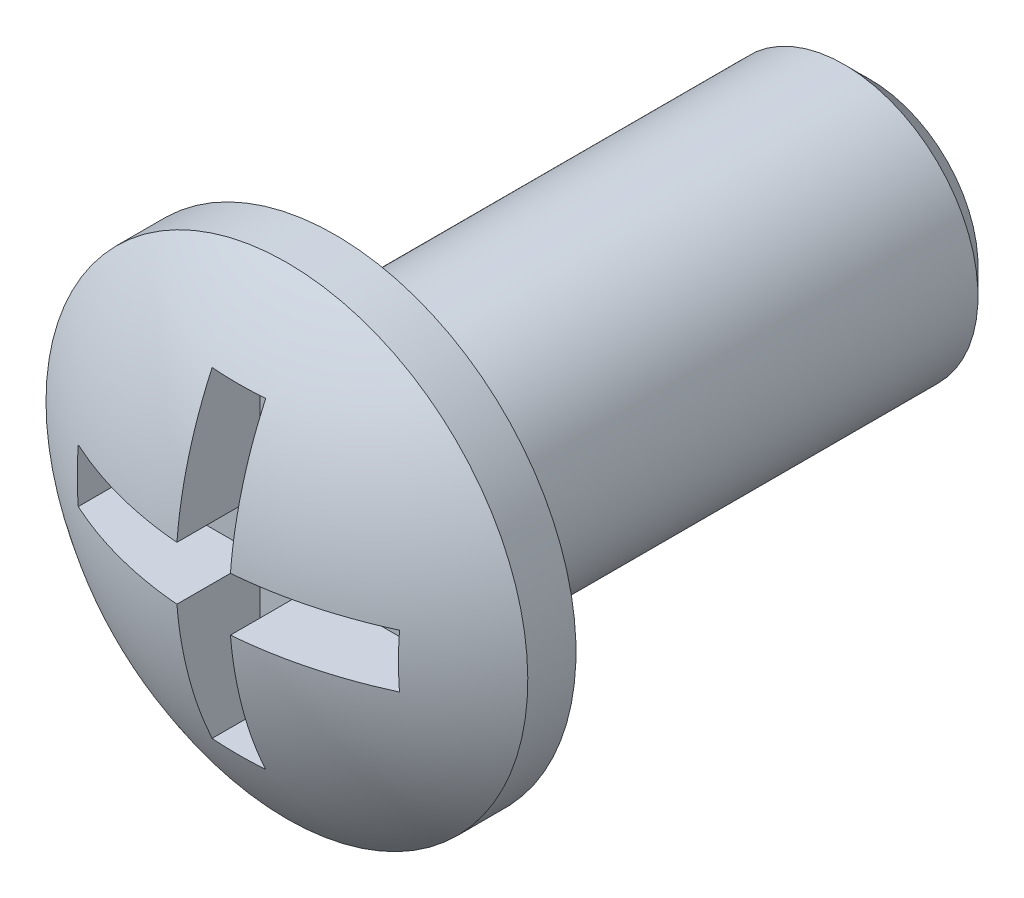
ISO-10303-21;
HEADER;
FILE_DESCRIPTION(('STEP AP214'),'2;1');
FILE_NAME('part.step','',(''),(''),'','','');
FILE_SCHEMA(('AUTOMOTIVE_DESIGN { 1 0 10303 214 1 1 1 1 }'));
ENDSEC;
DATA;
#1=APPLICATION_CONTEXT('core data for automotive mechanical design processes');
#2=APPLICATION_PROTOCOL_DEFINITION('international standard','automotive_design',2000,#1);
#3=PRODUCT_CONTEXT('',#1,'mechanical');
#4=PRODUCT('Part','Part','',(#3));
#5=PRODUCT_RELATED_PRODUCT_CATEGORY('part','',(#4));
#6=PRODUCT_DEFINITION_FORMATION('','',#4);
#7=PRODUCT_DEFINITION_CONTEXT('part definition',#1,'design');
#8=PRODUCT_DEFINITION('design','',#6,#7);
#9=PRODUCT_DEFINITION_SHAPE('','',#8);
#10=(LENGTH_UNIT() NAMED_UNIT(*) SI_UNIT(.MILLI.,.METRE.));
#11=(NAMED_UNIT(*) PLANE_ANGLE_UNIT() SI_UNIT($,.RADIAN.));
#12=(NAMED_UNIT(*) SI_UNIT($,.STERADIAN.) SOLID_ANGLE_UNIT());
#13=UNCERTAINTY_MEASURE_WITH_UNIT(LENGTH_MEASURE(1.E-05),#10,'distance_accuracy_value','');
#14=(GEOMETRIC_REPRESENTATION_CONTEXT(3) GLOBAL_UNCERTAINTY_ASSIGNED_CONTEXT((#13)) GLOBAL_UNIT_ASSIGNED_CONTEXT((#10,
#11,#12)) REPRESENTATION_CONTEXT('',''));
#15=CARTESIAN_POINT('',(0.,0.,0.));
#16=DIRECTION('',(0.,0.,1.));
#17=DIRECTION('',(1.,0.,0.));
#18=AXIS2_PLACEMENT_3D('',#15,#16,#17);
#19=CARTESIAN_POINT('',(0.,0.,-4.99884164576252));
#20=DIRECTION('',(0.,0.,-1.));
#21=DIRECTION('',(-1.,0.,0.));
#22=AXIS2_PLACEMENT_3D('',#19,#20,#21);
#23=DEGENERATE_TOROIDAL_SURFACE('',#22,0.131810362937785,7.5,.F.);
#24=CARTESIAN_POINT('',(-0.5,1.89136823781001,2.20460335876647));
#25=CARTESIAN_POINT('',(-0.5,1.73691918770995,2.24789274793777));
#26=CARTESIAN_POINT('',(-0.5,1.58112605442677,2.28617320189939));
#27=CARTESIAN_POINT('',(-0.5,1.26732228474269,2.35257632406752));
#28=CARTESIAN_POINT('',(-0.5,1.10931136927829,2.38069770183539));
#29=CARTESIAN_POINT('',(-0.5,0.87128084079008,2.41501493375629));
#30=CARTESIAN_POINT('',(-0.5,0.791806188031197,2.42514026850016));
#31=CARTESIAN_POINT('',(-0.5,0.63255568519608,2.44271088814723));
#32=CARTESIAN_POINT('',(-0.5,0.552779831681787,2.4501561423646));
#33=CARTESIAN_POINT('',(-0.5,0.393036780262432,2.46223173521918));
#34=CARTESIAN_POINT('',(-0.5,0.31306964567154,2.46686290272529));
#35=CARTESIAN_POINT('',(-0.5,0.153020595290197,2.4730428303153));
#36=CARTESIAN_POINT('',(-0.5,0.0729386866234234,2.47459177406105));
#37=CARTESIAN_POINT('',(-0.5,-0.204163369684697,2.47425472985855));
#38=CARTESIAN_POINT('',(-0.5,-0.401208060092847,2.46405183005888));
#39=CARTESIAN_POINT('',(-0.5,-0.793793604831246,2.42721784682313));
#40=CARTESIAN_POINT('',(-0.5,-0.989333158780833,2.40057388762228));
#41=CARTESIAN_POINT('',(-0.5,-1.37809163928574,2.33167199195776));
#42=CARTESIAN_POINT('',(-0.5,-1.57130464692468,2.28938048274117));
#43=CARTESIAN_POINT('',(-0.5,-1.95367493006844,2.18957838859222));
#44=CARTESIAN_POINT('',(-0.5,-2.14283368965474,2.13207347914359));
#45=CARTESIAN_POINT('',(-0.5,-2.51749104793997,2.00172697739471));
#46=CARTESIAN_POINT('',(-0.5,-2.70294825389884,1.92876636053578));
#47=CARTESIAN_POINT('',(-0.5,-3.06746501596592,1.76826052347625));
#48=CARTESIAN_POINT('',(-0.5,-3.24652382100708,1.68071359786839));
#49=CARTESIAN_POINT('',(-0.5,-3.59685334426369,1.4917307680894));
#50=CARTESIAN_POINT('',(-0.5,-3.76813395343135,1.39031320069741));
#51=CARTESIAN_POINT('',(-0.5,-4.10212755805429,1.17411312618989));
#52=CARTESIAN_POINT('',(-0.5,-4.26483738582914,1.05932572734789));
#53=CARTESIAN_POINT('',(-0.5,-4.58940518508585,0.810383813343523));
#54=CARTESIAN_POINT('',(-0.5,-4.75070918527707,0.675506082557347));
#55=CARTESIAN_POINT('',(-0.5,-5.0614544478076,0.392603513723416));
#56=CARTESIAN_POINT('',(-0.5,-5.21089107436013,0.244573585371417));
#57=CARTESIAN_POINT('',(-0.5,-5.49682552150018,-0.0635933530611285));
#58=CARTESIAN_POINT('',(-0.5,-5.6333187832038,-0.223734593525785));
#59=CARTESIAN_POINT('',(-0.5,-5.89234041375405,-0.554943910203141));
#60=CARTESIAN_POINT('',(-0.5,-6.01486847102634,-0.726012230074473));
#61=CARTESIAN_POINT('',(-0.5,-6.24514992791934,-1.07795418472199));
#62=CARTESIAN_POINT('',(-0.5,-6.35289518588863,-1.2588331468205));
#63=CARTESIAN_POINT('',(-0.5,-6.55276818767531,-1.62902875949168));
#64=CARTESIAN_POINT('',(-0.5,-6.64489556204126,-1.81834560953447));
#65=CARTESIAN_POINT('',(-0.5,-6.81286215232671,-2.2040375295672));
#66=CARTESIAN_POINT('',(-0.5,-6.88870386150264,-2.40041151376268));
#67=CARTESIAN_POINT('',(-0.5,-7.02357817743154,-2.79884949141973));
#68=CARTESIAN_POINT('',(-0.5,-7.08261078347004,-3.00091348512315));
#69=CARTESIAN_POINT('',(-0.5,-7.18345744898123,-3.40933582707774));
#70=CARTESIAN_POINT('',(-0.5,-7.2252681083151,-3.61569501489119));
#71=CARTESIAN_POINT('',(-0.5,-7.29135627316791,-4.0311977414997));
#72=CARTESIAN_POINT('',(-0.5,-7.31563413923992,-4.24034122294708));
#73=CARTESIAN_POINT('',(-0.5,-7.34648599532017,-4.65993561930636));
#74=CARTESIAN_POINT('',(-0.5,-7.35305950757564,-4.87038656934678));
#75=CARTESIAN_POINT('',(-0.5,-7.34845461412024,-5.29108973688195));
#76=CARTESIAN_POINT('',(-0.5,-7.33727657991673,-5.50134195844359));
#77=CARTESIAN_POINT('',(-0.5,-7.29724556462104,-5.92019047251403));
#78=CARTESIAN_POINT('',(-0.5,-7.26838980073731,-6.12878649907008));
#79=CARTESIAN_POINT('',(-0.5,-7.19321909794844,-6.54273396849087));
#80=CARTESIAN_POINT('',(-0.5,-7.14691020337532,-6.7480865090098));
#81=CARTESIAN_POINT('',(-0.5,-7.03714568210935,-7.15421941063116));
#82=CARTESIAN_POINT('',(-0.5,-6.97368518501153,-7.35499845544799));
#83=CARTESIAN_POINT('',(-0.5,-6.83007610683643,-7.75049164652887));
#84=CARTESIAN_POINT('',(-0.5,-6.74992791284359,-7.9452059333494));
#85=CARTESIAN_POINT('',(-0.5,-6.57350092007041,-8.3272144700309));
#86=CARTESIAN_POINT('',(-0.5,-6.47722005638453,-8.51450776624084));
#87=CARTESIAN_POINT('',(-0.5,-6.26922107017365,-8.8803128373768));
#88=CARTESIAN_POINT('',(-0.5,-6.15750319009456,-9.05882475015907));
#89=CARTESIAN_POINT('',(-0.5,-5.91943978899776,-9.40577629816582));
#90=CARTESIAN_POINT('',(-0.5,-5.79309630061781,-9.57421732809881));
#91=CARTESIAN_POINT('',(-0.5,-5.52671645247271,-9.89979572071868));
#92=CARTESIAN_POINT('',(-0.5,-5.38668517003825,-10.0569372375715));
#93=CARTESIAN_POINT('',(-0.5,-5.09390547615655,-10.3588469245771));
#94=CARTESIAN_POINT('',(-0.5,-4.94115884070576,-10.5036168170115));
#95=CARTESIAN_POINT('',(-0.5,-4.62401325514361,-10.7797807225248));
#96=CARTESIAN_POINT('',(-0.5,-4.45961409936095,-10.9111744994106));
#97=CARTESIAN_POINT('',(-0.5,-4.12018509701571,-11.1597561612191));
#98=CARTESIAN_POINT('',(-0.5,-3.94514613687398,-11.2769316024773));
#99=CARTESIAN_POINT('',(-0.5,-3.58581999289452,-11.4961015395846));
#100=CARTESIAN_POINT('',(-0.5,-3.40153321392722,-11.5980966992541));
#101=CARTESIAN_POINT('',(-0.5,-3.02500917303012,-11.7861822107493));
#102=CARTESIAN_POINT('',(-0.5,-2.83277181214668,-11.872272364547));
#103=CARTESIAN_POINT('',(-0.5,-2.44170629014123,-12.0279258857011));
#104=CARTESIAN_POINT('',(-0.5,-2.24287752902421,-12.0974877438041));
#105=CARTESIAN_POINT('',(-0.5,-1.84028876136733,-12.2194769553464));
#106=CARTESIAN_POINT('',(-0.5,-1.63653567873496,-12.2719270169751));
#107=CARTESIAN_POINT('',(-0.5,-1.32817997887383,-12.3374789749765));
#108=CARTESIAN_POINT('',(-0.5,-1.22493147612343,-12.3571435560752));
#109=CARTESIAN_POINT('',(-0.5,-1.01767016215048,-12.3920353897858));
#110=CARTESIAN_POINT('',(-0.5,-0.913657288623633,-12.4072622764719));
#111=CARTESIAN_POINT('',(-0.5,-0.70520976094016,-12.4331474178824));
#112=CARTESIAN_POINT('',(-0.5,-0.600775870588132,-12.4438118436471));
#113=CARTESIAN_POINT('',(-0.5,-0.39153202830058,-12.4603485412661));
#114=CARTESIAN_POINT('',(-0.5,-0.286722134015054,-12.4662215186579));
#115=CARTESIAN_POINT('',(-0.5,-0.129398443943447,-12.470995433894));
#116=CARTESIAN_POINT('',(-0.5,-0.0769416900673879,-12.4719142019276));
#117=CARTESIAN_POINT('',(-0.5,0.0279775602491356,-12.4723484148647));
#118=CARTESIAN_POINT('',(-0.5,0.0804400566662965,-12.4718638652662));
#119=CARTESIAN_POINT('',(-0.5,0.237787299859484,-12.468354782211));
#120=CARTESIAN_POINT('',(-0.5,0.342630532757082,-12.4632747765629));
#121=CARTESIAN_POINT('',(-0.5,0.551962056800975,-12.4482538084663));
#122=CARTESIAN_POINT('',(-0.5,0.656450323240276,-12.4383125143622));
#123=CARTESIAN_POINT('',(-0.5,0.864891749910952,-12.4138698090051));
#124=CARTESIAN_POINT('',(-0.5,0.968844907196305,-12.3993683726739));
#125=CARTESIAN_POINT('',(-0.5,1.17607758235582,-12.3659164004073));
#126=CARTESIAN_POINT('',(-0.5,1.27935680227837,-12.3469640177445));
#127=CARTESIAN_POINT('',(-0.5,1.48500658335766,-12.304690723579));
#128=CARTESIAN_POINT('',(-0.5,1.58737718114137,-12.2813699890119));
#129=CARTESIAN_POINT('',(-0.5,1.87475761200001,-12.2094703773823));
#130=CARTESIAN_POINT('',(-0.5,2.05854104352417,-12.1558845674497));
#131=CARTESIAN_POINT('',(-0.5,2.42136247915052,-12.0347845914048));
#132=CARTESIAN_POINT('',(-0.5,2.60040220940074,-11.9672755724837));
#133=CARTESIAN_POINT('',(-0.5,2.95276912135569,-11.8187301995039));
#134=CARTESIAN_POINT('',(-0.5,3.12609675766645,-11.7376949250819));
#135=CARTESIAN_POINT('',(-0.5,3.46605933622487,-11.5625656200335));
#136=CARTESIAN_POINT('',(-0.5,3.63269300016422,-11.4684691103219));
#137=CARTESIAN_POINT('',(-0.5,3.97418575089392,-11.2579642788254));
#138=CARTESIAN_POINT('',(-0.5,4.14825658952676,-11.1402740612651));
#139=CARTESIAN_POINT('',(-0.5,4.48588330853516,-10.8906725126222));
#140=CARTESIAN_POINT('',(-0.5,4.64943898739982,-10.7587609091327));
#141=CARTESIAN_POINT('',(-0.5,4.96487708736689,-10.4816542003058));
#142=CARTESIAN_POINT('',(-0.5,5.11675974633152,-10.3364593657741));
#143=CARTESIAN_POINT('',(-0.5,5.40783304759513,-10.0337577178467));
#144=CARTESIAN_POINT('',(-0.5,5.54701896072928,-9.87624635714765));
#145=CARTESIAN_POINT('',(-0.5,5.81181801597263,-9.5498680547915));
#146=CARTESIAN_POINT('',(-0.5,5.93741370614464,-9.38098695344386));
#147=CARTESIAN_POINT('',(-0.5,6.1739810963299,-9.03318380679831));
#148=CARTESIAN_POINT('',(-0.5,6.28494737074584,-8.85425807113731));
#149=CARTESIAN_POINT('',(-0.5,6.49137670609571,-8.48775892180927));
#150=CARTESIAN_POINT('',(-0.5,6.58684516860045,-8.30018855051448));
#151=CARTESIAN_POINT('',(-0.5,6.76168016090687,-7.91760393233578));
#152=CARTESIAN_POINT('',(-0.5,6.84104072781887,-7.72258696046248));
#153=CARTESIAN_POINT('',(-0.5,6.98303895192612,-7.32659635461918));
#154=CARTESIAN_POINT('',(-0.5,7.04567959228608,-7.12562379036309));
#155=CARTESIAN_POINT('',(-0.5,7.15383188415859,-6.71904070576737));
#156=CARTESIAN_POINT('',(-0.5,7.19933711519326,-6.51342847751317));
#157=CARTESIAN_POINT('',(-0.5,7.27284620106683,-6.0991898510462));
#158=CARTESIAN_POINT('',(-0.5,7.30085753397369,-5.89056477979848));
#159=CARTESIAN_POINT('',(-0.5,7.33921925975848,-5.47160171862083));
#160=CARTESIAN_POINT('',(-0.5,7.34956164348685,-5.26126299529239));
#161=CARTESIAN_POINT('',(-0.5,7.35248727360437,-4.84044887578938));
#162=CARTESIAN_POINT('',(-0.5,7.34506940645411,-4.62997347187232));
#163=CARTESIAN_POINT('',(-0.5,7.31253237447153,-4.210491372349));
#164=CARTESIAN_POINT('',(-0.5,7.28742122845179,-4.00148405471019));
#165=CARTESIAN_POINT('',(-0.5,7.21967151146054,-3.5862462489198));
#166=CARTESIAN_POINT('',(-0.5,7.17702613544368,-3.38001687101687));
#167=CARTESIAN_POINT('',(-0.5,7.07452995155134,-2.97196112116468));
#168=CARTESIAN_POINT('',(-0.5,7.01468558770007,-2.77013313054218));
#169=CARTESIAN_POINT('',(-0.5,6.87818892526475,-2.37217254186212));
#170=CARTESIAN_POINT('',(-0.5,6.80153138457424,-2.17604174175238));
#171=CARTESIAN_POINT('',(-0.5,6.63199557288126,-1.79100738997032));
#172=CARTESIAN_POINT('',(-0.5,6.53912330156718,-1.60210119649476));
#173=CARTESIAN_POINT('',(-0.5,6.33774615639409,-1.23268630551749));
#174=CARTESIAN_POINT('',(-0.5,6.2292332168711,-1.05218200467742));
#175=CARTESIAN_POINT('',(-0.5,5.99742541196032,-0.701024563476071));
#176=CARTESIAN_POINT('',(-0.5,5.87413600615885,-0.530367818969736));
#177=CARTESIAN_POINT('',(-0.5,5.61354733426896,-0.199956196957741));
#178=CARTESIAN_POINT('',(-0.5,5.47624045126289,-0.0402073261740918));
#179=CARTESIAN_POINT('',(-0.5,5.18870424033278,0.267092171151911));
#180=CARTESIAN_POINT('',(-0.5,5.03847956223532,0.414647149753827));
#181=CARTESIAN_POINT('',(-0.5,4.72617612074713,0.696528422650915));
#182=CARTESIAN_POINT('',(-0.5,4.56410151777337,0.830859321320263));
#183=CARTESIAN_POINT('',(-0.5,4.22926476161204,1.08536116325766));
#184=CARTESIAN_POINT('',(-0.5,4.05650377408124,1.20553364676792));
#185=CARTESIAN_POINT('',(-0.5,3.5717460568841,1.51320601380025));
#186=CARTESIAN_POINT('',(-0.5,3.25014766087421,1.68583785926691));
#187=CARTESIAN_POINT('',(-0.5,2.58512980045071,1.98244353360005));
#188=CARTESIAN_POINT('',(-0.5,2.24170683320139,2.10640952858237));
#189=CARTESIAN_POINT('',(-0.5,1.89136823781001,2.20460335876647));
#190=B_SPLINE_CURVE_WITH_KNOTS('',3,(#24,#25,#26,#27,#28,#29,#30,#31,#32,#33,#34,#35,#36,#37,
#38,#39,#40,#41,#42,#43,#44,#45,#46,#47,#48,#49,#50,#51,#52,#53,#54,#55,#56,#57,#58,#59,#60,#61,
#62,#63,#64,#65,#66,#67,#68,#69,#70,#71,#72,#73,#74,#75,#76,#77,#78,#79,#80,#81,#82,#83,#84,#85,
#86,#87,#88,#89,#90,#91,#92,#93,#94,#95,#96,#97,#98,#99,#100,#101,#102,#103,#104,#105,#106,#107,
#108,#109,#110,#111,#112,#113,#114,#115,#116,#117,#118,#119,#120,#121,#122,#123,#124,#125,#126,
#127,#128,#129,#130,#131,#132,#133,#134,#135,#136,#137,#138,#139,#140,#141,#142,#143,#144,#145,
#146,#147,#148,#149,#150,#151,#152,#153,#154,#155,#156,#157,#158,#159,#160,#161,#162,#163,#164,
#165,#166,#167,#168,#169,#170,#171,#172,#173,#174,#175,#176,#177,#178,#179,#180,#181,#182,#183,
#184,#185,#186,#187,#188,#189),.UNSPECIFIED.,.T.,.F.,(4,2,2,2,2,2,2,2,2,2,2,2,2,2,2,2,2,2,2,2,2,
2,2,2,2,2,2,2,2,2,2,2,2,2,2,2,2,2,2,2,2,2,2,2,2,2,2,2,2,2,2,2,2,2,2,2,2,2,2,2,2,2,2,2,2,2,2,2,2,
2,2,2,2,2,2,2,2,2,2,2,2,2,4),(0.,0.481026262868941,0.962113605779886,1.20242973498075,
1.44274861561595,1.6829966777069,1.92323042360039,2.51421096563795,3.10565492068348,
3.69837528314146,4.29087483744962,4.88811485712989,5.48542475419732,6.08195251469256,
6.67869922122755,7.30873867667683,7.93902304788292,8.56952859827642,9.20004821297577,
9.83091370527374,10.4617941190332,11.0925778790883,11.7233616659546,12.3542699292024,
12.9851652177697,13.6160775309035,14.2469766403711,14.8779750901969,15.5087552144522,
16.1397146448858,16.7706594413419,17.4016850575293,18.0327007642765,18.6636288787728,
19.2943238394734,19.9249308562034,20.5555490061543,21.1867151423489,21.8178536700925,
22.4490000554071,23.0802040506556,23.7105669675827,24.0258022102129,24.3410634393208,
24.6558968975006,24.9706839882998,25.1280618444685,25.285439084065,25.6001973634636,
25.9149771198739,26.2297586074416,26.5446709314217,26.8595705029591,27.4332648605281,
28.0067475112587,28.5801844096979,29.1537302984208,29.7833423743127,30.412966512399,
31.0425778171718,31.672422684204,32.303067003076,32.9339445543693,33.5646017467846,
34.1954919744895,34.8262695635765,35.4572832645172,36.088027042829,36.7190566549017,
37.350125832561,37.9809091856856,38.6119375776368,39.2427298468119,39.8737190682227,
40.50447530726,41.1355579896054,41.7664082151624,42.3976030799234,43.0285716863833,
43.6593198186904,44.2899992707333,45.3809412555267,46.4720587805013),.UNSPECIFIED.);
#191=CARTESIAN_POINT('',(-0.5,3.,1.79680805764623));
#192=VERTEX_POINT('',#191);
#193=CARTESIAN_POINT('',(-0.5,0.5,2.45409187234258));
#194=VERTEX_POINT('',#193);
#195=EDGE_CURVE('E222',#192,#194,#190,.T.);
#196=ORIENTED_EDGE('',*,*,#195,.F.);
#197=CARTESIAN_POINT('',(0.,3.,1.81597778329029));
#198=CARTESIAN_POINT('',(-0.184471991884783,3.,1.81598023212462));
#199=CARTESIAN_POINT('',(-0.368918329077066,3.,1.8081521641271));
#200=CARTESIAN_POINT('',(-0.73654837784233,3.,1.77693869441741));
#201=CARTESIAN_POINT('',(-0.919731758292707,3.,1.75354935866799));
#202=CARTESIAN_POINT('',(-1.28365608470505,3.,1.6914446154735));
#203=CARTESIAN_POINT('',(-1.46439451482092,3.,1.65271450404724));
#204=CARTESIAN_POINT('',(-1.82207836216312,3.,1.56030539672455));
#205=CARTESIAN_POINT('',(-1.99902232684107,3.,1.50662078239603));
#206=CARTESIAN_POINT('',(-2.34823153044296,3.,1.38465889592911));
#207=CARTESIAN_POINT('',(-2.52048589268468,3.,1.31635049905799));
#208=CARTESIAN_POINT('',(-2.85883551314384,3.,1.16573808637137));
#209=CARTESIAN_POINT('',(-3.02492851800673,3.,1.08342901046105));
#210=CARTESIAN_POINT('',(-3.34970399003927,3.,0.905504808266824));
#211=CARTESIAN_POINT('',(-3.50839058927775,3.,0.809897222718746));
#212=CARTESIAN_POINT('',(-3.81747130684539,3.,0.605991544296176));
#213=CARTESIAN_POINT('',(-3.96786232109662,3.,0.497688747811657));
#214=CARTESIAN_POINT('',(-4.26292608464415,3.,0.26633747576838));
#215=CARTESIAN_POINT('',(-4.4073643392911,3.,0.142989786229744));
#216=CARTESIAN_POINT('',(-4.68549551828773,3.,-0.115374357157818));
#217=CARTESIAN_POINT('',(-4.81918440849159,3.,-0.250395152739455));
#218=CARTESIAN_POINT('',(-5.07480762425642,3.,-0.531071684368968));
#219=CARTESIAN_POINT('',(-5.19674515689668,3.,-0.676724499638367));
#220=CARTESIAN_POINT('',(-5.42811503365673,3.,-0.977729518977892));
#221=CARTESIAN_POINT('',(-5.53754272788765,3.,-1.13308529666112));
#222=CARTESIAN_POINT('',(-5.74411794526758,3.,-1.4539584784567));
#223=CARTESIAN_POINT('',(-5.84113208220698,3.,-1.61956178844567));
#224=CARTESIAN_POINT('',(-6.02094235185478,3.,-1.95838823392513));
#225=CARTESIAN_POINT('',(-6.10373318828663,3.,-2.13161417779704));
#226=CARTESIAN_POINT('',(-6.25444947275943,3.,-2.48436536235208));
#227=CARTESIAN_POINT('',(-6.32238003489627,3.,-2.66388841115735));
#228=CARTESIAN_POINT('',(-6.44295628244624,3.,-3.02799644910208));
#229=CARTESIAN_POINT('',(-6.49559632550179,3.,-3.21258327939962));
#230=CARTESIAN_POINT('',(-6.63019388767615,3.,-3.7731841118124));
#231=CARTESIAN_POINT('',(-6.68850918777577,3.,-4.15528941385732));
#232=CARTESIAN_POINT('',(-6.72728676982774,3.,-4.73111824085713));
#233=CARTESIAN_POINT('',(-6.73208802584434,3.,-4.92359250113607));
#234=CARTESIAN_POINT('',(-6.72551208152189,3.,-5.30826437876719));
#235=CARTESIAN_POINT('',(-6.71413488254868,3.,-5.50046199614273));
#236=CARTESIAN_POINT('',(-6.65566320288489,3.,-6.07496503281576));
#237=CARTESIAN_POINT('',(-6.58422895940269,3.,-6.45518543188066));
#238=CARTESIAN_POINT('',(-6.43016209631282,3.,-7.0119130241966));
#239=CARTESIAN_POINT('',(-6.37094246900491,3.,-7.19531725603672));
#240=CARTESIAN_POINT('',(-6.23726688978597,3.,-7.55648623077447));
#241=CARTESIAN_POINT('',(-6.16281657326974,3.,-7.73425303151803));
#242=CARTESIAN_POINT('',(-5.99918924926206,3.,-8.08287452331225));
#243=CARTESIAN_POINT('',(-5.91001085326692,3.,-8.25372856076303));
#244=CARTESIAN_POINT('',(-5.71759441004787,3.,-8.58724840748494));
#245=CARTESIAN_POINT('',(-5.61436159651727,3.,-8.74991723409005));
#246=CARTESIAN_POINT('',(-5.3944987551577,3.,-9.06601905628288));
#247=CARTESIAN_POINT('',(-5.27786397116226,3.,-9.21944874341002));
#248=CARTESIAN_POINT('',(-5.03209410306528,3.,-9.51585056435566));
#249=CARTESIAN_POINT('',(-4.90296371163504,3.,-9.65882658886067));
#250=CARTESIAN_POINT('',(-4.63327132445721,3.,-9.93314797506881));
#251=CARTESIAN_POINT('',(-4.49272622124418,3.,-10.0645099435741));
#252=CARTESIAN_POINT('',(-4.20108377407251,3.,-10.3148296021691));
#253=CARTESIAN_POINT('',(-4.04999043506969,3.,-10.4337919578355));
#254=CARTESIAN_POINT('',(-3.738190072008,3.,-10.6585407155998));
#255=CARTESIAN_POINT('',(-3.57747842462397,3.,-10.7643207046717));
#256=CARTESIAN_POINT('',(-3.24770353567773,3.,-10.9617928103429));
#257=CARTESIAN_POINT('',(-3.07864354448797,3.,-11.0534903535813));
#258=CARTESIAN_POINT('',(-2.73426802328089,3.,-11.2216507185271));
#259=CARTESIAN_POINT('',(-2.55899235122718,3.,-11.29819514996));
#260=CARTESIAN_POINT('',(-2.20261322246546,3.,-11.4360120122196));
#261=CARTESIAN_POINT('',(-2.02151211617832,3.,-11.4972905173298));
#262=CARTESIAN_POINT('',(-1.65468913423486,3.,-11.6040576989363));
#263=CARTESIAN_POINT('',(-1.46896676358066,3.,-11.6495446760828));
#264=CARTESIAN_POINT('',(-1.09434719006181,3.,-11.7242321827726));
#265=CARTESIAN_POINT('',(-0.905451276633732,3.,-11.7534391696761));
#266=CARTESIAN_POINT('',(-0.529570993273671,3.,-11.7948367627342));
#267=CARTESIAN_POINT('',(-0.342622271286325,3.,-11.8073512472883));
#268=CARTESIAN_POINT('',(0.0316579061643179,3.,-11.816267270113));
#269=CARTESIAN_POINT('',(0.218989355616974,3.,-11.8126690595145));
#270=CARTESIAN_POINT('',(0.592618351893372,3.,-11.7894083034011));
#271=CARTESIAN_POINT('',(0.778916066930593,3.,-11.7697484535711));
#272=CARTESIAN_POINT('',(1.14921954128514,3.,-11.714595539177));
#273=CARTESIAN_POINT('',(1.3332244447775,3.,-11.6790967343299));
#274=CARTESIAN_POINT('',(1.69451800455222,3.,-11.5933702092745));
#275=CARTESIAN_POINT('',(1.87186750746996,3.,-11.5433984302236));
#276=CARTESIAN_POINT('',(2.22189230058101,3.,-11.4289525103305));
#277=CARTESIAN_POINT('',(2.39456588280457,3.,-11.3644731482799));
#278=CARTESIAN_POINT('',(2.73398544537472,3.,-11.2215723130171));
#279=CARTESIAN_POINT('',(2.90073304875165,3.,-11.1431546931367));
#280=CARTESIAN_POINT('',(3.22732354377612,3.,-10.9729295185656));
#281=CARTESIAN_POINT('',(3.38716383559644,3.,-10.8811169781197));
#282=CARTESIAN_POINT('',(3.70255261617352,3.,-10.682443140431));
#283=CARTESIAN_POINT('',(3.8579082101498,3.,-10.575275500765));
#284=CARTESIAN_POINT('',(4.15922852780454,3.,-10.3483575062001));
#285=CARTESIAN_POINT('',(4.30518974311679,3.,-10.2286024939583));
#286=CARTESIAN_POINT('',(4.58662401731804,3.,-9.97743697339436));
#287=CARTESIAN_POINT('',(4.72210061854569,3.,-9.8460304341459));
#288=CARTESIAN_POINT('',(4.9817523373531,3.,-9.57239891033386));
#289=CARTESIAN_POINT('',(5.10592324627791,3.,-9.43016993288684));
#290=CARTESIAN_POINT('',(5.34377158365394,3.,-9.13380015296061));
#291=CARTESIAN_POINT('',(5.45727196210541,3.,-8.97951720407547));
#292=CARTESIAN_POINT('',(5.67097045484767,3.,-8.66191981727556));
#293=CARTESIAN_POINT('',(5.77116359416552,3.,-8.49860203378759));
#294=CARTESIAN_POINT('',(5.95747373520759,3.,-8.16418129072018));
#295=CARTESIAN_POINT('',(6.0435952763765,3.,-7.99308086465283));
#296=CARTESIAN_POINT('',(6.20122117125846,3.,-7.64424832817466));
#297=CARTESIAN_POINT('',(6.27272003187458,3.,-7.46651375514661));
#298=CARTESIAN_POINT('',(6.4649889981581,3.,-6.92373364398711));
#299=CARTESIAN_POINT('',(6.56287413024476,3.,-6.55029351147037));
#300=CARTESIAN_POINT('',(6.69456122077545,3.,-5.79228095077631));
#301=CARTESIAN_POINT('',(6.72836285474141,3.,-5.40770846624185));
#302=CARTESIAN_POINT('',(6.7304555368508,3.,-4.83074135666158));
#303=CARTESIAN_POINT('',(6.72301259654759,3.,-4.63816594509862));
#304=CARTESIAN_POINT('',(6.69194077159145,3.,-4.25434986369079));
#305=CARTESIAN_POINT('',(6.66831792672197,3.,-4.06310872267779));
#306=CARTESIAN_POINT('',(6.60503632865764,3.,-3.68323579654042));
#307=CARTESIAN_POINT('',(6.56537146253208,3.,-3.49460503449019));
#308=CARTESIAN_POINT('',(6.47030558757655,3.,-3.12142244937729));
#309=CARTESIAN_POINT('',(6.41491040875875,3.,-2.93686914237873));
#310=CARTESIAN_POINT('',(6.28873885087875,3.,-2.57300525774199));
#311=CARTESIAN_POINT('',(6.21795558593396,3.,-2.39369706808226));
#312=CARTESIAN_POINT('',(6.06155038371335,3.,-2.04175282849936));
#313=CARTESIAN_POINT('',(5.97593395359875,3.,-1.86911433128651));
#314=CARTESIAN_POINT('',(5.79041704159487,3.,-1.53161753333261));
#315=CARTESIAN_POINT('',(5.69051193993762,3.,-1.36676177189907));
#316=CARTESIAN_POINT('',(5.47718214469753,3.,-1.04613127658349));
#317=CARTESIAN_POINT('',(5.36376250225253,3.,-0.89035318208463));
#318=CARTESIAN_POINT('',(5.12428587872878,3.,-0.589074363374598));
#319=CARTESIAN_POINT('',(4.99824095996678,3.,-0.443564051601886));
#320=CARTESIAN_POINT('',(4.73435973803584,3.,-0.163762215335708));
#321=CARTESIAN_POINT('',(4.59652787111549,3.,-0.0294665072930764));
#322=CARTESIAN_POINT('',(4.3099025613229,3.,0.227075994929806));
#323=CARTESIAN_POINT('',(4.16110170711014,3.,0.349314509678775));
#324=CARTESIAN_POINT('',(3.85372747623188,3.,0.580689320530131));
#325=CARTESIAN_POINT('',(3.6951578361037,3.,0.689830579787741));
#326=CARTESIAN_POINT('',(3.36983579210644,3.,0.893909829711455));
#327=CARTESIAN_POINT('',(3.2031112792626,3.,0.988892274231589));
#328=CARTESIAN_POINT('',(2.86225052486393,3.,1.16429536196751));
#329=CARTESIAN_POINT('',(2.68811716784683,3.,1.2447216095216));
#330=CARTESIAN_POINT('',(2.33378145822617,3.,1.3903204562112));
#331=CARTESIAN_POINT('',(2.15358529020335,3.,1.45550809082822));
#332=CARTESIAN_POINT('',(1.78831683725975,3.,1.57012713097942));
#333=CARTESIAN_POINT('',(1.60324599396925,3.,1.61956313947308));
#334=CARTESIAN_POINT('',(1.18403936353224,3.,1.71225597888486));
#335=CARTESIAN_POINT('',(0.948911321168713,3.,1.75109043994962));
#336=CARTESIAN_POINT('',(0.475841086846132,3.,1.80294833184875));
#337=CARTESIAN_POINT('',(0.237899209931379,3.,1.81597462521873));
#338=CARTESIAN_POINT('',(0.,3.,1.81597778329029));
#339=B_SPLINE_CURVE_WITH_KNOTS('',3,(#197,#198,#199,#200,#201,#202,#203,#204,#205,#206,#207,
#208,#209,#210,#211,#212,#213,#214,#215,#216,#217,#218,#219,#220,#221,#222,#223,#224,#225,#226,
#227,#228,#229,#230,#231,#232,#233,#234,#235,#236,#237,#238,#239,#240,#241,#242,#243,#244,#245,
#246,#247,#248,#249,#250,#251,#252,#253,#254,#255,#256,#257,#258,#259,#260,#261,#262,#263,#264,
#265,#266,#267,#268,#269,#270,#271,#272,#273,#274,#275,#276,#277,#278,#279,#280,#281,#282,#283,
#284,#285,#286,#287,#288,#289,#290,#291,#292,#293,#294,#295,#296,#297,#298,#299,#300,#301,#302,
#303,#304,#305,#306,#307,#308,#309,#310,#311,#312,#313,#314,#315,#316,#317,#318,#319,#320,#321,
#322,#323,#324,#325,#326,#327,#328,#329,#330,#331,#332,#333,#334,#335,#336,#337,#338),
.UNSPECIFIED.,.T.,.F.,(4,2,2,2,2,2,2,2,2,2,2,2,2,2,2,2,2,2,2,2,2,2,2,2,2,2,2,2,2,2,2,2,2,2,2,2,
2,2,2,2,2,2,2,2,2,2,2,2,2,2,2,2,2,2,2,2,2,2,2,2,2,2,2,2,2,2,2,2,2,2,4),(0.,0.553206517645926,
1.10655294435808,1.66043103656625,2.2145175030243,2.76979520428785,3.32527402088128,
3.88043913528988,4.43581059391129,5.00496306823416,5.57432815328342,6.14353740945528,
6.7129575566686,7.28805780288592,7.86337173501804,8.43848736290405,9.01381494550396,
10.1668840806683,10.7439320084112,11.3209798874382,12.4750614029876,13.0527275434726,
13.6301803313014,14.2076875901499,14.7849803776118,15.3624786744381,15.9397609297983,
16.5162039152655,17.0924292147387,17.6689337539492,18.2452155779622,18.8183038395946,
19.3911637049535,19.9640851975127,20.5367792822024,21.0981916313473,21.6595952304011,
22.2209046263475,22.7824176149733,23.3345509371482,23.886883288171,24.4390631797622,
24.9914491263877,25.5569916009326,26.1227440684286,26.688304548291,27.2540747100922,
27.8279998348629,28.4021389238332,28.9760924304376,29.550261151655,30.70260425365,
31.8549531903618,32.4325385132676,33.0099083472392,33.5874983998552,34.1648746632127,
34.7425098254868,35.3199309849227,35.8975392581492,36.4749323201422,37.0517789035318,
37.6284093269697,38.2054329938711,38.782237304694,39.3571906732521,39.9319222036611,
40.506084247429,41.0800783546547,41.7935850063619,42.5070125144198),.UNSPECIFIED.);
#340=CARTESIAN_POINT('',(0.5,3.,1.79680805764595));
#341=VERTEX_POINT('',#340);
#342=EDGE_CURVE('E217',#341,#192,#339,.T.);
#343=ORIENTED_EDGE('',*,*,#342,.F.);
#344=CARTESIAN_POINT('',(0.5,1.89136823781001,2.20460335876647));
#345=CARTESIAN_POINT('',(0.5,2.05327843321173,2.15922673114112));
#346=CARTESIAN_POINT('',(0.5,2.21368214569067,2.10835905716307));
#347=CARTESIAN_POINT('',(0.5,2.53072474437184,1.99589718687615));
#348=CARTESIAN_POINT('',(0.5,2.68736237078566,1.93429945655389));
#349=CARTESIAN_POINT('',(0.5,2.9964086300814,1.80055175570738));
#350=CARTESIAN_POINT('',(0.5,3.14880912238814,1.72838294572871));
#351=CARTESIAN_POINT('',(0.5,3.44838883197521,1.57391250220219));
#352=CARTESIAN_POINT('',(0.5,3.59556768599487,1.49161016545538));
#353=CARTESIAN_POINT('',(0.5,3.91975274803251,1.29565416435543));
#354=CARTESIAN_POINT('',(0.5,4.09512516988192,1.17928267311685));
#355=CARTESIAN_POINT('',(0.5,4.43546383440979,0.932166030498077));
#356=CARTESIAN_POINT('',(0.5,4.60042828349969,0.801418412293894));
#357=CARTESIAN_POINT('',(0.5,4.91874562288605,0.526502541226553));
#358=CARTESIAN_POINT('',(0.5,5.07209954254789,0.382335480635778));
#359=CARTESIAN_POINT('',(0.5,5.36617171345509,0.0815447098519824));
#360=CARTESIAN_POINT('',(0.5,5.50688546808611,-0.0750833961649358));
#361=CARTESIAN_POINT('',(0.5,5.77456360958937,-0.399572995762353));
#362=CARTESIAN_POINT('',(0.5,5.90153346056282,-0.567429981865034));
#363=CARTESIAN_POINT('',(0.5,6.14093046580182,-0.91330390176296));
#364=CARTESIAN_POINT('',(0.5,6.25335224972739,-1.09132455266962));
#365=CARTESIAN_POINT('',(0.5,6.46277400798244,-1.4561594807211));
#366=CARTESIAN_POINT('',(0.5,6.55977770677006,-1.64297161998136));
#367=CARTESIAN_POINT('',(0.5,6.73770846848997,-2.02410485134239));
#368=CARTESIAN_POINT('',(0.5,6.81863528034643,-2.21842606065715));
#369=CARTESIAN_POINT('',(0.5,6.96385015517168,-2.61323365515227));
#370=CARTESIAN_POINT('',(0.5,7.02813485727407,-2.81372127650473));
#371=CARTESIAN_POINT('',(0.5,7.1395885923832,-3.21940387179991));
#372=CARTESIAN_POINT('',(0.5,7.18675722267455,-3.42459895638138));
#373=CARTESIAN_POINT('',(0.5,7.26363497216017,-3.83819815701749));
#374=CARTESIAN_POINT('',(0.5,7.29334704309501,-4.04660172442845));
#375=CARTESIAN_POINT('',(0.5,7.33512032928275,-4.46524442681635));
#376=CARTESIAN_POINT('',(0.5,7.34717534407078,-4.6754841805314));
#377=CARTESIAN_POINT('',(0.5,7.35352793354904,-5.09615642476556));
#378=CARTESIAN_POINT('',(0.5,7.34783186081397,-5.30658881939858));
#379=CARTESIAN_POINT('',(0.5,7.31872999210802,-5.72632137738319));
#380=CARTESIAN_POINT('',(0.5,7.29531617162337,-5.93562098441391));
#381=CARTESIAN_POINT('',(0.5,7.23093638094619,-6.35149935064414));
#382=CARTESIAN_POINT('',(0.5,7.18997071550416,-6.55807815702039));
#383=CARTESIAN_POINT('',(0.5,7.0908011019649,-6.96695658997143));
#384=CARTESIAN_POINT('',(0.5,7.03260497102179,-7.16925811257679));
#385=CARTESIAN_POINT('',(0.5,6.89935439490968,-7.56832055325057));
#386=CARTESIAN_POINT('',(0.5,6.82429323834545,-7.76507923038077));
#387=CARTESIAN_POINT('',(0.5,6.65788869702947,-8.151504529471));
#388=CARTESIAN_POINT('',(0.5,6.56655103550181,-8.34117361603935));
#389=CARTESIAN_POINT('',(0.5,6.36820304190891,-8.71218484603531));
#390=CARTESIAN_POINT('',(0.5,6.26118931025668,-8.893525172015));
#391=CARTESIAN_POINT('',(0.5,6.0322672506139,-9.24654114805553));
#392=CARTESIAN_POINT('',(0.5,5.91035927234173,-9.41821702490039));
#393=CARTESIAN_POINT('',(0.5,5.65251686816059,-9.7506829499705));
#394=CARTESIAN_POINT('',(0.5,5.51658284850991,-9.91147331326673));
#395=CARTESIAN_POINT('',(0.5,5.23165369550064,-10.2210274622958));
#396=CARTESIAN_POINT('',(0.5,5.08265876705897,-10.3697914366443));
#397=CARTESIAN_POINT('',(0.5,4.77263470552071,-10.6542645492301));
#398=CARTESIAN_POINT('',(0.5,4.61160325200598,-10.789971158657));
#399=CARTESIAN_POINT('',(0.5,4.27873767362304,-11.0472825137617));
#400=CARTESIAN_POINT('',(0.5,4.10690756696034,-11.1688924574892));
#401=CARTESIAN_POINT('',(0.5,3.75353560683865,-11.3972506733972));
#402=CARTESIAN_POINT('',(0.5,3.5719896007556,-11.5039925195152));
#403=CARTESIAN_POINT('',(0.5,3.20061076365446,-11.7017518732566));
#404=CARTESIAN_POINT('',(0.5,3.01078101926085,-11.7927751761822));
#405=CARTESIAN_POINT('',(0.5,2.62413750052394,-11.9584827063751));
#406=CARTESIAN_POINT('',(0.5,2.42732412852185,-12.0331678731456));
#407=CARTESIAN_POINT('',(0.5,2.0281314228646,-12.1656378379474));
#408=CARTESIAN_POINT('',(0.5,1.82575373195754,-12.2234275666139));
#409=CARTESIAN_POINT('',(0.5,1.48808878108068,-12.3045450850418));
#410=CARTESIAN_POINT('',(0.5,1.35397920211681,-12.3328657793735));
#411=CARTESIAN_POINT('',(0.5,1.08435109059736,-12.382002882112));
#412=CARTESIAN_POINT('',(0.5,0.94883224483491,-12.4028175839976));
#413=CARTESIAN_POINT('',(0.5,0.6769980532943,-12.4367256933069));
#414=CARTESIAN_POINT('',(0.5,0.540683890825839,-12.4498285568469));
#415=CARTESIAN_POINT('',(0.5,0.267538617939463,-12.4676189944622));
#416=CARTESIAN_POINT('',(0.5,0.13070774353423,-12.4723100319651));
#417=CARTESIAN_POINT('',(0.5,-0.201152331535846,-12.4719917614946));
#418=CARTESIAN_POINT('',(0.5,-0.396185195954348,-12.4620088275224));
#419=CARTESIAN_POINT('',(0.5,-0.784812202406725,-12.4259344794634));
#420=CARTESIAN_POINT('',(0.5,-0.978405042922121,-12.3998299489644));
#421=CARTESIAN_POINT('',(0.5,-1.36341304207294,-12.3322969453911));
#422=CARTESIAN_POINT('',(0.5,-1.55482148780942,-12.2908300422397));
#423=CARTESIAN_POINT('',(0.5,-1.93369798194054,-12.1929627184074));
#424=CARTESIAN_POINT('',(0.5,-2.1211674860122,-12.1365679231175));
#425=CARTESIAN_POINT('',(0.5,-2.49431532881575,-12.0081255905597));
#426=CARTESIAN_POINT('',(0.5,-2.67990600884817,-11.9358232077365));
#427=CARTESIAN_POINT('',(0.5,-3.04474705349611,-11.7766285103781));
#428=CARTESIAN_POINT('',(0.5,-3.22399661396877,-11.6897343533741));
#429=CARTESIAN_POINT('',(0.5,-3.57474987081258,-11.5020537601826));
#430=CARTESIAN_POINT('',(0.5,-3.7462639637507,-11.4012867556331));
#431=CARTESIAN_POINT('',(0.5,-4.08078151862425,-11.1863757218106));
#432=CARTESIAN_POINT('',(0.5,-4.24378183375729,-11.07222679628));
#433=CARTESIAN_POINT('',(0.5,-4.56910782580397,-10.8245013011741));
#434=CARTESIAN_POINT('',(0.5,-4.73087618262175,-10.69019185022));
#435=CARTESIAN_POINT('',(0.5,-5.04259689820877,-10.4083853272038));
#436=CARTESIAN_POINT('',(0.5,-5.19254463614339,-10.2608831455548));
#437=CARTESIAN_POINT('',(0.5,-5.47954787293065,-9.95372376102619));
#438=CARTESIAN_POINT('',(0.5,-5.6165985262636,-9.79406203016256));
#439=CARTESIAN_POINT('',(0.5,-5.87677280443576,-9.46376403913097));
#440=CARTESIAN_POINT('',(0.5,-5.99989618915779,-9.29312758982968));
#441=CARTESIAN_POINT('',(0.5,-6.23140476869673,-8.94199553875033));
#442=CARTESIAN_POINT('',(0.5,-6.33978162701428,-8.76149444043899));
#443=CARTESIAN_POINT('',(0.5,-6.54094754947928,-8.39199978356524));
#444=CARTESIAN_POINT('',(0.5,-6.63373622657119,-8.2030060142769));
#445=CARTESIAN_POINT('',(0.5,-6.80303588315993,-7.81793585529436));
#446=CARTESIAN_POINT('',(0.5,-6.87955209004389,-7.62186176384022));
#447=CARTESIAN_POINT('',(0.5,-7.01582333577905,-7.22390162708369));
#448=CARTESIAN_POINT('',(0.5,-7.07557290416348,-7.02201370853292));
#449=CARTESIAN_POINT('',(0.5,-7.17785443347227,-6.61391682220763));
#450=CARTESIAN_POINT('',(0.5,-7.22038593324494,-6.40770773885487));
#451=CARTESIAN_POINT('',(0.5,-7.28792677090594,-5.99243969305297));
#452=CARTESIAN_POINT('',(0.5,-7.31293610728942,-5.78338073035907));
#453=CARTESIAN_POINT('',(0.5,-7.34525765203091,-5.36386283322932));
#454=CARTESIAN_POINT('',(0.5,-7.35256680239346,-5.15340366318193));
#455=CARTESIAN_POINT('',(0.5,-7.34942761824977,-4.73268647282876));
#456=CARTESIAN_POINT('',(0.5,-7.33898506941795,-4.52242840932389));
#457=CARTESIAN_POINT('',(0.5,-7.30042477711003,-4.10350668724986));
#458=CARTESIAN_POINT('',(0.5,-7.27230431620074,-3.89484327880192));
#459=CARTESIAN_POINT('',(0.5,-7.19858644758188,-3.48063186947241));
#460=CARTESIAN_POINT('',(0.5,-7.15298944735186,-3.27508379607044));
#461=CARTESIAN_POINT('',(0.5,-7.04463673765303,-2.86853763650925));
#462=CARTESIAN_POINT('',(0.5,-6.98187920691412,-2.66754003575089));
#463=CARTESIAN_POINT('',(0.5,-6.83965478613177,-2.27154975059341));
#464=CARTESIAN_POINT('',(0.5,-6.76018815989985,-2.07655697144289));
#465=CARTESIAN_POINT('',(0.5,-6.58508506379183,-1.6939054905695));
#466=CARTESIAN_POINT('',(0.5,-6.48944404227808,-1.50624887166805));
#467=CARTESIAN_POINT('',(0.5,-6.2827261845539,-1.13973083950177));
#468=CARTESIAN_POINT('',(0.5,-6.1716550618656,-0.960866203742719));
#469=CARTESIAN_POINT('',(0.5,-5.93483016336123,-0.613115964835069));
#470=CARTESIAN_POINT('',(0.5,-5.80907523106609,-0.444231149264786));
#471=CARTESIAN_POINT('',(0.5,-5.54382956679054,-0.117713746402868));
#472=CARTESIAN_POINT('',(0.5,-5.40434360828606,0.0399227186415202));
#473=CARTESIAN_POINT('',(0.5,-5.11260153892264,0.342875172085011));
#474=CARTESIAN_POINT('',(0.5,-4.96034643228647,0.488192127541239));
#475=CARTESIAN_POINT('',(0.5,-4.64413597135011,0.765487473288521));
#476=CARTESIAN_POINT('',(0.5,-4.48018048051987,0.89746570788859));
#477=CARTESIAN_POINT('',(0.5,-4.14162155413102,1.14722570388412));
#478=CARTESIAN_POINT('',(0.5,-3.96701107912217,1.26499792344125));
#479=CARTESIAN_POINT('',(0.5,-3.60848596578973,1.48540035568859));
#480=CARTESIAN_POINT('',(0.5,-3.42457147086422,1.58803080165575));
#481=CARTESIAN_POINT('',(0.5,-3.0487762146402,1.77739829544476));
#482=CARTESIAN_POINT('',(0.5,-2.85689698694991,1.86413838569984));
#483=CARTESIAN_POINT('',(0.5,-2.46649956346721,2.02112275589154));
#484=CARTESIAN_POINT('',(0.5,-2.26798096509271,2.09136603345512));
#485=CARTESIAN_POINT('',(0.5,-1.86583230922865,2.21478614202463));
#486=CARTESIAN_POINT('',(0.5,-1.6622060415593,2.26797524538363));
#487=CARTESIAN_POINT('',(0.5,-1.35399066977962,2.33464280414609));
#488=CARTESIAN_POINT('',(0.5,-1.25077914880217,2.35468064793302));
#489=CARTESIAN_POINT('',(0.5,-1.04357998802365,2.39032348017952));
#490=CARTESIAN_POINT('',(0.5,-0.939592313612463,2.40592826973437));
#491=CARTESIAN_POINT('',(0.5,-0.739273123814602,2.43153902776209));
#492=CARTESIAN_POINT('',(0.5,-0.642985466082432,2.44188980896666));
#493=CARTESIAN_POINT('',(0.5,-0.450066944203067,2.4585692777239));
#494=CARTESIAN_POINT('',(0.5,-0.353436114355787,2.46489835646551));
#495=CARTESIAN_POINT('',(0.5,-0.159997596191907,2.47308756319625));
#496=CARTESIAN_POINT('',(0.5,-0.063189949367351,2.47494863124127));
#497=CARTESIAN_POINT('',(0.5,0.1303986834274,2.47385783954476));
#498=CARTESIAN_POINT('',(0.5,0.22717966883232,2.47090588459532));
#499=CARTESIAN_POINT('',(0.5,0.420287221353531,2.46068354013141));
#500=CARTESIAN_POINT('',(0.5,0.516614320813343,2.45342285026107));
#501=CARTESIAN_POINT('',(0.5,0.708893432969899,2.43495046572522));
#502=CARTESIAN_POINT('',(0.5,0.804845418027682,2.42373848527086));
#503=CARTESIAN_POINT('',(0.5,0.996217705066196,2.3975029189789));
#504=CARTESIAN_POINT('',(0.5,1.09163804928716,2.38247964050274));
#505=CARTESIAN_POINT('',(0.5,1.28180301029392,2.3486988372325));
#506=CARTESIAN_POINT('',(0.5,1.37654771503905,2.32994180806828));
#507=CARTESIAN_POINT('',(0.5,1.54146581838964,2.29393313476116));
#508=CARTESIAN_POINT('',(0.5,1.61181721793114,2.27749235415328));
#509=CARTESIAN_POINT('',(0.5,1.7519944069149,2.24257293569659));
#510=CARTESIAN_POINT('',(0.5,1.8218203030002,2.22409472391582));
#511=CARTESIAN_POINT('',(0.5,1.89136823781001,2.20460335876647));
#512=B_SPLINE_CURVE_WITH_KNOTS('',3,(#344,#345,#346,#347,#348,#349,#350,#351,#352,#353,#354,
#355,#356,#357,#358,#359,#360,#361,#362,#363,#364,#365,#366,#367,#368,#369,#370,#371,#372,#373,
#374,#375,#376,#377,#378,#379,#380,#381,#382,#383,#384,#385,#386,#387,#388,#389,#390,#391,#392,
#393,#394,#395,#396,#397,#398,#399,#400,#401,#402,#403,#404,#405,#406,#407,#408,#409,#410,#411,
#412,#413,#414,#415,#416,#417,#418,#419,#420,#421,#422,#423,#424,#425,#426,#427,#428,#429,#430,
#431,#432,#433,#434,#435,#436,#437,#438,#439,#440,#441,#442,#443,#444,#445,#446,#447,#448,#449,
#450,#451,#452,#453,#454,#455,#456,#457,#458,#459,#460,#461,#462,#463,#464,#465,#466,#467,#468,
#469,#470,#471,#472,#473,#474,#475,#476,#477,#478,#479,#480,#481,#482,#483,#484,#485,#486,#487,
#488,#489,#490,#491,#492,#493,#494,#495,#496,#497,#498,#499,#500,#501,#502,#503,#504,#505,#506,
#507,#508,#509,#510,#511),.UNSPECIFIED.,.T.,.F.,(4,2,2,2,2,2,2,2,2,2,2,2,2,2,2,2,2,2,2,2,2,2,2,
2,2,2,2,2,2,2,2,2,2,2,2,2,2,2,2,2,2,2,2,2,2,2,2,2,2,2,2,2,2,2,2,2,2,2,2,2,2,2,2,2,2,2,2,2,2,2,2,
2,2,2,2,2,2,2,2,2,2,2,2,4),(0.,0.50440382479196,1.00897409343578,1.51445478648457,
2.01997057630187,2.65060659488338,3.28135099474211,3.91203940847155,4.54295130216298,
5.17361143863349,5.80450371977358,6.43524336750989,7.0659928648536,7.69686964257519,
8.32776126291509,8.9585461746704,9.58955254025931,10.2203331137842,10.8513995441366,
11.4824550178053,12.1132246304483,12.7442457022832,13.3750453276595,14.005981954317,
14.636903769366,15.2678073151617,15.8987009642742,16.5297165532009,17.1604987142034,
17.7915526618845,18.4223734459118,19.0531579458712,19.6837581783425,20.0947693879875,
20.50587398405,20.9164734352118,21.3269037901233,21.9118767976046,22.4973263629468,
23.0842504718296,23.670953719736,24.2678468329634,24.8648153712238,25.4609560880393,
26.0573156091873,26.6873339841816,27.3175974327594,27.9480967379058,28.5786069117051,
29.2094720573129,29.8403528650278,30.4710307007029,31.1019140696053,31.7328143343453,
32.3637146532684,32.9947239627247,33.6255276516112,34.2564283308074,34.8873143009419,
35.5182672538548,36.149210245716,36.780331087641,37.4112188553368,38.0421563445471,
38.67287526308,39.3035446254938,39.9342213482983,40.5653193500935,41.1964076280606,
41.8273749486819,42.458380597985,43.0889311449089,43.4042691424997,43.7196212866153,
44.0100711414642,44.3004927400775,44.5908532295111,44.8812194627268,45.1709345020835,
45.4606705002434,45.7503831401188,46.0400573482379,46.2567674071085,46.473432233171),.UNSPECIFIED.);
#513=CARTESIAN_POINT('',(0.5,0.5,2.45409187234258));
#514=VERTEX_POINT('',#513);
#515=EDGE_CURVE('E194',#514,#341,#512,.T.);
#516=ORIENTED_EDGE('',*,*,#515,.F.);
#517=CARTESIAN_POINT('',(1.89136823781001,0.5,2.20460335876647));
#518=CARTESIAN_POINT('',(1.73691918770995,0.5,2.24789274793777));
#519=CARTESIAN_POINT('',(1.58112605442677,0.5,2.28617320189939));
#520=CARTESIAN_POINT('',(1.26732228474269,0.5,2.35257632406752));
#521=CARTESIAN_POINT('',(1.10931136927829,0.5,2.38069770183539));
#522=CARTESIAN_POINT('',(0.87128084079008,0.5,2.41501493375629));
#523=CARTESIAN_POINT('',(0.791806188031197,0.5,2.42514026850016));
#524=CARTESIAN_POINT('',(0.63255568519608,0.5,2.44271088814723));
#525=CARTESIAN_POINT('',(0.552779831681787,0.5,2.4501561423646));
#526=CARTESIAN_POINT('',(0.393036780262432,0.5,2.46223173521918));
#527=CARTESIAN_POINT('',(0.31306964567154,0.5,2.46686290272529));
#528=CARTESIAN_POINT('',(0.153020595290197,0.5,2.4730428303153));
#529=CARTESIAN_POINT('',(0.0729386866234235,0.5,2.47459177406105));
#530=CARTESIAN_POINT('',(-0.204163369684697,0.5,2.47425472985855));
#531=CARTESIAN_POINT('',(-0.401208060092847,0.5,2.46405183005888));
#532=CARTESIAN_POINT('',(-0.793793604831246,0.5,2.42721784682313));
#533=CARTESIAN_POINT('',(-0.989333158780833,0.5,2.40057388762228));
#534=CARTESIAN_POINT('',(-1.37809163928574,0.5,2.33167199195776));
#535=CARTESIAN_POINT('',(-1.57130464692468,0.5,2.28938048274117));
#536=CARTESIAN_POINT('',(-1.95367493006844,0.5,2.18957838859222));
#537=CARTESIAN_POINT('',(-2.14283368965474,0.5,2.13207347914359));
#538=CARTESIAN_POINT('',(-2.51749104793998,0.5,2.00172697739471));
#539=CARTESIAN_POINT('',(-2.70294825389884,0.5,1.92876636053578));
#540=CARTESIAN_POINT('',(-3.06746501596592,0.5,1.76826052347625));
#541=CARTESIAN_POINT('',(-3.24652382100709,0.5,1.68071359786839));
#542=CARTESIAN_POINT('',(-3.59685334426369,0.5,1.4917307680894));
#543=CARTESIAN_POINT('',(-3.76813395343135,0.499999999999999,1.39031320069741));
#544=CARTESIAN_POINT('',(-4.1021275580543,0.5,1.17411312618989));
#545=CARTESIAN_POINT('',(-4.26483738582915,0.5,1.05932572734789));
#546=CARTESIAN_POINT('',(-4.58940518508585,0.5,0.810383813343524));
#547=CARTESIAN_POINT('',(-4.75070918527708,0.5,0.675506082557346));
#548=CARTESIAN_POINT('',(-5.0614544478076,0.499999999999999,0.392603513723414));
#549=CARTESIAN_POINT('',(-5.21089107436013,0.499999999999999,0.244573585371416));
#550=CARTESIAN_POINT('',(-5.49682552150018,0.499999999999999,-0.063593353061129));
#551=CARTESIAN_POINT('',(-5.6333187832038,0.499999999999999,-0.223734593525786));
#552=CARTESIAN_POINT('',(-5.89234041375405,0.5,-0.554943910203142));
#553=CARTESIAN_POINT('',(-6.01486847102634,0.5,-0.726012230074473));
#554=CARTESIAN_POINT('',(-6.24514992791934,0.5,-1.07795418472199));
#555=CARTESIAN_POINT('',(-6.35289518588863,0.499999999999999,-1.2588331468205));
#556=CARTESIAN_POINT('',(-6.55276818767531,0.499999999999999,-1.62902875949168));
#557=CARTESIAN_POINT('',(-6.64489556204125,0.499999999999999,-1.81834560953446));
#558=CARTESIAN_POINT('',(-6.81286215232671,0.499999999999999,-2.2040375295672));
#559=CARTESIAN_POINT('',(-6.88870386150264,0.499999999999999,-2.40041151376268));
#560=CARTESIAN_POINT('',(-7.02357817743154,0.5,-2.79884949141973));
#561=CARTESIAN_POINT('',(-7.08261078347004,0.5,-3.00091348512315));
#562=CARTESIAN_POINT('',(-7.18345744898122,0.5,-3.40933582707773));
#563=CARTESIAN_POINT('',(-7.2252681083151,0.499999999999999,-3.61569501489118));
#564=CARTESIAN_POINT('',(-7.2913562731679,0.499999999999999,-4.0311977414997));
#565=CARTESIAN_POINT('',(-7.31563413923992,0.499999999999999,-4.24034122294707));
#566=CARTESIAN_POINT('',(-7.34648599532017,0.499999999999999,-4.65993561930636));
#567=CARTESIAN_POINT('',(-7.35305950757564,0.499999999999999,-4.87038656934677));
#568=CARTESIAN_POINT('',(-7.34845461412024,0.499999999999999,-5.29108973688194));
#569=CARTESIAN_POINT('',(-7.33727657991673,0.5,-5.50134195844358));
#570=CARTESIAN_POINT('',(-7.29724556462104,0.5,-5.92019047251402));
#571=CARTESIAN_POINT('',(-7.26838980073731,0.5,-6.12878649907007));
#572=CARTESIAN_POINT('',(-7.19321909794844,0.499999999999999,-6.54273396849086));
#573=CARTESIAN_POINT('',(-7.14691020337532,0.499999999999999,-6.74808650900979));
#574=CARTESIAN_POINT('',(-7.03714568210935,0.499999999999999,-7.15421941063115));
#575=CARTESIAN_POINT('',(-6.97368518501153,0.499999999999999,-7.35499845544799));
#576=CARTESIAN_POINT('',(-6.83007610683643,0.499999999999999,-7.75049164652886));
#577=CARTESIAN_POINT('',(-6.74992791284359,0.5,-7.94520593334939));
#578=CARTESIAN_POINT('',(-6.57350092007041,0.5,-8.3272144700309));
#579=CARTESIAN_POINT('',(-6.47722005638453,0.5,-8.51450776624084));
#580=CARTESIAN_POINT('',(-6.26922107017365,0.499999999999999,-8.8803128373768));
#581=CARTESIAN_POINT('',(-6.15750319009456,0.499999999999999,-9.05882475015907));
#582=CARTESIAN_POINT('',(-5.91943978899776,0.499999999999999,-9.40577629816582));
#583=CARTESIAN_POINT('',(-5.79309630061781,0.499999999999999,-9.57421732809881));
#584=CARTESIAN_POINT('',(-5.52671645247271,0.5,-9.89979572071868));
#585=CARTESIAN_POINT('',(-5.38668517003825,0.5,-10.0569372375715));
#586=CARTESIAN_POINT('',(-5.09390547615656,0.5,-10.3588469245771));
#587=CARTESIAN_POINT('',(-4.94115884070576,0.5,-10.5036168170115));
#588=CARTESIAN_POINT('',(-4.62401325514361,0.499999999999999,-10.7797807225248));
#589=CARTESIAN_POINT('',(-4.45961409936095,0.5,-10.9111744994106));
#590=CARTESIAN_POINT('',(-4.12018509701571,0.5,-11.1597561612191));
#591=CARTESIAN_POINT('',(-3.94514613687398,0.5,-11.2769316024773));
#592=CARTESIAN_POINT('',(-3.58581999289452,0.5,-11.4961015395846));
#593=CARTESIAN_POINT('',(-3.40153321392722,0.5,-11.5980966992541));
#594=CARTESIAN_POINT('',(-3.02500917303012,0.5,-11.7861822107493));
#595=CARTESIAN_POINT('',(-2.83277181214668,0.5,-11.872272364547));
#596=CARTESIAN_POINT('',(-2.44170629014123,0.5,-12.0279258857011));
#597=CARTESIAN_POINT('',(-2.24287752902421,0.5,-12.0974877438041));
#598=CARTESIAN_POINT('',(-1.84028876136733,0.5,-12.2194769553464));
#599=CARTESIAN_POINT('',(-1.63653567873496,0.5,-12.2719270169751));
#600=CARTESIAN_POINT('',(-1.32817997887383,0.5,-12.3374789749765));
#601=CARTESIAN_POINT('',(-1.22493147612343,0.5,-12.3571435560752));
#602=CARTESIAN_POINT('',(-1.01767016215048,0.5,-12.3920353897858));
#603=CARTESIAN_POINT('',(-0.913657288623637,0.5,-12.4072622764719));
#604=CARTESIAN_POINT('',(-0.705209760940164,0.5,-12.4331474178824));
#605=CARTESIAN_POINT('',(-0.600775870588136,0.5,-12.4438118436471));
#606=CARTESIAN_POINT('',(-0.391532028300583,0.5,-12.4603485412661));
#607=CARTESIAN_POINT('',(-0.286722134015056,0.5,-12.4662215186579));
#608=CARTESIAN_POINT('',(-0.129398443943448,0.5,-12.470995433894));
#609=CARTESIAN_POINT('',(-0.076941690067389,0.5,-12.4719142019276));
#610=CARTESIAN_POINT('',(0.0279775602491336,0.5,-12.4723484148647));
#611=CARTESIAN_POINT('',(0.0804400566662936,0.5,-12.4718638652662));
#612=CARTESIAN_POINT('',(0.23778729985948,0.5,-12.468354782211));
#613=CARTESIAN_POINT('',(0.342630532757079,0.5,-12.4632747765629));
#614=CARTESIAN_POINT('',(0.551962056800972,0.5,-12.4482538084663));
#615=CARTESIAN_POINT('',(0.656450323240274,0.5,-12.4383125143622));
#616=CARTESIAN_POINT('',(0.864891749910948,0.5,-12.4138698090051));
#617=CARTESIAN_POINT('',(0.9688449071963,0.5,-12.3993683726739));
#618=CARTESIAN_POINT('',(1.17607758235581,0.5,-12.3659164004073));
#619=CARTESIAN_POINT('',(1.27935680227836,0.5,-12.3469640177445));
#620=CARTESIAN_POINT('',(1.48500658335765,0.5,-12.304690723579));
#621=CARTESIAN_POINT('',(1.58737718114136,0.5,-12.2813699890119));
#622=CARTESIAN_POINT('',(1.87475761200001,0.5,-12.2094703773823));
#623=CARTESIAN_POINT('',(2.05854104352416,0.5,-12.1558845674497));
#624=CARTESIAN_POINT('',(2.42136247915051,0.5,-12.0347845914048));
#625=CARTESIAN_POINT('',(2.60040220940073,0.5,-11.9672755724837));
#626=CARTESIAN_POINT('',(2.95276912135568,0.5,-11.8187301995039));
#627=CARTESIAN_POINT('',(3.12609675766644,0.5,-11.7376949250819));
#628=CARTESIAN_POINT('',(3.46605933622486,0.5,-11.5625656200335));
#629=CARTESIAN_POINT('',(3.63269300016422,0.5,-11.4684691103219));
#630=CARTESIAN_POINT('',(3.97418575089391,0.5,-11.2579642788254));
#631=CARTESIAN_POINT('',(4.14825658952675,0.5,-11.1402740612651));
#632=CARTESIAN_POINT('',(4.48588330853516,0.5,-10.8906725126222));
#633=CARTESIAN_POINT('',(4.64943898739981,0.5,-10.7587609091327));
#634=CARTESIAN_POINT('',(4.96487708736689,0.5,-10.4816542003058));
#635=CARTESIAN_POINT('',(5.11675974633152,0.500000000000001,-10.3364593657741));
#636=CARTESIAN_POINT('',(5.40783304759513,0.5,-10.0337577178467));
#637=CARTESIAN_POINT('',(5.54701896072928,0.5,-9.87624635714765));
#638=CARTESIAN_POINT('',(5.81181801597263,0.5,-9.54986805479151));
#639=CARTESIAN_POINT('',(5.93741370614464,0.5,-9.38098695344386));
#640=CARTESIAN_POINT('',(6.1739810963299,0.500000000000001,-9.03318380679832));
#641=CARTESIAN_POINT('',(6.28494737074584,0.500000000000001,-8.85425807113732));
#642=CARTESIAN_POINT('',(6.49137670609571,0.500000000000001,-8.48775892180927));
#643=CARTESIAN_POINT('',(6.58684516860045,0.500000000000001,-8.30018855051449));
#644=CARTESIAN_POINT('',(6.76168016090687,0.5,-7.91760393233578));
#645=CARTESIAN_POINT('',(6.84104072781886,0.5,-7.72258696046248));
#646=CARTESIAN_POINT('',(6.98303895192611,0.5,-7.32659635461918));
#647=CARTESIAN_POINT('',(7.04567959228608,0.5,-7.1256237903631));
#648=CARTESIAN_POINT('',(7.15383188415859,0.500000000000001,-6.71904070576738));
#649=CARTESIAN_POINT('',(7.19933711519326,0.500000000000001,-6.51342847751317));
#650=CARTESIAN_POINT('',(7.27284620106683,0.500000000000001,-6.09918985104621));
#651=CARTESIAN_POINT('',(7.30085753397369,0.500000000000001,-5.89056477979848));
#652=CARTESIAN_POINT('',(7.33921925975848,0.5,-5.47160171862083));
#653=CARTESIAN_POINT('',(7.34956164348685,0.5,-5.26126299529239));
#654=CARTESIAN_POINT('',(7.35248727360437,0.5,-4.84044887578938));
#655=CARTESIAN_POINT('',(7.34506940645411,0.5,-4.62997347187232));
#656=CARTESIAN_POINT('',(7.31253237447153,0.500000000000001,-4.210491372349));
#657=CARTESIAN_POINT('',(7.2874212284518,0.500000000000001,-4.00148405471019));
#658=CARTESIAN_POINT('',(7.21967151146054,0.500000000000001,-3.5862462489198));
#659=CARTESIAN_POINT('',(7.17702613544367,0.500000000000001,-3.38001687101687));
#660=CARTESIAN_POINT('',(7.07452995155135,0.5,-2.97196112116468));
#661=CARTESIAN_POINT('',(7.01468558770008,0.5,-2.77013313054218));
#662=CARTESIAN_POINT('',(6.87818892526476,0.5,-2.37217254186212));
#663=CARTESIAN_POINT('',(6.80153138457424,0.5,-2.17604174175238));
#664=CARTESIAN_POINT('',(6.63199557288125,0.500000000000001,-1.79100738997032));
#665=CARTESIAN_POINT('',(6.53912330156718,0.500000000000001,-1.60210119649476));
#666=CARTESIAN_POINT('',(6.33774615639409,0.500000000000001,-1.23268630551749));
#667=CARTESIAN_POINT('',(6.2292332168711,0.500000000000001,-1.05218200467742));
#668=CARTESIAN_POINT('',(5.99742541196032,0.5,-0.70102456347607));
#669=CARTESIAN_POINT('',(5.87413600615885,0.5,-0.530367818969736));
#670=CARTESIAN_POINT('',(5.61354733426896,0.5,-0.199956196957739));
#671=CARTESIAN_POINT('',(5.47624045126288,0.5,-0.0402073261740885));
#672=CARTESIAN_POINT('',(5.18870424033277,0.500000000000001,0.267092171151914));
#673=CARTESIAN_POINT('',(5.03847956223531,0.5,0.414647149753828));
#674=CARTESIAN_POINT('',(4.72617612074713,0.5,0.696528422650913));
#675=CARTESIAN_POINT('',(4.56410151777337,0.5,0.830859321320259));
#676=CARTESIAN_POINT('',(4.22926476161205,0.5,1.08536116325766));
#677=CARTESIAN_POINT('',(4.05650377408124,0.5,1.20553364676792));
#678=CARTESIAN_POINT('',(3.5717460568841,0.5,1.51320601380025));
#679=CARTESIAN_POINT('',(3.25014766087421,0.5,1.68583785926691));
#680=CARTESIAN_POINT('',(2.58512980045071,0.5,1.98244353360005));
#681=CARTESIAN_POINT('',(2.24170683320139,0.5,2.10640952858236));
#682=CARTESIAN_POINT('',(1.89136823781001,0.5,2.20460335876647));
#683=B_SPLINE_CURVE_WITH_KNOTS('',3,(#517,#518,#519,#520,#521,#522,#523,#524,#525,#526,#527,
#528,#529,#530,#531,#532,#533,#534,#535,#536,#537,#538,#539,#540,#541,#542,#543,#544,#545,#546,
#547,#548,#549,#550,#551,#552,#553,#554,#555,#556,#557,#558,#559,#560,#561,#562,#563,#564,#565,
#566,#567,#568,#569,#570,#571,#572,#573,#574,#575,#576,#577,#578,#579,#580,#581,#582,#583,#584,
#585,#586,#587,#588,#589,#590,#591,#592,#593,#594,#595,#596,#597,#598,#599,#600,#601,#602,#603,
#604,#605,#606,#607,#608,#609,#610,#611,#612,#613,#614,#615,#616,#617,#618,#619,#620,#621,#622,
#623,#624,#625,#626,#627,#628,#629,#630,#631,#632,#633,#634,#635,#636,#637,#638,#639,#640,#641,
#642,#643,#644,#645,#646,#647,#648,#649,#650,#651,#652,#653,#654,#655,#656,#657,#658,#659,#660,
#661,#662,#663,#664,#665,#666,#667,#668,#669,#670,#671,#672,#673,#674,#675,#676,#677,#678,#679,
#680,#681,#682),.UNSPECIFIED.,.T.,.F.,(4,2,2,2,2,2,2,2,2,2,2,2,2,2,2,2,2,2,2,2,2,2,2,2,2,2,2,2,
2,2,2,2,2,2,2,2,2,2,2,2,2,2,2,2,2,2,2,2,2,2,2,2,2,2,2,2,2,2,2,2,2,2,2,2,2,2,2,2,2,2,2,2,2,2,2,2,
2,2,2,2,2,2,4),(0.,0.481026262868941,0.962113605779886,1.20242973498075,1.44274861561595,
1.6829966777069,1.92323042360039,2.51421096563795,3.10565492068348,3.69837528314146,
4.29087483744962,4.88811485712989,5.48542475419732,6.08195251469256,6.67869922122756,
7.30873867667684,7.93902304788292,8.56952859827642,9.20004821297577,9.83091370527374,
10.4617941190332,11.0925778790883,11.7233616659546,12.3542699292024,12.9851652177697,
13.6160775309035,14.2469766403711,14.8779750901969,15.5087552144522,16.1397146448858,
16.7706594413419,17.4016850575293,18.0327007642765,18.6636288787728,19.2943238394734,
19.9249308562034,20.5555490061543,21.1867151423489,21.8178536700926,22.4490000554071,
23.0802040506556,23.7105669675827,24.0258022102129,24.3410634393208,24.6558968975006,
24.9706839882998,25.1280618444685,25.285439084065,25.6001973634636,25.9149771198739,
26.2297586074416,26.5446709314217,26.8595705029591,27.4332648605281,28.0067475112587,
28.5801844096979,29.1537302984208,29.7833423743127,30.412966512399,31.0425778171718,
31.672422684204,32.303067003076,32.9339445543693,33.5646017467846,34.1954919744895,
34.8262695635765,35.4572832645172,36.088027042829,36.7190566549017,37.350125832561,
37.9809091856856,38.6119375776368,39.2427298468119,39.8737190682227,40.50447530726,
41.1355579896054,41.7664082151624,42.3976030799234,43.0285716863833,43.6593198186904,
44.2899992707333,45.3809412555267,46.4720587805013),.UNSPECIFIED.);
#684=CARTESIAN_POINT('',(3.,0.5,1.79680805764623));
#685=VERTEX_POINT('',#684);
#686=EDGE_CURVE('E188',#685,#514,#683,.T.);
#687=ORIENTED_EDGE('',*,*,#686,.F.);
#688=CARTESIAN_POINT('',(3.,0.,1.81597778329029));
#689=CARTESIAN_POINT('',(3.,0.184471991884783,1.81598023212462));
#690=CARTESIAN_POINT('',(3.,0.368918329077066,1.8081521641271));
#691=CARTESIAN_POINT('',(3.,0.73654837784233,1.77693869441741));
#692=CARTESIAN_POINT('',(3.,0.919731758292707,1.75354935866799));
#693=CARTESIAN_POINT('',(3.,1.28365608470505,1.6914446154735));
#694=CARTESIAN_POINT('',(3.,1.46439451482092,1.65271450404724));
#695=CARTESIAN_POINT('',(3.,1.82207836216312,1.56030539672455));
#696=CARTESIAN_POINT('',(3.,1.99902232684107,1.50662078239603));
#697=CARTESIAN_POINT('',(3.,2.34823153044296,1.38465889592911));
#698=CARTESIAN_POINT('',(3.,2.52048589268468,1.31635049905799));
#699=CARTESIAN_POINT('',(3.,2.85883551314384,1.16573808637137));
#700=CARTESIAN_POINT('',(3.,3.02492851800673,1.08342901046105));
#701=CARTESIAN_POINT('',(3.,3.34970399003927,0.905504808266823));
#702=CARTESIAN_POINT('',(3.,3.50839058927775,0.809897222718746));
#703=CARTESIAN_POINT('',(3.,3.81747130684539,0.605991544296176));
#704=CARTESIAN_POINT('',(3.,3.96786232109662,0.497688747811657));
#705=CARTESIAN_POINT('',(3.,4.26292608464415,0.266337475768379));
#706=CARTESIAN_POINT('',(3.,4.4073643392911,0.142989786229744));
#707=CARTESIAN_POINT('',(3.,4.68549551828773,-0.115374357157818));
#708=CARTESIAN_POINT('',(3.,4.81918440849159,-0.250395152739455));
#709=CARTESIAN_POINT('',(3.,5.07480762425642,-0.531071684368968));
#710=CARTESIAN_POINT('',(3.,5.19674515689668,-0.676724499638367));
#711=CARTESIAN_POINT('',(3.,5.42811503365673,-0.977729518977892));
#712=CARTESIAN_POINT('',(3.,5.53754272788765,-1.13308529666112));
#713=CARTESIAN_POINT('',(3.,5.74411794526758,-1.4539584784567));
#714=CARTESIAN_POINT('',(3.,5.84113208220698,-1.61956178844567));
#715=CARTESIAN_POINT('',(3.,6.02094235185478,-1.95838823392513));
#716=CARTESIAN_POINT('',(3.,6.10373318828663,-2.13161417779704));
#717=CARTESIAN_POINT('',(3.,6.25444947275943,-2.48436536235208));
#718=CARTESIAN_POINT('',(3.,6.32238003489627,-2.66388841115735));
#719=CARTESIAN_POINT('',(3.,6.44295628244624,-3.02799644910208));
#720=CARTESIAN_POINT('',(3.,6.49559632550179,-3.21258327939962));
#721=CARTESIAN_POINT('',(3.,6.63019388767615,-3.7731841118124));
#722=CARTESIAN_POINT('',(3.,6.68850918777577,-4.15528941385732));
#723=CARTESIAN_POINT('',(3.,6.72728676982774,-4.73111824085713));
#724=CARTESIAN_POINT('',(3.,6.73208802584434,-4.92359250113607));
#725=CARTESIAN_POINT('',(3.,6.72551208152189,-5.30826437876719));
#726=CARTESIAN_POINT('',(3.,6.71413488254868,-5.50046199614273));
#727=CARTESIAN_POINT('',(3.,6.65566320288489,-6.07496503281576));
#728=CARTESIAN_POINT('',(3.,6.58422895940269,-6.45518543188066));
#729=CARTESIAN_POINT('',(3.,6.43016209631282,-7.0119130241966));
#730=CARTESIAN_POINT('',(3.,6.37094246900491,-7.19531725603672));
#731=CARTESIAN_POINT('',(3.,6.23726688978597,-7.55648623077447));
#732=CARTESIAN_POINT('',(3.,6.16281657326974,-7.73425303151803));
#733=CARTESIAN_POINT('',(3.,5.99918924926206,-8.08287452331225));
#734=CARTESIAN_POINT('',(3.,5.91001085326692,-8.25372856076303));
#735=CARTESIAN_POINT('',(3.,5.71759441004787,-8.58724840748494));
#736=CARTESIAN_POINT('',(3.,5.61436159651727,-8.74991723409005));
#737=CARTESIAN_POINT('',(3.,5.3944987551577,-9.06601905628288));
#738=CARTESIAN_POINT('',(3.,5.27786397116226,-9.21944874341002));
#739=CARTESIAN_POINT('',(3.,5.03209410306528,-9.51585056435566));
#740=CARTESIAN_POINT('',(3.,4.90296371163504,-9.65882658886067));
#741=CARTESIAN_POINT('',(3.,4.63327132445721,-9.93314797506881));
#742=CARTESIAN_POINT('',(3.,4.49272622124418,-10.0645099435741));
#743=CARTESIAN_POINT('',(3.,4.20108377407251,-10.3148296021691));
#744=CARTESIAN_POINT('',(3.,4.04999043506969,-10.4337919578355));
#745=CARTESIAN_POINT('',(3.,3.738190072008,-10.6585407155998));
#746=CARTESIAN_POINT('',(3.,3.57747842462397,-10.7643207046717));
#747=CARTESIAN_POINT('',(3.,3.24770353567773,-10.9617928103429));
#748=CARTESIAN_POINT('',(3.,3.07864354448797,-11.0534903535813));
#749=CARTESIAN_POINT('',(3.,2.73426802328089,-11.2216507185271));
#750=CARTESIAN_POINT('',(3.,2.55899235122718,-11.29819514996));
#751=CARTESIAN_POINT('',(3.,2.20261322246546,-11.4360120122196));
#752=CARTESIAN_POINT('',(3.,2.02151211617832,-11.4972905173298));
#753=CARTESIAN_POINT('',(3.,1.65468913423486,-11.6040576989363));
#754=CARTESIAN_POINT('',(3.,1.46896676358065,-11.6495446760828));
#755=CARTESIAN_POINT('',(3.,1.0943471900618,-11.7242321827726));
#756=CARTESIAN_POINT('',(3.,0.905451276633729,-11.7534391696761));
#757=CARTESIAN_POINT('',(3.,0.529570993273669,-11.7948367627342));
#758=CARTESIAN_POINT('',(3.,0.342622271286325,-11.8073512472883));
#759=CARTESIAN_POINT('',(3.,-0.0316579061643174,-11.816267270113));
#760=CARTESIAN_POINT('',(3.,-0.218989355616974,-11.8126690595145));
#761=CARTESIAN_POINT('',(3.,-0.592618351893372,-11.7894083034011));
#762=CARTESIAN_POINT('',(3.,-0.778916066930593,-11.7697484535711));
#763=CARTESIAN_POINT('',(3.,-1.14921954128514,-11.714595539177));
#764=CARTESIAN_POINT('',(3.,-1.3332244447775,-11.6790967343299));
#765=CARTESIAN_POINT('',(3.,-1.69451800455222,-11.5933702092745));
#766=CARTESIAN_POINT('',(3.,-1.87186750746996,-11.5433984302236));
#767=CARTESIAN_POINT('',(3.,-2.22189230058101,-11.4289525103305));
#768=CARTESIAN_POINT('',(3.,-2.39456588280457,-11.3644731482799));
#769=CARTESIAN_POINT('',(3.,-2.73398544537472,-11.2215723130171));
#770=CARTESIAN_POINT('',(3.,-2.90073304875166,-11.1431546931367));
#771=CARTESIAN_POINT('',(3.,-3.22732354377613,-10.9729295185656));
#772=CARTESIAN_POINT('',(3.,-3.38716383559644,-10.8811169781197));
#773=CARTESIAN_POINT('',(3.,-3.70255261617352,-10.682443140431));
#774=CARTESIAN_POINT('',(3.,-3.8579082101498,-10.575275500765));
#775=CARTESIAN_POINT('',(3.,-4.15922852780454,-10.3483575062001));
#776=CARTESIAN_POINT('',(3.,-4.30518974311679,-10.2286024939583));
#777=CARTESIAN_POINT('',(3.,-4.58662401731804,-9.97743697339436));
#778=CARTESIAN_POINT('',(3.,-4.72210061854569,-9.84603043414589));
#779=CARTESIAN_POINT('',(3.,-4.9817523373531,-9.57239891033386));
#780=CARTESIAN_POINT('',(3.,-5.10592324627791,-9.43016993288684));
#781=CARTESIAN_POINT('',(3.,-5.34377158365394,-9.13380015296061));
#782=CARTESIAN_POINT('',(3.,-5.45727196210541,-8.97951720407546));
#783=CARTESIAN_POINT('',(3.,-5.67097045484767,-8.66191981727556));
#784=CARTESIAN_POINT('',(3.,-5.77116359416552,-8.49860203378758));
#785=CARTESIAN_POINT('',(3.,-5.95747373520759,-8.16418129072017));
#786=CARTESIAN_POINT('',(3.,-6.04359527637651,-7.99308086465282));
#787=CARTESIAN_POINT('',(3.,-6.20122117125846,-7.64424832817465));
#788=CARTESIAN_POINT('',(3.,-6.27272003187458,-7.4665137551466));
#789=CARTESIAN_POINT('',(3.,-6.4649889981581,-6.9237336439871));
#790=CARTESIAN_POINT('',(3.,-6.56287413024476,-6.55029351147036));
#791=CARTESIAN_POINT('',(3.,-6.69456122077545,-5.7922809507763));
#792=CARTESIAN_POINT('',(3.,-6.72836285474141,-5.40770846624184));
#793=CARTESIAN_POINT('',(3.,-6.7304555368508,-4.83074135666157));
#794=CARTESIAN_POINT('',(3.,-6.72301259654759,-4.63816594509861));
#795=CARTESIAN_POINT('',(3.,-6.69194077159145,-4.25434986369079));
#796=CARTESIAN_POINT('',(3.,-6.66831792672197,-4.06310872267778));
#797=CARTESIAN_POINT('',(3.,-6.60503632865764,-3.68323579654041));
#798=CARTESIAN_POINT('',(3.,-6.56537146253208,-3.49460503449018));
#799=CARTESIAN_POINT('',(3.,-6.47030558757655,-3.12142244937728));
#800=CARTESIAN_POINT('',(3.,-6.41491040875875,-2.93686914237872));
#801=CARTESIAN_POINT('',(3.,-6.28873885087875,-2.57300525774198));
#802=CARTESIAN_POINT('',(3.,-6.21795558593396,-2.39369706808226));
#803=CARTESIAN_POINT('',(3.,-6.06155038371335,-2.04175282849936));
#804=CARTESIAN_POINT('',(3.,-5.97593395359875,-1.8691143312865));
#805=CARTESIAN_POINT('',(3.,-5.79041704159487,-1.53161753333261));
#806=CARTESIAN_POINT('',(3.,-5.69051193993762,-1.36676177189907));
#807=CARTESIAN_POINT('',(3.,-5.47718214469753,-1.04613127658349));
#808=CARTESIAN_POINT('',(3.,-5.36376250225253,-0.890353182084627));
#809=CARTESIAN_POINT('',(3.,-5.12428587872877,-0.589074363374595));
#810=CARTESIAN_POINT('',(3.,-4.99824095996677,-0.443564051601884));
#811=CARTESIAN_POINT('',(3.,-4.73435973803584,-0.163762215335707));
#812=CARTESIAN_POINT('',(3.,-4.59652787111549,-0.0294665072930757));
#813=CARTESIAN_POINT('',(3.,-4.3099025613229,0.227075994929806));
#814=CARTESIAN_POINT('',(3.,-4.16110170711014,0.349314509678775));
#815=CARTESIAN_POINT('',(3.,-3.85372747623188,0.580689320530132));
#816=CARTESIAN_POINT('',(3.,-3.6951578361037,0.689830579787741));
#817=CARTESIAN_POINT('',(3.,-3.36983579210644,0.893909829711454));
#818=CARTESIAN_POINT('',(3.,-3.20311127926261,0.988892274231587));
#819=CARTESIAN_POINT('',(3.,-2.86225052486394,1.16429536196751));
#820=CARTESIAN_POINT('',(3.,-2.68811716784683,1.2447216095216));
#821=CARTESIAN_POINT('',(3.,-2.33378145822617,1.3903204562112));
#822=CARTESIAN_POINT('',(3.,-2.15358529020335,1.45550809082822));
#823=CARTESIAN_POINT('',(3.,-1.78831683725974,1.57012713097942));
#824=CARTESIAN_POINT('',(3.,-1.60324599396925,1.61956313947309));
#825=CARTESIAN_POINT('',(3.,-1.18403936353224,1.71225597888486));
#826=CARTESIAN_POINT('',(3.,-0.948911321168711,1.75109043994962));
#827=CARTESIAN_POINT('',(3.,-0.475841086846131,1.80294833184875));
#828=CARTESIAN_POINT('',(3.,-0.237899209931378,1.81597462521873));
#829=CARTESIAN_POINT('',(3.,0.,1.81597778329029));
#830=B_SPLINE_CURVE_WITH_KNOTS('',3,(#688,#689,#690,#691,#692,#693,#694,#695,#696,#697,#698,
#699,#700,#701,#702,#703,#704,#705,#706,#707,#708,#709,#710,#711,#712,#713,#714,#715,#716,#717,
#718,#719,#720,#721,#722,#723,#724,#725,#726,#727,#728,#729,#730,#731,#732,#733,#734,#735,#736,
#737,#738,#739,#740,#741,#742,#743,#744,#745,#746,#747,#748,#749,#750,#751,#752,#753,#754,#755,
#756,#757,#758,#759,#760,#761,#762,#763,#764,#765,#766,#767,#768,#769,#770,#771,#772,#773,#774,
#775,#776,#777,#778,#779,#780,#781,#782,#783,#784,#785,#786,#787,#788,#789,#790,#791,#792,#793,
#794,#795,#796,#797,#798,#799,#800,#801,#802,#803,#804,#805,#806,#807,#808,#809,#810,#811,#812,
#813,#814,#815,#816,#817,#818,#819,#820,#821,#822,#823,#824,#825,#826,#827,#828,#829),
.UNSPECIFIED.,.T.,.F.,(4,2,2,2,2,2,2,2,2,2,2,2,2,2,2,2,2,2,2,2,2,2,2,2,2,2,2,2,2,2,2,2,2,2,2,2,
2,2,2,2,2,2,2,2,2,2,2,2,2,2,2,2,2,2,2,2,2,2,2,2,2,2,2,2,2,2,2,2,2,2,4),(0.,0.553206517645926,
1.10655294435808,1.66043103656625,2.2145175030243,2.76979520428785,3.32527402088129,
3.88043913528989,4.43581059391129,5.00496306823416,5.57432815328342,6.14353740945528,
6.7129575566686,7.28805780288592,7.86337173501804,8.43848736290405,9.01381494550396,
10.1668840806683,10.7439320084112,11.3209798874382,12.4750614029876,13.0527275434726,
13.6301803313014,14.2076875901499,14.7849803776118,15.3624786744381,15.9397609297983,
16.5162039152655,17.0924292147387,17.6689337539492,18.2452155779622,18.8183038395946,
19.3911637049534,19.9640851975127,20.5367792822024,21.0981916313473,21.6595952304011,
22.2209046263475,22.7824176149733,23.3345509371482,23.886883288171,24.4390631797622,
24.9914491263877,25.5569916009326,26.1227440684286,26.688304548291,27.2540747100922,
27.8279998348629,28.4021389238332,28.9760924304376,29.550261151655,30.70260425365,
31.8549531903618,32.4325385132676,33.0099083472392,33.5874983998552,34.1648746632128,
34.7425098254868,35.3199309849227,35.8975392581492,36.4749323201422,37.0517789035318,
37.6284093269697,38.2054329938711,38.782237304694,39.3571906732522,39.9319222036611,
40.506084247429,41.0800783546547,41.7935850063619,42.5070125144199),.UNSPECIFIED.);
#831=CARTESIAN_POINT('',(3.,-0.5,1.79680805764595));
#832=VERTEX_POINT('',#831);
#833=EDGE_CURVE('E9',#832,#685,#830,.T.);
#834=ORIENTED_EDGE('',*,*,#833,.F.);
#835=CARTESIAN_POINT('',(1.89136823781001,-0.5,2.20460335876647));
#836=CARTESIAN_POINT('',(2.05327843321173,-0.5,2.15922673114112));
#837=CARTESIAN_POINT('',(2.21368214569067,-0.5,2.10835905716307));
#838=CARTESIAN_POINT('',(2.53072474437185,-0.5,1.99589718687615));
#839=CARTESIAN_POINT('',(2.68736237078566,-0.5,1.93429945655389));
#840=CARTESIAN_POINT('',(2.9964086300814,-0.5,1.80055175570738));
#841=CARTESIAN_POINT('',(3.14880912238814,-0.5,1.72838294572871));
#842=CARTESIAN_POINT('',(3.44838883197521,-0.5,1.57391250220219));
#843=CARTESIAN_POINT('',(3.59556768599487,-0.5,1.49161016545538));
#844=CARTESIAN_POINT('',(3.91975274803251,-0.5,1.29565416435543));
#845=CARTESIAN_POINT('',(4.09512516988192,-0.5,1.17928267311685));
#846=CARTESIAN_POINT('',(4.43546383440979,-0.5,0.932166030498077));
#847=CARTESIAN_POINT('',(4.60042828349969,-0.5,0.801418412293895));
#848=CARTESIAN_POINT('',(4.91874562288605,-0.5,0.526502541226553));
#849=CARTESIAN_POINT('',(5.07209954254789,-0.5,0.382335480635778));
#850=CARTESIAN_POINT('',(5.36617171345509,-0.5,0.0815447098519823));
#851=CARTESIAN_POINT('',(5.50688546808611,-0.5,-0.0750833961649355));
#852=CARTESIAN_POINT('',(5.77456360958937,-0.5,-0.399572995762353));
#853=CARTESIAN_POINT('',(5.90153346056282,-0.5,-0.567429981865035));
#854=CARTESIAN_POINT('',(6.14093046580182,-0.5,-0.913303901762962));
#855=CARTESIAN_POINT('',(6.25335224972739,-0.5,-1.09132455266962));
#856=CARTESIAN_POINT('',(6.46277400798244,-0.5,-1.4561594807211));
#857=CARTESIAN_POINT('',(6.55977770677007,-0.5,-1.64297161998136));
#858=CARTESIAN_POINT('',(6.73770846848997,-0.5,-2.0241048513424));
#859=CARTESIAN_POINT('',(6.81863528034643,-0.5,-2.21842606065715));
#860=CARTESIAN_POINT('',(6.96385015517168,-0.5,-2.61323365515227));
#861=CARTESIAN_POINT('',(7.02813485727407,-0.5,-2.81372127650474));
#862=CARTESIAN_POINT('',(7.1395885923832,-0.5,-3.21940387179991));
#863=CARTESIAN_POINT('',(7.18675722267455,-0.5,-3.42459895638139));
#864=CARTESIAN_POINT('',(7.26363497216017,-0.5,-3.83819815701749));
#865=CARTESIAN_POINT('',(7.293347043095,-0.5,-4.04660172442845));
#866=CARTESIAN_POINT('',(7.33512032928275,-0.5,-4.46524442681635));
#867=CARTESIAN_POINT('',(7.34717534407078,-0.5,-4.6754841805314));
#868=CARTESIAN_POINT('',(7.35352793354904,-0.5,-5.09615642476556));
#869=CARTESIAN_POINT('',(7.34783186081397,-0.5,-5.30658881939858));
#870=CARTESIAN_POINT('',(7.31872999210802,-0.5,-5.72632137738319));
#871=CARTESIAN_POINT('',(7.29531617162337,-0.5,-5.93562098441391));
#872=CARTESIAN_POINT('',(7.23093638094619,-0.5,-6.35149935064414));
#873=CARTESIAN_POINT('',(7.18997071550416,-0.5,-6.55807815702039));
#874=CARTESIAN_POINT('',(7.0908011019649,-0.5,-6.96695658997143));
#875=CARTESIAN_POINT('',(7.03260497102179,-0.5,-7.16925811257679));
#876=CARTESIAN_POINT('',(6.89935439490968,-0.5,-7.56832055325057));
#877=CARTESIAN_POINT('',(6.82429323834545,-0.5,-7.76507923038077));
#878=CARTESIAN_POINT('',(6.65788869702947,-0.5,-8.151504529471));
#879=CARTESIAN_POINT('',(6.56655103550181,-0.5,-8.34117361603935));
#880=CARTESIAN_POINT('',(6.36820304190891,-0.5,-8.71218484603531));
#881=CARTESIAN_POINT('',(6.26118931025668,-0.5,-8.893525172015));
#882=CARTESIAN_POINT('',(6.0322672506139,-0.5,-9.24654114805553));
#883=CARTESIAN_POINT('',(5.91035927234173,-0.5,-9.41821702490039));
#884=CARTESIAN_POINT('',(5.65251686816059,-0.5,-9.7506829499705));
#885=CARTESIAN_POINT('',(5.51658284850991,-0.5,-9.91147331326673));
#886=CARTESIAN_POINT('',(5.23165369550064,-0.5,-10.2210274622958));
#887=CARTESIAN_POINT('',(5.08265876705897,-0.5,-10.3697914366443));
#888=CARTESIAN_POINT('',(4.77263470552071,-0.5,-10.6542645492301));
#889=CARTESIAN_POINT('',(4.61160325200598,-0.5,-10.789971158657));
#890=CARTESIAN_POINT('',(4.27873767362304,-0.5,-11.0472825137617));
#891=CARTESIAN_POINT('',(4.10690756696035,-0.5,-11.1688924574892));
#892=CARTESIAN_POINT('',(3.75353560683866,-0.5,-11.3972506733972));
#893=CARTESIAN_POINT('',(3.57198960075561,-0.5,-11.5039925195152));
#894=CARTESIAN_POINT('',(3.20061076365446,-0.5,-11.7017518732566));
#895=CARTESIAN_POINT('',(3.01078101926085,-0.5,-11.7927751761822));
#896=CARTESIAN_POINT('',(2.62413750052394,-0.5,-11.9584827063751));
#897=CARTESIAN_POINT('',(2.42732412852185,-0.5,-12.0331678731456));
#898=CARTESIAN_POINT('',(2.0281314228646,-0.5,-12.1656378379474));
#899=CARTESIAN_POINT('',(1.82575373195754,-0.5,-12.2234275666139));
#900=CARTESIAN_POINT('',(1.48808878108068,-0.5,-12.3045450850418));
#901=CARTESIAN_POINT('',(1.35397920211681,-0.5,-12.3328657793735));
#902=CARTESIAN_POINT('',(1.08435109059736,-0.5,-12.382002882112));
#903=CARTESIAN_POINT('',(0.94883224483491,-0.5,-12.4028175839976));
#904=CARTESIAN_POINT('',(0.6769980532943,-0.5,-12.4367256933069));
#905=CARTESIAN_POINT('',(0.540683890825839,-0.5,-12.4498285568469));
#906=CARTESIAN_POINT('',(0.267538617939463,-0.5,-12.4676189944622));
#907=CARTESIAN_POINT('',(0.130707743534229,-0.5,-12.4723100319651));
#908=CARTESIAN_POINT('',(-0.201152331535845,-0.5,-12.4719917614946));
#909=CARTESIAN_POINT('',(-0.396185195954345,-0.5,-12.4620088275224));
#910=CARTESIAN_POINT('',(-0.784812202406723,-0.5,-12.4259344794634));
#911=CARTESIAN_POINT('',(-0.97840504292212,-0.5,-12.3998299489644));
#912=CARTESIAN_POINT('',(-1.36341304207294,-0.5,-12.3322969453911));
#913=CARTESIAN_POINT('',(-1.55482148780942,-0.500000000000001,-12.2908300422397));
#914=CARTESIAN_POINT('',(-1.93369798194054,-0.5,-12.1929627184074));
#915=CARTESIAN_POINT('',(-2.1211674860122,-0.5,-12.1365679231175));
#916=CARTESIAN_POINT('',(-2.49431532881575,-0.5,-12.0081255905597));
#917=CARTESIAN_POINT('',(-2.67990600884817,-0.5,-11.9358232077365));
#918=CARTESIAN_POINT('',(-3.04474705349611,-0.500000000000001,-11.7766285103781));
#919=CARTESIAN_POINT('',(-3.22399661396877,-0.500000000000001,-11.6897343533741));
#920=CARTESIAN_POINT('',(-3.57474987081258,-0.500000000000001,-11.5020537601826));
#921=CARTESIAN_POINT('',(-3.7462639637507,-0.500000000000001,-11.4012867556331));
#922=CARTESIAN_POINT('',(-4.08078151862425,-0.500000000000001,-11.1863757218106));
#923=CARTESIAN_POINT('',(-4.24378183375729,-0.5,-11.07222679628));
#924=CARTESIAN_POINT('',(-4.56910782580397,-0.5,-10.8245013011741));
#925=CARTESIAN_POINT('',(-4.73087618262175,-0.5,-10.69019185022));
#926=CARTESIAN_POINT('',(-5.04259689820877,-0.500000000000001,-10.4083853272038));
#927=CARTESIAN_POINT('',(-5.19254463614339,-0.500000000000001,-10.2608831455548));
#928=CARTESIAN_POINT('',(-5.47954787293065,-0.500000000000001,-9.95372376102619));
#929=CARTESIAN_POINT('',(-5.6165985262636,-0.500000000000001,-9.79406203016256));
#930=CARTESIAN_POINT('',(-5.87677280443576,-0.500000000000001,-9.46376403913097));
#931=CARTESIAN_POINT('',(-5.99989618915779,-0.5,-9.29312758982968));
#932=CARTESIAN_POINT('',(-6.23140476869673,-0.5,-8.94199553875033));
#933=CARTESIAN_POINT('',(-6.33978162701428,-0.500000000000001,-8.76149444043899));
#934=CARTESIAN_POINT('',(-6.54094754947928,-0.500000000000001,-8.39199978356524));
#935=CARTESIAN_POINT('',(-6.63373622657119,-0.500000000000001,-8.2030060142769));
#936=CARTESIAN_POINT('',(-6.80303588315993,-0.500000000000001,-7.81793585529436));
#937=CARTESIAN_POINT('',(-6.87955209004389,-0.500000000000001,-7.62186176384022));
#938=CARTESIAN_POINT('',(-7.01582333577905,-0.500000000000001,-7.22390162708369));
#939=CARTESIAN_POINT('',(-7.07557290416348,-0.5,-7.02201370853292));
#940=CARTESIAN_POINT('',(-7.17785443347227,-0.5,-6.61391682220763));
#941=CARTESIAN_POINT('',(-7.22038593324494,-0.500000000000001,-6.40770773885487));
#942=CARTESIAN_POINT('',(-7.28792677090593,-0.500000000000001,-5.99243969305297));
#943=CARTESIAN_POINT('',(-7.31293610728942,-0.500000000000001,-5.78338073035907));
#944=CARTESIAN_POINT('',(-7.3452576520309,-0.500000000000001,-5.36386283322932));
#945=CARTESIAN_POINT('',(-7.35256680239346,-0.500000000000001,-5.15340366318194));
#946=CARTESIAN_POINT('',(-7.34942761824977,-0.500000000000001,-4.73268647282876));
#947=CARTESIAN_POINT('',(-7.33898506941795,-0.5,-4.52242840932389));
#948=CARTESIAN_POINT('',(-7.30042477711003,-0.5,-4.10350668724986));
#949=CARTESIAN_POINT('',(-7.27230431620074,-0.500000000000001,-3.89484327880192));
#950=CARTESIAN_POINT('',(-7.19858644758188,-0.500000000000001,-3.48063186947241));
#951=CARTESIAN_POINT('',(-7.15298944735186,-0.500000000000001,-3.27508379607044));
#952=CARTESIAN_POINT('',(-7.04463673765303,-0.500000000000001,-2.86853763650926));
#953=CARTESIAN_POINT('',(-6.98187920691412,-0.500000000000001,-2.66754003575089));
#954=CARTESIAN_POINT('',(-6.83965478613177,-0.500000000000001,-2.27154975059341));
#955=CARTESIAN_POINT('',(-6.76018815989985,-0.5,-2.0765569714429));
#956=CARTESIAN_POINT('',(-6.58508506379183,-0.5,-1.69390549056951));
#957=CARTESIAN_POINT('',(-6.48944404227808,-0.500000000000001,-1.50624887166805));
#958=CARTESIAN_POINT('',(-6.2827261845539,-0.500000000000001,-1.13973083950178));
#959=CARTESIAN_POINT('',(-6.1716550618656,-0.500000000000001,-0.960866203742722));
#960=CARTESIAN_POINT('',(-5.93483016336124,-0.500000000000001,-0.613115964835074));
#961=CARTESIAN_POINT('',(-5.8090752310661,-0.500000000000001,-0.444231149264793));
#962=CARTESIAN_POINT('',(-5.54382956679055,-0.500000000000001,-0.117713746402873));
#963=CARTESIAN_POINT('',(-5.40434360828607,-0.5,0.0399227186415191));
#964=CARTESIAN_POINT('',(-5.11260153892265,-0.5,0.34287517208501));
#965=CARTESIAN_POINT('',(-4.96034643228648,-0.5,0.488192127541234));
#966=CARTESIAN_POINT('',(-4.64413597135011,-0.500000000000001,0.765487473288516));
#967=CARTESIAN_POINT('',(-4.48018048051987,-0.500000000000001,0.897465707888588));
#968=CARTESIAN_POINT('',(-4.14162155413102,-0.500000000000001,1.14722570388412));
#969=CARTESIAN_POINT('',(-3.96701107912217,-0.500000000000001,1.26499792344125));
#970=CARTESIAN_POINT('',(-3.60848596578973,-0.5,1.48540035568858));
#971=CARTESIAN_POINT('',(-3.42457147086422,-0.5,1.58803080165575));
#972=CARTESIAN_POINT('',(-3.0487762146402,-0.5,1.77739829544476));
#973=CARTESIAN_POINT('',(-2.85689698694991,-0.5,1.86413838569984));
#974=CARTESIAN_POINT('',(-2.46649956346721,-0.500000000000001,2.02112275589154));
#975=CARTESIAN_POINT('',(-2.26798096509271,-0.500000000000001,2.09136603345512));
#976=CARTESIAN_POINT('',(-1.86583230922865,-0.5,2.21478614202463));
#977=CARTESIAN_POINT('',(-1.6622060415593,-0.5,2.26797524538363));
#978=CARTESIAN_POINT('',(-1.35399066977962,-0.5,2.33464280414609));
#979=CARTESIAN_POINT('',(-1.25077914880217,-0.5,2.35468064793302));
#980=CARTESIAN_POINT('',(-1.04357998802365,-0.5,2.39032348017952));
#981=CARTESIAN_POINT('',(-0.939592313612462,-0.5,2.40592826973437));
#982=CARTESIAN_POINT('',(-0.739273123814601,-0.5,2.43153902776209));
#983=CARTESIAN_POINT('',(-0.642985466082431,-0.5,2.44188980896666));
#984=CARTESIAN_POINT('',(-0.450066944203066,-0.5,2.4585692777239));
#985=CARTESIAN_POINT('',(-0.353436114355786,-0.5,2.46489835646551));
#986=CARTESIAN_POINT('',(-0.159997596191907,-0.5,2.47308756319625));
#987=CARTESIAN_POINT('',(-0.0631899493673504,-0.5,2.47494863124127));
#988=CARTESIAN_POINT('',(0.130398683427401,-0.5,2.47385783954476));
#989=CARTESIAN_POINT('',(0.22717966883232,-0.5,2.47090588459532));
#990=CARTESIAN_POINT('',(0.42028722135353,-0.5,2.46068354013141));
#991=CARTESIAN_POINT('',(0.516614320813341,-0.5,2.45342285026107));
#992=CARTESIAN_POINT('',(0.708893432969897,-0.5,2.43495046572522));
#993=CARTESIAN_POINT('',(0.804845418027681,-0.5,2.42373848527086));
#994=CARTESIAN_POINT('',(0.996217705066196,-0.5,2.3975029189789));
#995=CARTESIAN_POINT('',(1.09163804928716,-0.5,2.38247964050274));
#996=CARTESIAN_POINT('',(1.28180301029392,-0.5,2.3486988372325));
#997=CARTESIAN_POINT('',(1.37654771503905,-0.5,2.32994180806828));
#998=CARTESIAN_POINT('',(1.54146581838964,-0.5,2.29393313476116));
#999=CARTESIAN_POINT('',(1.61181721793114,-0.5,2.27749235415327));
#1000=CARTESIAN_POINT('',(1.7519944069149,-0.5,2.24257293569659));
#1001=CARTESIAN_POINT('',(1.8218203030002,-0.5,2.22409472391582));
#1002=CARTESIAN_POINT('',(1.89136823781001,-0.5,2.20460335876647));
#1003=B_SPLINE_CURVE_WITH_KNOTS('',3,(#835,#836,#837,#838,#839,#840,#841,#842,#843,#844,#845,
#846,#847,#848,#849,#850,#851,#852,#853,#854,#855,#856,#857,#858,#859,#860,#861,#862,#863,#864,
#865,#866,#867,#868,#869,#870,#871,#872,#873,#874,#875,#876,#877,#878,#879,#880,#881,#882,#883,
#884,#885,#886,#887,#888,#889,#890,#891,#892,#893,#894,#895,#896,#897,#898,#899,#900,#901,#902,
#903,#904,#905,#906,#907,#908,#909,#910,#911,#912,#913,#914,#915,#916,#917,#918,#919,#920,#921,
#922,#923,#924,#925,#926,#927,#928,#929,#930,#931,#932,#933,#934,#935,#936,#937,#938,#939,#940,
#941,#942,#943,#944,#945,#946,#947,#948,#949,#950,#951,#952,#953,#954,#955,#956,#957,#958,#959,
#960,#961,#962,#963,#964,#965,#966,#967,#968,#969,#970,#971,#972,#973,#974,#975,#976,#977,#978,
#979,#980,#981,#982,#983,#984,#985,#986,#987,#988,#989,#990,#991,#992,#993,#994,#995,#996,#997,
#998,#999,#1000,#1001,#1002),.UNSPECIFIED.,.T.,.F.,(4,2,2,2,2,2,2,2,2,2,2,2,2,2,2,2,2,2,2,2,2,2,
2,2,2,2,2,2,2,2,2,2,2,2,2,2,2,2,2,2,2,2,2,2,2,2,2,2,2,2,2,2,2,2,2,2,2,2,2,2,2,2,2,2,2,2,2,2,2,2,
2,2,2,2,2,2,2,2,2,2,2,2,2,4),(0.,0.50440382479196,1.00897409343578,1.51445478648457,
2.01997057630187,2.65060659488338,3.28135099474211,3.91203940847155,4.54295130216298,
5.17361143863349,5.80450371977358,6.43524336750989,7.06599286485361,7.69686964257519,
8.32776126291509,8.9585461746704,9.58955254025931,10.2203331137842,10.8513995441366,
11.4824550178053,12.1132246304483,12.7442457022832,13.3750453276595,14.005981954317,
14.636903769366,15.2678073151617,15.8987009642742,16.5297165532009,17.1604987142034,
17.7915526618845,18.4223734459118,19.0531579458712,19.6837581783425,20.0947693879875,
20.50587398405,20.9164734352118,21.3269037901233,21.9118767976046,22.4973263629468,
23.0842504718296,23.670953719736,24.2678468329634,24.8648153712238,25.4609560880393,
26.0573156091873,26.6873339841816,27.3175974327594,27.9480967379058,28.5786069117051,
29.2094720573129,29.8403528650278,30.4710307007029,31.1019140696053,31.7328143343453,
32.3637146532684,32.9947239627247,33.6255276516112,34.2564283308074,34.8873143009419,
35.5182672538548,36.149210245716,36.780331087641,37.4112188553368,38.0421563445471,
38.67287526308,39.3035446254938,39.9342213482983,40.5653193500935,41.1964076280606,
41.8273749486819,42.458380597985,43.0889311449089,43.4042691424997,43.7196212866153,
44.0100711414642,44.3004927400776,44.5908532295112,44.8812194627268,45.1709345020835,
45.4606705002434,45.7503831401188,46.0400573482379,46.2567674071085,46.473432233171),.UNSPECIFIED.);
#1004=CARTESIAN_POINT('',(0.5,-0.5,2.45409187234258));
#1005=VERTEX_POINT('',#1004);
#1006=EDGE_CURVE('E26',#1005,#832,#1003,.T.);
#1007=ORIENTED_EDGE('',*,*,#1006,.F.);
#1008=CARTESIAN_POINT('',(0.5,-1.89136823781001,2.20460335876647));
#1009=CARTESIAN_POINT('',(0.5,-1.73691918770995,2.24789274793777));
#1010=CARTESIAN_POINT('',(0.5,-1.58112605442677,2.28617320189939));
#1011=CARTESIAN_POINT('',(0.5,-1.26732228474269,2.35257632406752));
#1012=CARTESIAN_POINT('',(0.5,-1.10931136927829,2.38069770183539));
#1013=CARTESIAN_POINT('',(0.5,-0.87128084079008,2.41501493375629));
#1014=CARTESIAN_POINT('',(0.5,-0.791806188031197,2.42514026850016));
#1015=CARTESIAN_POINT('',(0.5,-0.63255568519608,2.44271088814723));
#1016=CARTESIAN_POINT('',(0.5,-0.552779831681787,2.4501561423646));
#1017=CARTESIAN_POINT('',(0.5,-0.393036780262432,2.46223173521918));
#1018=CARTESIAN_POINT('',(0.5,-0.31306964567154,2.46686290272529));
#1019=CARTESIAN_POINT('',(0.5,-0.153020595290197,2.4730428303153));
#1020=CARTESIAN_POINT('',(0.5,-0.0729386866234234,2.47459177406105));
#1021=CARTESIAN_POINT('',(0.5,0.204163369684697,2.47425472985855));
#1022=CARTESIAN_POINT('',(0.5,0.401208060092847,2.46405183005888));
#1023=CARTESIAN_POINT('',(0.5,0.793793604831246,2.42721784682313));
#1024=CARTESIAN_POINT('',(0.5,0.989333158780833,2.40057388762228));
#1025=CARTESIAN_POINT('',(0.5,1.37809163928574,2.33167199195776));
#1026=CARTESIAN_POINT('',(0.5,1.57130464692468,2.28938048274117));
#1027=CARTESIAN_POINT('',(0.5,1.95367493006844,2.18957838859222));
#1028=CARTESIAN_POINT('',(0.5,2.14283368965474,2.13207347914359));
#1029=CARTESIAN_POINT('',(0.5,2.51749104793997,2.00172697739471));
#1030=CARTESIAN_POINT('',(0.5,2.70294825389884,1.92876636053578));
#1031=CARTESIAN_POINT('',(0.5,3.06746501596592,1.76826052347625));
#1032=CARTESIAN_POINT('',(0.5,3.24652382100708,1.68071359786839));
#1033=CARTESIAN_POINT('',(0.5,3.59685334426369,1.4917307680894));
#1034=CARTESIAN_POINT('',(0.5,3.76813395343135,1.39031320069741));
#1035=CARTESIAN_POINT('',(0.5,4.10212755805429,1.17411312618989));
#1036=CARTESIAN_POINT('',(0.5,4.26483738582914,1.05932572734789));
#1037=CARTESIAN_POINT('',(0.5,4.58940518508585,0.810383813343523));
#1038=CARTESIAN_POINT('',(0.5,4.75070918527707,0.675506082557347));
#1039=CARTESIAN_POINT('',(0.5,5.0614544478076,0.392603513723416));
#1040=CARTESIAN_POINT('',(0.5,5.21089107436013,0.244573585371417));
#1041=CARTESIAN_POINT('',(0.5,5.49682552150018,-0.0635933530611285));
#1042=CARTESIAN_POINT('',(0.5,5.6333187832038,-0.223734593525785));
#1043=CARTESIAN_POINT('',(0.5,5.89234041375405,-0.554943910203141));
#1044=CARTESIAN_POINT('',(0.5,6.01486847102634,-0.726012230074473));
#1045=CARTESIAN_POINT('',(0.5,6.24514992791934,-1.07795418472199));
#1046=CARTESIAN_POINT('',(0.5,6.35289518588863,-1.2588331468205));
#1047=CARTESIAN_POINT('',(0.5,6.55276818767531,-1.62902875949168));
#1048=CARTESIAN_POINT('',(0.5,6.64489556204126,-1.81834560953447));
#1049=CARTESIAN_POINT('',(0.5,6.81286215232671,-2.2040375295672));
#1050=CARTESIAN_POINT('',(0.5,6.88870386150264,-2.40041151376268));
#1051=CARTESIAN_POINT('',(0.5,7.02357817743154,-2.79884949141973));
#1052=CARTESIAN_POINT('',(0.5,7.08261078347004,-3.00091348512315));
#1053=CARTESIAN_POINT('',(0.5,7.18345744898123,-3.40933582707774));
#1054=CARTESIAN_POINT('',(0.5,7.2252681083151,-3.61569501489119));
#1055=CARTESIAN_POINT('',(0.5,7.29135627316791,-4.0311977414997));
#1056=CARTESIAN_POINT('',(0.5,7.31563413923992,-4.24034122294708));
#1057=CARTESIAN_POINT('',(0.5,7.34648599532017,-4.65993561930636));
#1058=CARTESIAN_POINT('',(0.5,7.35305950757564,-4.87038656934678));
#1059=CARTESIAN_POINT('',(0.5,7.34845461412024,-5.29108973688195));
#1060=CARTESIAN_POINT('',(0.5,7.33727657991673,-5.50134195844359));
#1061=CARTESIAN_POINT('',(0.5,7.29724556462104,-5.92019047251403));
#1062=CARTESIAN_POINT('',(0.5,7.26838980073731,-6.12878649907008));
#1063=CARTESIAN_POINT('',(0.5,7.19321909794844,-6.54273396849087));
#1064=CARTESIAN_POINT('',(0.5,7.14691020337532,-6.7480865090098));
#1065=CARTESIAN_POINT('',(0.5,7.03714568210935,-7.15421941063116));
#1066=CARTESIAN_POINT('',(0.5,6.97368518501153,-7.35499845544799));
#1067=CARTESIAN_POINT('',(0.5,6.83007610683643,-7.75049164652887));
#1068=CARTESIAN_POINT('',(0.5,6.74992791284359,-7.9452059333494));
#1069=CARTESIAN_POINT('',(0.5,6.57350092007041,-8.3272144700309));
#1070=CARTESIAN_POINT('',(0.5,6.47722005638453,-8.51450776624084));
#1071=CARTESIAN_POINT('',(0.5,6.26922107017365,-8.8803128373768));
#1072=CARTESIAN_POINT('',(0.5,6.15750319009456,-9.05882475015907));
#1073=CARTESIAN_POINT('',(0.5,5.91943978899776,-9.40577629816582));
#1074=CARTESIAN_POINT('',(0.5,5.79309630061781,-9.57421732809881));
#1075=CARTESIAN_POINT('',(0.5,5.52671645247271,-9.89979572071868));
#1076=CARTESIAN_POINT('',(0.5,5.38668517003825,-10.0569372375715));
#1077=CARTESIAN_POINT('',(0.5,5.09390547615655,-10.3588469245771));
#1078=CARTESIAN_POINT('',(0.5,4.94115884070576,-10.5036168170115));
#1079=CARTESIAN_POINT('',(0.5,4.62401325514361,-10.7797807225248));
#1080=CARTESIAN_POINT('',(0.5,4.45961409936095,-10.9111744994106));
#1081=CARTESIAN_POINT('',(0.5,4.12018509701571,-11.1597561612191));
#1082=CARTESIAN_POINT('',(0.5,3.94514613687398,-11.2769316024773));
#1083=CARTESIAN_POINT('',(0.5,3.58581999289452,-11.4961015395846));
#1084=CARTESIAN_POINT('',(0.5,3.40153321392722,-11.5980966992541));
#1085=CARTESIAN_POINT('',(0.5,3.02500917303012,-11.7861822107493));
#1086=CARTESIAN_POINT('',(0.5,2.83277181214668,-11.872272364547));
#1087=CARTESIAN_POINT('',(0.5,2.44170629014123,-12.0279258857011));
#1088=CARTESIAN_POINT('',(0.5,2.24287752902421,-12.0974877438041));
#1089=CARTESIAN_POINT('',(0.5,1.84028876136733,-12.2194769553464));
#1090=CARTESIAN_POINT('',(0.5,1.63653567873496,-12.2719270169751));
#1091=CARTESIAN_POINT('',(0.5,1.32817997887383,-12.3374789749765));
#1092=CARTESIAN_POINT('',(0.5,1.22493147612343,-12.3571435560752));
#1093=CARTESIAN_POINT('',(0.5,1.01767016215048,-12.3920353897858));
#1094=CARTESIAN_POINT('',(0.5,0.913657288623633,-12.4072622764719));
#1095=CARTESIAN_POINT('',(0.5,0.70520976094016,-12.4331474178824));
#1096=CARTESIAN_POINT('',(0.5,0.600775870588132,-12.4438118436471));
#1097=CARTESIAN_POINT('',(0.5,0.39153202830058,-12.4603485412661));
#1098=CARTESIAN_POINT('',(0.5,0.286722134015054,-12.4662215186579));
#1099=CARTESIAN_POINT('',(0.5,0.129398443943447,-12.470995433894));
#1100=CARTESIAN_POINT('',(0.5,0.0769416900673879,-12.4719142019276));
#1101=CARTESIAN_POINT('',(0.5,-0.0279775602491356,-12.4723484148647));
#1102=CARTESIAN_POINT('',(0.5,-0.0804400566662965,-12.4718638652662));
#1103=CARTESIAN_POINT('',(0.5,-0.237787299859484,-12.468354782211));
#1104=CARTESIAN_POINT('',(0.5,-0.342630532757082,-12.4632747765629));
#1105=CARTESIAN_POINT('',(0.5,-0.551962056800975,-12.4482538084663));
#1106=CARTESIAN_POINT('',(0.5,-0.656450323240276,-12.4383125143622));
#1107=CARTESIAN_POINT('',(0.5,-0.864891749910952,-12.4138698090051));
#1108=CARTESIAN_POINT('',(0.5,-0.968844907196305,-12.3993683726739));
#1109=CARTESIAN_POINT('',(0.5,-1.17607758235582,-12.3659164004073));
#1110=CARTESIAN_POINT('',(0.5,-1.27935680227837,-12.3469640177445));
#1111=CARTESIAN_POINT('',(0.5,-1.48500658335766,-12.304690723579));
#1112=CARTESIAN_POINT('',(0.5,-1.58737718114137,-12.2813699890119));
#1113=CARTESIAN_POINT('',(0.5,-1.87475761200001,-12.2094703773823));
#1114=CARTESIAN_POINT('',(0.5,-2.05854104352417,-12.1558845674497));
#1115=CARTESIAN_POINT('',(0.5,-2.42136247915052,-12.0347845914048));
#1116=CARTESIAN_POINT('',(0.5,-2.60040220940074,-11.9672755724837));
#1117=CARTESIAN_POINT('',(0.5,-2.95276912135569,-11.8187301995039));
#1118=CARTESIAN_POINT('',(0.5,-3.12609675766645,-11.7376949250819));
#1119=CARTESIAN_POINT('',(0.5,-3.46605933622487,-11.5625656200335));
#1120=CARTESIAN_POINT('',(0.5,-3.63269300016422,-11.4684691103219));
#1121=CARTESIAN_POINT('',(0.5,-3.97418575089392,-11.2579642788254));
#1122=CARTESIAN_POINT('',(0.5,-4.14825658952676,-11.1402740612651));
#1123=CARTESIAN_POINT('',(0.5,-4.48588330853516,-10.8906725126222));
#1124=CARTESIAN_POINT('',(0.5,-4.64943898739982,-10.7587609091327));
#1125=CARTESIAN_POINT('',(0.5,-4.96487708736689,-10.4816542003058));
#1126=CARTESIAN_POINT('',(0.5,-5.11675974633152,-10.3364593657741));
#1127=CARTESIAN_POINT('',(0.5,-5.40783304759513,-10.0337577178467));
#1128=CARTESIAN_POINT('',(0.5,-5.54701896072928,-9.87624635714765));
#1129=CARTESIAN_POINT('',(0.5,-5.81181801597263,-9.5498680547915));
#1130=CARTESIAN_POINT('',(0.5,-5.93741370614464,-9.38098695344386));
#1131=CARTESIAN_POINT('',(0.5,-6.1739810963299,-9.03318380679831));
#1132=CARTESIAN_POINT('',(0.5,-6.28494737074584,-8.85425807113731));
#1133=CARTESIAN_POINT('',(0.5,-6.49137670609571,-8.48775892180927));
#1134=CARTESIAN_POINT('',(0.5,-6.58684516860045,-8.30018855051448));
#1135=CARTESIAN_POINT('',(0.5,-6.76168016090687,-7.91760393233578));
#1136=CARTESIAN_POINT('',(0.5,-6.84104072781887,-7.72258696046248));
#1137=CARTESIAN_POINT('',(0.5,-6.98303895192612,-7.32659635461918));
#1138=CARTESIAN_POINT('',(0.5,-7.04567959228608,-7.12562379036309));
#1139=CARTESIAN_POINT('',(0.5,-7.15383188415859,-6.71904070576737));
#1140=CARTESIAN_POINT('',(0.5,-7.19933711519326,-6.51342847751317));
#1141=CARTESIAN_POINT('',(0.5,-7.27284620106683,-6.0991898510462));
#1142=CARTESIAN_POINT('',(0.5,-7.30085753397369,-5.89056477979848));
#1143=CARTESIAN_POINT('',(0.5,-7.33921925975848,-5.47160171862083));
#1144=CARTESIAN_POINT('',(0.5,-7.34956164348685,-5.26126299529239));
#1145=CARTESIAN_POINT('',(0.5,-7.35248727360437,-4.84044887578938));
#1146=CARTESIAN_POINT('',(0.5,-7.34506940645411,-4.62997347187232));
#1147=CARTESIAN_POINT('',(0.5,-7.31253237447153,-4.210491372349));
#1148=CARTESIAN_POINT('',(0.5,-7.28742122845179,-4.00148405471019));
#1149=CARTESIAN_POINT('',(0.5,-7.21967151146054,-3.5862462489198));
#1150=CARTESIAN_POINT('',(0.5,-7.17702613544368,-3.38001687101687));
#1151=CARTESIAN_POINT('',(0.5,-7.07452995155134,-2.97196112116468));
#1152=CARTESIAN_POINT('',(0.5,-7.01468558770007,-2.77013313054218));
#1153=CARTESIAN_POINT('',(0.5,-6.87818892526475,-2.37217254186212));
#1154=CARTESIAN_POINT('',(0.5,-6.80153138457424,-2.17604174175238));
#1155=CARTESIAN_POINT('',(0.5,-6.63199557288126,-1.79100738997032));
#1156=CARTESIAN_POINT('',(0.5,-6.53912330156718,-1.60210119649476));
#1157=CARTESIAN_POINT('',(0.5,-6.33774615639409,-1.23268630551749));
#1158=CARTESIAN_POINT('',(0.5,-6.2292332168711,-1.05218200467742));
#1159=CARTESIAN_POINT('',(0.5,-5.99742541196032,-0.701024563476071));
#1160=CARTESIAN_POINT('',(0.5,-5.87413600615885,-0.530367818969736));
#1161=CARTESIAN_POINT('',(0.5,-5.61354733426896,-0.199956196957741));
#1162=CARTESIAN_POINT('',(0.5,-5.47624045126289,-0.0402073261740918));
#1163=CARTESIAN_POINT('',(0.5,-5.18870424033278,0.267092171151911));
#1164=CARTESIAN_POINT('',(0.5,-5.03847956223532,0.414647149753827));
#1165=CARTESIAN_POINT('',(0.5,-4.72617612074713,0.696528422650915));
#1166=CARTESIAN_POINT('',(0.5,-4.56410151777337,0.830859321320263));
#1167=CARTESIAN_POINT('',(0.5,-4.22926476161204,1.08536116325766));
#1168=CARTESIAN_POINT('',(0.5,-4.05650377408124,1.20553364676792));
#1169=CARTESIAN_POINT('',(0.5,-3.5717460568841,1.51320601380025));
#1170=CARTESIAN_POINT('',(0.5,-3.25014766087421,1.68583785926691));
#1171=CARTESIAN_POINT('',(0.5,-2.58512980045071,1.98244353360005));
#1172=CARTESIAN_POINT('',(0.5,-2.24170683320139,2.10640952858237));
#1173=CARTESIAN_POINT('',(0.5,-1.89136823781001,2.20460335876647));
#1174=B_SPLINE_CURVE_WITH_KNOTS('',3,(#1008,#1009,#1010,#1011,#1012,#1013,#1014,#1015,#1016,
#1017,#1018,#1019,#1020,#1021,#1022,#1023,#1024,#1025,#1026,#1027,#1028,#1029,#1030,#1031,#1032,
#1033,#1034,#1035,#1036,#1037,#1038,#1039,#1040,#1041,#1042,#1043,#1044,#1045,#1046,#1047,#1048,
#1049,#1050,#1051,#1052,#1053,#1054,#1055,#1056,#1057,#1058,#1059,#1060,#1061,#1062,#1063,#1064,
#1065,#1066,#1067,#1068,#1069,#1070,#1071,#1072,#1073,#1074,#1075,#1076,#1077,#1078,#1079,#1080,
#1081,#1082,#1083,#1084,#1085,#1086,#1087,#1088,#1089,#1090,#1091,#1092,#1093,#1094,#1095,#1096,
#1097,#1098,#1099,#1100,#1101,#1102,#1103,#1104,#1105,#1106,#1107,#1108,#1109,#1110,#1111,#1112,
#1113,#1114,#1115,#1116,#1117,#1118,#1119,#1120,#1121,#1122,#1123,#1124,#1125,#1126,#1127,#1128,
#1129,#1130,#1131,#1132,#1133,#1134,#1135,#1136,#1137,#1138,#1139,#1140,#1141,#1142,#1143,#1144,
#1145,#1146,#1147,#1148,#1149,#1150,#1151,#1152,#1153,#1154,#1155,#1156,#1157,#1158,#1159,#1160,
#1161,#1162,#1163,#1164,#1165,#1166,#1167,#1168,#1169,#1170,#1171,#1172,#1173),.UNSPECIFIED.,
.T.,.F.,(4,2,2,2,2,2,2,2,2,2,2,2,2,2,2,2,2,2,2,2,2,2,2,2,2,2,2,2,2,2,2,2,2,2,2,2,2,2,2,2,2,2,2,
2,2,2,2,2,2,2,2,2,2,2,2,2,2,2,2,2,2,2,2,2,2,2,2,2,2,2,2,2,2,2,2,2,2,2,2,2,2,2,4),(0.,
0.481026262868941,0.962113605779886,1.20242973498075,1.44274861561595,1.6829966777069,
1.92323042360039,2.51421096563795,3.10565492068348,3.69837528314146,4.29087483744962,
4.88811485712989,5.48542475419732,6.08195251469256,6.67869922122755,7.30873867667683,
7.93902304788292,8.56952859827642,9.20004821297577,9.83091370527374,10.4617941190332,
11.0925778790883,11.7233616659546,12.3542699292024,12.9851652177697,13.6160775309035,
14.2469766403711,14.8779750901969,15.5087552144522,16.1397146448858,16.7706594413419,
17.4016850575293,18.0327007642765,18.6636288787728,19.2943238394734,19.9249308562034,
20.5555490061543,21.1867151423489,21.8178536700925,22.4490000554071,23.0802040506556,
23.7105669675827,24.0258022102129,24.3410634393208,24.6558968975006,24.9706839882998,
25.1280618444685,25.285439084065,25.6001973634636,25.9149771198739,26.2297586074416,
26.5446709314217,26.8595705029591,27.4332648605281,28.0067475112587,28.5801844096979,
29.1537302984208,29.7833423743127,30.412966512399,31.0425778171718,31.672422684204,
32.303067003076,32.9339445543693,33.5646017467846,34.1954919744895,34.8262695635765,
35.4572832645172,36.088027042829,36.7190566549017,37.350125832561,37.9809091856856,
38.6119375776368,39.2427298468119,39.8737190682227,40.50447530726,41.1355579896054,
41.7664082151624,42.3976030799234,43.0285716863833,43.6593198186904,44.2899992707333,
45.3809412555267,46.4720587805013),.UNSPECIFIED.);
#1175=CARTESIAN_POINT('',(0.5,-3.,1.79680805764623));
#1176=VERTEX_POINT('',#1175);
#1177=EDGE_CURVE('E270',#1176,#1005,#1174,.T.);
#1178=ORIENTED_EDGE('',*,*,#1177,.F.);
#1179=CARTESIAN_POINT('',(0.,-3.,1.81597778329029));
#1180=CARTESIAN_POINT('',(0.184471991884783,-3.,1.81598023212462));
#1181=CARTESIAN_POINT('',(0.368918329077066,-3.,1.8081521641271));
#1182=CARTESIAN_POINT('',(0.73654837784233,-3.,1.77693869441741));
#1183=CARTESIAN_POINT('',(0.919731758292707,-3.,1.75354935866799));
#1184=CARTESIAN_POINT('',(1.28365608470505,-3.,1.6914446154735));
#1185=CARTESIAN_POINT('',(1.46439451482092,-3.,1.65271450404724));
#1186=CARTESIAN_POINT('',(1.82207836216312,-3.,1.56030539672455));
#1187=CARTESIAN_POINT('',(1.99902232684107,-3.,1.50662078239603));
#1188=CARTESIAN_POINT('',(2.34823153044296,-3.,1.38465889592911));
#1189=CARTESIAN_POINT('',(2.52048589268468,-3.,1.31635049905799));
#1190=CARTESIAN_POINT('',(2.85883551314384,-3.,1.16573808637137));
#1191=CARTESIAN_POINT('',(3.02492851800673,-3.,1.08342901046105));
#1192=CARTESIAN_POINT('',(3.34970399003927,-3.,0.905504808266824));
#1193=CARTESIAN_POINT('',(3.50839058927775,-3.,0.809897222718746));
#1194=CARTESIAN_POINT('',(3.81747130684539,-3.,0.605991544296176));
#1195=CARTESIAN_POINT('',(3.96786232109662,-3.,0.497688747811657));
#1196=CARTESIAN_POINT('',(4.26292608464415,-3.,0.26633747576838));
#1197=CARTESIAN_POINT('',(4.4073643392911,-3.,0.142989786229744));
#1198=CARTESIAN_POINT('',(4.68549551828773,-3.,-0.115374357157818));
#1199=CARTESIAN_POINT('',(4.81918440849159,-3.,-0.250395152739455));
#1200=CARTESIAN_POINT('',(5.07480762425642,-3.,-0.531071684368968));
#1201=CARTESIAN_POINT('',(5.19674515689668,-3.,-0.676724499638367));
#1202=CARTESIAN_POINT('',(5.42811503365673,-3.,-0.977729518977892));
#1203=CARTESIAN_POINT('',(5.53754272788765,-3.,-1.13308529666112));
#1204=CARTESIAN_POINT('',(5.74411794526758,-3.,-1.4539584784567));
#1205=CARTESIAN_POINT('',(5.84113208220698,-3.,-1.61956178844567));
#1206=CARTESIAN_POINT('',(6.02094235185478,-3.,-1.95838823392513));
#1207=CARTESIAN_POINT('',(6.10373318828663,-3.,-2.13161417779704));
#1208=CARTESIAN_POINT('',(6.25444947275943,-3.,-2.48436536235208));
#1209=CARTESIAN_POINT('',(6.32238003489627,-3.,-2.66388841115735));
#1210=CARTESIAN_POINT('',(6.44295628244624,-3.,-3.02799644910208));
#1211=CARTESIAN_POINT('',(6.49559632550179,-3.,-3.21258327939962));
#1212=CARTESIAN_POINT('',(6.63019388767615,-3.,-3.7731841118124));
#1213=CARTESIAN_POINT('',(6.68850918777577,-3.,-4.15528941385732));
#1214=CARTESIAN_POINT('',(6.72728676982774,-3.,-4.73111824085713));
#1215=CARTESIAN_POINT('',(6.73208802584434,-3.,-4.92359250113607));
#1216=CARTESIAN_POINT('',(6.72551208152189,-3.,-5.30826437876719));
#1217=CARTESIAN_POINT('',(6.71413488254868,-3.,-5.50046199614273));
#1218=CARTESIAN_POINT('',(6.65566320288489,-3.,-6.07496503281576));
#1219=CARTESIAN_POINT('',(6.58422895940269,-3.,-6.45518543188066));
#1220=CARTESIAN_POINT('',(6.43016209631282,-3.,-7.0119130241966));
#1221=CARTESIAN_POINT('',(6.37094246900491,-3.,-7.19531725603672));
#1222=CARTESIAN_POINT('',(6.23726688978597,-3.,-7.55648623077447));
#1223=CARTESIAN_POINT('',(6.16281657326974,-3.,-7.73425303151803));
#1224=CARTESIAN_POINT('',(5.99918924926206,-3.,-8.08287452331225));
#1225=CARTESIAN_POINT('',(5.91001085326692,-3.,-8.25372856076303));
#1226=CARTESIAN_POINT('',(5.71759441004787,-3.,-8.58724840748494));
#1227=CARTESIAN_POINT('',(5.61436159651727,-3.,-8.74991723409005));
#1228=CARTESIAN_POINT('',(5.3944987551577,-3.,-9.06601905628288));
#1229=CARTESIAN_POINT('',(5.27786397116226,-3.,-9.21944874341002));
#1230=CARTESIAN_POINT('',(5.03209410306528,-3.,-9.51585056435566));
#1231=CARTESIAN_POINT('',(4.90296371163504,-3.,-9.65882658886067));
#1232=CARTESIAN_POINT('',(4.63327132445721,-3.,-9.93314797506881));
#1233=CARTESIAN_POINT('',(4.49272622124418,-3.,-10.0645099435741));
#1234=CARTESIAN_POINT('',(4.20108377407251,-3.,-10.3148296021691));
#1235=CARTESIAN_POINT('',(4.04999043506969,-3.,-10.4337919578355));
#1236=CARTESIAN_POINT('',(3.738190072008,-3.,-10.6585407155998));
#1237=CARTESIAN_POINT('',(3.57747842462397,-3.,-10.7643207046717));
#1238=CARTESIAN_POINT('',(3.24770353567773,-3.,-10.9617928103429));
#1239=CARTESIAN_POINT('',(3.07864354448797,-3.,-11.0534903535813));
#1240=CARTESIAN_POINT('',(2.73426802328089,-3.,-11.2216507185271));
#1241=CARTESIAN_POINT('',(2.55899235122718,-3.,-11.29819514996));
#1242=CARTESIAN_POINT('',(2.20261322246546,-3.,-11.4360120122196));
#1243=CARTESIAN_POINT('',(2.02151211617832,-3.,-11.4972905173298));
#1244=CARTESIAN_POINT('',(1.65468913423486,-3.,-11.6040576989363));
#1245=CARTESIAN_POINT('',(1.46896676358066,-3.,-11.6495446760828));
#1246=CARTESIAN_POINT('',(1.09434719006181,-3.,-11.7242321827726));
#1247=CARTESIAN_POINT('',(0.905451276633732,-3.,-11.7534391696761));
#1248=CARTESIAN_POINT('',(0.529570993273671,-3.,-11.7948367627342));
#1249=CARTESIAN_POINT('',(0.342622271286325,-3.,-11.8073512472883));
#1250=CARTESIAN_POINT('',(-0.0316579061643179,-3.,-11.816267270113));
#1251=CARTESIAN_POINT('',(-0.218989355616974,-3.,-11.8126690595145));
#1252=CARTESIAN_POINT('',(-0.592618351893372,-3.,-11.7894083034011));
#1253=CARTESIAN_POINT('',(-0.778916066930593,-3.,-11.7697484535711));
#1254=CARTESIAN_POINT('',(-1.14921954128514,-3.,-11.714595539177));
#1255=CARTESIAN_POINT('',(-1.3332244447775,-3.,-11.6790967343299));
#1256=CARTESIAN_POINT('',(-1.69451800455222,-3.,-11.5933702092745));
#1257=CARTESIAN_POINT('',(-1.87186750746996,-3.,-11.5433984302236));
#1258=CARTESIAN_POINT('',(-2.22189230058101,-3.,-11.4289525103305));
#1259=CARTESIAN_POINT('',(-2.39456588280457,-3.,-11.3644731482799));
#1260=CARTESIAN_POINT('',(-2.73398544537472,-3.,-11.2215723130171));
#1261=CARTESIAN_POINT('',(-2.90073304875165,-3.,-11.1431546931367));
#1262=CARTESIAN_POINT('',(-3.22732354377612,-3.,-10.9729295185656));
#1263=CARTESIAN_POINT('',(-3.38716383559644,-3.,-10.8811169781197));
#1264=CARTESIAN_POINT('',(-3.70255261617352,-3.,-10.682443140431));
#1265=CARTESIAN_POINT('',(-3.8579082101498,-3.,-10.575275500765));
#1266=CARTESIAN_POINT('',(-4.15922852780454,-3.,-10.3483575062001));
#1267=CARTESIAN_POINT('',(-4.30518974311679,-3.,-10.2286024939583));
#1268=CARTESIAN_POINT('',(-4.58662401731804,-3.,-9.97743697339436));
#1269=CARTESIAN_POINT('',(-4.72210061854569,-3.,-9.8460304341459));
#1270=CARTESIAN_POINT('',(-4.9817523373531,-3.,-9.57239891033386));
#1271=CARTESIAN_POINT('',(-5.10592324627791,-3.,-9.43016993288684));
#1272=CARTESIAN_POINT('',(-5.34377158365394,-3.,-9.13380015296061));
#1273=CARTESIAN_POINT('',(-5.45727196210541,-3.,-8.97951720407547));
#1274=CARTESIAN_POINT('',(-5.67097045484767,-3.,-8.66191981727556));
#1275=CARTESIAN_POINT('',(-5.77116359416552,-3.,-8.49860203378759));
#1276=CARTESIAN_POINT('',(-5.95747373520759,-3.,-8.16418129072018));
#1277=CARTESIAN_POINT('',(-6.0435952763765,-3.,-7.99308086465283));
#1278=CARTESIAN_POINT('',(-6.20122117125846,-3.,-7.64424832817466));
#1279=CARTESIAN_POINT('',(-6.27272003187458,-3.,-7.46651375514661));
#1280=CARTESIAN_POINT('',(-6.4649889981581,-3.,-6.92373364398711));
#1281=CARTESIAN_POINT('',(-6.56287413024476,-3.,-6.55029351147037));
#1282=CARTESIAN_POINT('',(-6.69456122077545,-3.,-5.79228095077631));
#1283=CARTESIAN_POINT('',(-6.72836285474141,-3.,-5.40770846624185));
#1284=CARTESIAN_POINT('',(-6.7304555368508,-3.,-4.83074135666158));
#1285=CARTESIAN_POINT('',(-6.72301259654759,-3.,-4.63816594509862));
#1286=CARTESIAN_POINT('',(-6.69194077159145,-3.,-4.25434986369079));
#1287=CARTESIAN_POINT('',(-6.66831792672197,-3.,-4.06310872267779));
#1288=CARTESIAN_POINT('',(-6.60503632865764,-3.,-3.68323579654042));
#1289=CARTESIAN_POINT('',(-6.56537146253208,-3.,-3.49460503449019));
#1290=CARTESIAN_POINT('',(-6.47030558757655,-3.,-3.12142244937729));
#1291=CARTESIAN_POINT('',(-6.41491040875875,-3.,-2.93686914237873));
#1292=CARTESIAN_POINT('',(-6.28873885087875,-3.,-2.57300525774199));
#1293=CARTESIAN_POINT('',(-6.21795558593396,-3.,-2.39369706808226));
#1294=CARTESIAN_POINT('',(-6.06155038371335,-3.,-2.04175282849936));
#1295=CARTESIAN_POINT('',(-5.97593395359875,-3.,-1.86911433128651));
#1296=CARTESIAN_POINT('',(-5.79041704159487,-3.,-1.53161753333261));
#1297=CARTESIAN_POINT('',(-5.69051193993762,-3.,-1.36676177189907));
#1298=CARTESIAN_POINT('',(-5.47718214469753,-3.,-1.04613127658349));
#1299=CARTESIAN_POINT('',(-5.36376250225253,-3.,-0.89035318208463));
#1300=CARTESIAN_POINT('',(-5.12428587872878,-3.,-0.589074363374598));
#1301=CARTESIAN_POINT('',(-4.99824095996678,-3.,-0.443564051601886));
#1302=CARTESIAN_POINT('',(-4.73435973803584,-3.,-0.163762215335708));
#1303=CARTESIAN_POINT('',(-4.59652787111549,-3.,-0.0294665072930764));
#1304=CARTESIAN_POINT('',(-4.3099025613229,-3.,0.227075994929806));
#1305=CARTESIAN_POINT('',(-4.16110170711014,-3.,0.349314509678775));
#1306=CARTESIAN_POINT('',(-3.85372747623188,-3.,0.580689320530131));
#1307=CARTESIAN_POINT('',(-3.6951578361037,-3.,0.689830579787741));
#1308=CARTESIAN_POINT('',(-3.36983579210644,-3.,0.893909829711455));
#1309=CARTESIAN_POINT('',(-3.2031112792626,-3.,0.988892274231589));
#1310=CARTESIAN_POINT('',(-2.86225052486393,-3.,1.16429536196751));
#1311=CARTESIAN_POINT('',(-2.68811716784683,-3.,1.2447216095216));
#1312=CARTESIAN_POINT('',(-2.33378145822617,-3.,1.3903204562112));
#1313=CARTESIAN_POINT('',(-2.15358529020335,-3.,1.45550809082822));
#1314=CARTESIAN_POINT('',(-1.78831683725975,-3.,1.57012713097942));
#1315=CARTESIAN_POINT('',(-1.60324599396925,-3.,1.61956313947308));
#1316=CARTESIAN_POINT('',(-1.18403936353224,-3.,1.71225597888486));
#1317=CARTESIAN_POINT('',(-0.948911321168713,-3.,1.75109043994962));
#1318=CARTESIAN_POINT('',(-0.475841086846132,-3.,1.80294833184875));
#1319=CARTESIAN_POINT('',(-0.237899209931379,-3.,1.81597462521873));
#1320=CARTESIAN_POINT('',(0.,-3.,1.81597778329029));
#1321=B_SPLINE_CURVE_WITH_KNOTS('',3,(#1179,#1180,#1181,#1182,#1183,#1184,#1185,#1186,#1187,
#1188,#1189,#1190,#1191,#1192,#1193,#1194,#1195,#1196,#1197,#1198,#1199,#1200,#1201,#1202,#1203,
#1204,#1205,#1206,#1207,#1208,#1209,#1210,#1211,#1212,#1213,#1214,#1215,#1216,#1217,#1218,#1219,
#1220,#1221,#1222,#1223,#1224,#1225,#1226,#1227,#1228,#1229,#1230,#1231,#1232,#1233,#1234,#1235,
#1236,#1237,#1238,#1239,#1240,#1241,#1242,#1243,#1244,#1245,#1246,#1247,#1248,#1249,#1250,#1251,
#1252,#1253,#1254,#1255,#1256,#1257,#1258,#1259,#1260,#1261,#1262,#1263,#1264,#1265,#1266,#1267,
#1268,#1269,#1270,#1271,#1272,#1273,#1274,#1275,#1276,#1277,#1278,#1279,#1280,#1281,#1282,#1283,
#1284,#1285,#1286,#1287,#1288,#1289,#1290,#1291,#1292,#1293,#1294,#1295,#1296,#1297,#1298,#1299,
#1300,#1301,#1302,#1303,#1304,#1305,#1306,#1307,#1308,#1309,#1310,#1311,#1312,#1313,#1314,#1315,
#1316,#1317,#1318,#1319,#1320),.UNSPECIFIED.,.T.,.F.,(4,2,2,2,2,2,2,2,2,2,2,2,2,2,2,2,2,2,2,2,2,
2,2,2,2,2,2,2,2,2,2,2,2,2,2,2,2,2,2,2,2,2,2,2,2,2,2,2,2,2,2,2,2,2,2,2,2,2,2,2,2,2,2,2,2,2,2,2,2,
2,4),(0.,0.553206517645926,1.10655294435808,1.66043103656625,2.2145175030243,2.76979520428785,
3.32527402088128,3.88043913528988,4.43581059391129,5.00496306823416,5.57432815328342,
6.14353740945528,6.7129575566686,7.28805780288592,7.86337173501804,8.43848736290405,
9.01381494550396,10.1668840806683,10.7439320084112,11.3209798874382,12.4750614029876,
13.0527275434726,13.6301803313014,14.2076875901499,14.7849803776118,15.3624786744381,
15.9397609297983,16.5162039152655,17.0924292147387,17.6689337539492,18.2452155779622,
18.8183038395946,19.3911637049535,19.9640851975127,20.5367792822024,21.0981916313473,
21.6595952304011,22.2209046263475,22.7824176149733,23.3345509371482,23.886883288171,
24.4390631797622,24.9914491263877,25.5569916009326,26.1227440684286,26.688304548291,
27.2540747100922,27.8279998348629,28.4021389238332,28.9760924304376,29.550261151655,
30.70260425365,31.8549531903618,32.4325385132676,33.0099083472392,33.5874983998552,
34.1648746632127,34.7425098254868,35.3199309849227,35.8975392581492,36.4749323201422,
37.0517789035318,37.6284093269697,38.2054329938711,38.782237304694,39.3571906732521,
39.9319222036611,40.506084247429,41.0800783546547,41.7935850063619,42.5070125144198),.UNSPECIFIED.);
#1322=CARTESIAN_POINT('',(-0.5,-3.,1.79680805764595));
#1323=VERTEX_POINT('',#1322);
#1324=EDGE_CURVE('E265',#1323,#1176,#1321,.T.);
#1325=ORIENTED_EDGE('',*,*,#1324,.F.);
#1326=CARTESIAN_POINT('',(-0.5,-1.89136823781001,2.20460335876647));
#1327=CARTESIAN_POINT('',(-0.5,-2.05327843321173,2.15922673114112));
#1328=CARTESIAN_POINT('',(-0.5,-2.21368214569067,2.10835905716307));
#1329=CARTESIAN_POINT('',(-0.5,-2.53072474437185,1.99589718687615));
#1330=CARTESIAN_POINT('',(-0.5,-2.68736237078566,1.93429945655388));
#1331=CARTESIAN_POINT('',(-0.5,-2.99640863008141,1.80055175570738));
#1332=CARTESIAN_POINT('',(-0.5,-3.14880912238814,1.72838294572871));
#1333=CARTESIAN_POINT('',(-0.5,-3.44838883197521,1.57391250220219));
#1334=CARTESIAN_POINT('',(-0.5,-3.59556768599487,1.49161016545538));
#1335=CARTESIAN_POINT('',(-0.5,-3.91975274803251,1.29565416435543));
#1336=CARTESIAN_POINT('',(-0.5,-4.09512516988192,1.17928267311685));
#1337=CARTESIAN_POINT('',(-0.5,-4.43546383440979,0.932166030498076));
#1338=CARTESIAN_POINT('',(-0.5,-4.60042828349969,0.801418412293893));
#1339=CARTESIAN_POINT('',(-0.5,-4.91874562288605,0.526502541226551));
#1340=CARTESIAN_POINT('',(-0.5,-5.07209954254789,0.382335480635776));
#1341=CARTESIAN_POINT('',(-0.5,-5.3661717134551,0.0815447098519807));
#1342=CARTESIAN_POINT('',(-0.5,-5.50688546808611,-0.0750833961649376));
#1343=CARTESIAN_POINT('',(-0.5,-5.77456360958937,-0.399572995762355));
#1344=CARTESIAN_POINT('',(-0.5,-5.90153346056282,-0.567429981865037));
#1345=CARTESIAN_POINT('',(-0.5,-6.14093046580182,-0.913303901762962));
#1346=CARTESIAN_POINT('',(-0.5,-6.25335224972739,-1.09132455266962));
#1347=CARTESIAN_POINT('',(-0.5,-6.46277400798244,-1.4561594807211));
#1348=CARTESIAN_POINT('',(-0.5,-6.55977770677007,-1.64297161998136));
#1349=CARTESIAN_POINT('',(-0.5,-6.73770846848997,-2.0241048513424));
#1350=CARTESIAN_POINT('',(-0.5,-6.81863528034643,-2.21842606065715));
#1351=CARTESIAN_POINT('',(-0.5,-6.96385015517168,-2.61323365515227));
#1352=CARTESIAN_POINT('',(-0.5,-7.02813485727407,-2.81372127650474));
#1353=CARTESIAN_POINT('',(-0.5,-7.1395885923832,-3.21940387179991));
#1354=CARTESIAN_POINT('',(-0.5,-7.18675722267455,-3.42459895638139));
#1355=CARTESIAN_POINT('',(-0.5,-7.26363497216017,-3.83819815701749));
#1356=CARTESIAN_POINT('',(-0.5,-7.293347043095,-4.04660172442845));
#1357=CARTESIAN_POINT('',(-0.5,-7.33512032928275,-4.46524442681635));
#1358=CARTESIAN_POINT('',(-0.5,-7.34717534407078,-4.6754841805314));
#1359=CARTESIAN_POINT('',(-0.5,-7.35352793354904,-5.09615642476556));
#1360=CARTESIAN_POINT('',(-0.5,-7.34783186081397,-5.30658881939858));
#1361=CARTESIAN_POINT('',(-0.5,-7.31872999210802,-5.72632137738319));
#1362=CARTESIAN_POINT('',(-0.5,-7.29531617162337,-5.93562098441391));
#1363=CARTESIAN_POINT('',(-0.5,-7.23093638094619,-6.35149935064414));
#1364=CARTESIAN_POINT('',(-0.5,-7.18997071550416,-6.55807815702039));
#1365=CARTESIAN_POINT('',(-0.5,-7.0908011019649,-6.96695658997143));
#1366=CARTESIAN_POINT('',(-0.5,-7.03260497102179,-7.16925811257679));
#1367=CARTESIAN_POINT('',(-0.5,-6.89935439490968,-7.56832055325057));
#1368=CARTESIAN_POINT('',(-0.5,-6.82429323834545,-7.76507923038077));
#1369=CARTESIAN_POINT('',(-0.5,-6.65788869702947,-8.151504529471));
#1370=CARTESIAN_POINT('',(-0.5,-6.56655103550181,-8.34117361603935));
#1371=CARTESIAN_POINT('',(-0.5,-6.36820304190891,-8.71218484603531));
#1372=CARTESIAN_POINT('',(-0.5,-6.26118931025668,-8.893525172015));
#1373=CARTESIAN_POINT('',(-0.5,-6.0322672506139,-9.24654114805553));
#1374=CARTESIAN_POINT('',(-0.5,-5.91035927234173,-9.41821702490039));
#1375=CARTESIAN_POINT('',(-0.5,-5.65251686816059,-9.7506829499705));
#1376=CARTESIAN_POINT('',(-0.5,-5.51658284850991,-9.91147331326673));
#1377=CARTESIAN_POINT('',(-0.5,-5.23165369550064,-10.2210274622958));
#1378=CARTESIAN_POINT('',(-0.5,-5.08265876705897,-10.3697914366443));
#1379=CARTESIAN_POINT('',(-0.5,-4.7726347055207,-10.6542645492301));
#1380=CARTESIAN_POINT('',(-0.5,-4.61160325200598,-10.789971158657));
#1381=CARTESIAN_POINT('',(-0.5,-4.27873767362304,-11.0472825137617));
#1382=CARTESIAN_POINT('',(-0.5,-4.10690756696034,-11.1688924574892));
#1383=CARTESIAN_POINT('',(-0.5,-3.75353560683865,-11.3972506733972));
#1384=CARTESIAN_POINT('',(-0.5,-3.5719896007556,-11.5039925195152));
#1385=CARTESIAN_POINT('',(-0.5,-3.20061076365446,-11.7017518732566));
#1386=CARTESIAN_POINT('',(-0.5,-3.01078101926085,-11.7927751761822));
#1387=CARTESIAN_POINT('',(-0.5,-2.62413750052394,-11.9584827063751));
#1388=CARTESIAN_POINT('',(-0.5,-2.42732412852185,-12.0331678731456));
#1389=CARTESIAN_POINT('',(-0.5,-2.0281314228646,-12.1656378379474));
#1390=CARTESIAN_POINT('',(-0.5,-1.82575373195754,-12.2234275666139));
#1391=CARTESIAN_POINT('',(-0.5,-1.48808878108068,-12.3045450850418));
#1392=CARTESIAN_POINT('',(-0.5,-1.35397920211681,-12.3328657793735));
#1393=CARTESIAN_POINT('',(-0.5,-1.08435109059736,-12.382002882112));
#1394=CARTESIAN_POINT('',(-0.5,-0.948832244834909,-12.4028175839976));
#1395=CARTESIAN_POINT('',(-0.5,-0.676998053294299,-12.4367256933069));
#1396=CARTESIAN_POINT('',(-0.5,-0.540683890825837,-12.4498285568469));
#1397=CARTESIAN_POINT('',(-0.5,-0.267538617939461,-12.4676189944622));
#1398=CARTESIAN_POINT('',(-0.5,-0.130707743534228,-12.4723100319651));
#1399=CARTESIAN_POINT('',(-0.5,0.201152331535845,-12.4719917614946));
#1400=CARTESIAN_POINT('',(-0.5,0.396185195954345,-12.4620088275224));
#1401=CARTESIAN_POINT('',(-0.5,0.784812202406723,-12.4259344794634));
#1402=CARTESIAN_POINT('',(-0.5,0.97840504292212,-12.3998299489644));
#1403=CARTESIAN_POINT('',(-0.5,1.36341304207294,-12.3322969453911));
#1404=CARTESIAN_POINT('',(-0.5,1.55482148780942,-12.2908300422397));
#1405=CARTESIAN_POINT('',(-0.5,1.93369798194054,-12.1929627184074));
#1406=CARTESIAN_POINT('',(-0.5,2.1211674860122,-12.1365679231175));
#1407=CARTESIAN_POINT('',(-0.5,2.49431532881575,-12.0081255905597));
#1408=CARTESIAN_POINT('',(-0.5,2.67990600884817,-11.9358232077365));
#1409=CARTESIAN_POINT('',(-0.5,3.04474705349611,-11.7766285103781));
#1410=CARTESIAN_POINT('',(-0.5,3.22399661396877,-11.6897343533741));
#1411=CARTESIAN_POINT('',(-0.5,3.57474987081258,-11.5020537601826));
#1412=CARTESIAN_POINT('',(-0.5,3.74626396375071,-11.4012867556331));
#1413=CARTESIAN_POINT('',(-0.5,4.08078151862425,-11.1863757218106));
#1414=CARTESIAN_POINT('',(-0.5,4.24378183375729,-11.07222679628));
#1415=CARTESIAN_POINT('',(-0.5,4.56910782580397,-10.8245013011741));
#1416=CARTESIAN_POINT('',(-0.5,4.73087618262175,-10.69019185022));
#1417=CARTESIAN_POINT('',(-0.5,5.04259689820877,-10.4083853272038));
#1418=CARTESIAN_POINT('',(-0.5,5.19254463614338,-10.2608831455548));
#1419=CARTESIAN_POINT('',(-0.5,5.47954787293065,-9.9537237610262));
#1420=CARTESIAN_POINT('',(-0.5,5.6165985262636,-9.79406203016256));
#1421=CARTESIAN_POINT('',(-0.5,5.87677280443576,-9.46376403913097));
#1422=CARTESIAN_POINT('',(-0.5,5.99989618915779,-9.29312758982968));
#1423=CARTESIAN_POINT('',(-0.5,6.23140476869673,-8.94199553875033));
#1424=CARTESIAN_POINT('',(-0.5,6.33978162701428,-8.76149444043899));
#1425=CARTESIAN_POINT('',(-0.5,6.54094754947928,-8.39199978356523));
#1426=CARTESIAN_POINT('',(-0.5,6.63373622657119,-8.2030060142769));
#1427=CARTESIAN_POINT('',(-0.5,6.80303588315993,-7.81793585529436));
#1428=CARTESIAN_POINT('',(-0.5,6.87955209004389,-7.62186176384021));
#1429=CARTESIAN_POINT('',(-0.5,7.01582333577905,-7.22390162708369));
#1430=CARTESIAN_POINT('',(-0.5,7.07557290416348,-7.02201370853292));
#1431=CARTESIAN_POINT('',(-0.5,7.17785443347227,-6.61391682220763));
#1432=CARTESIAN_POINT('',(-0.5,7.22038593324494,-6.40770773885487));
#1433=CARTESIAN_POINT('',(-0.5,7.28792677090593,-5.99243969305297));
#1434=CARTESIAN_POINT('',(-0.5,7.31293610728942,-5.78338073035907));
#1435=CARTESIAN_POINT('',(-0.5,7.34525765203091,-5.36386283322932));
#1436=CARTESIAN_POINT('',(-0.5,7.35256680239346,-5.15340366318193));
#1437=CARTESIAN_POINT('',(-0.5,7.34942761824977,-4.73268647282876));
#1438=CARTESIAN_POINT('',(-0.5,7.33898506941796,-4.52242840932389));
#1439=CARTESIAN_POINT('',(-0.5,7.30042477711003,-4.10350668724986));
#1440=CARTESIAN_POINT('',(-0.5,7.27230431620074,-3.89484327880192));
#1441=CARTESIAN_POINT('',(-0.5,7.19858644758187,-3.48063186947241));
#1442=CARTESIAN_POINT('',(-0.5,7.15298944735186,-3.27508379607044));
#1443=CARTESIAN_POINT('',(-0.5,7.04463673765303,-2.86853763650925));
#1444=CARTESIAN_POINT('',(-0.5,6.98187920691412,-2.66754003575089));
#1445=CARTESIAN_POINT('',(-0.5,6.83965478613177,-2.27154975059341));
#1446=CARTESIAN_POINT('',(-0.5,6.76018815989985,-2.07655697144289));
#1447=CARTESIAN_POINT('',(-0.5,6.58508506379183,-1.6939054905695));
#1448=CARTESIAN_POINT('',(-0.5,6.48944404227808,-1.50624887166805));
#1449=CARTESIAN_POINT('',(-0.5,6.2827261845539,-1.13973083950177));
#1450=CARTESIAN_POINT('',(-0.5,6.1716550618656,-0.960866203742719));
#1451=CARTESIAN_POINT('',(-0.5,5.93483016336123,-0.613115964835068));
#1452=CARTESIAN_POINT('',(-0.5,5.80907523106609,-0.444231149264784));
#1453=CARTESIAN_POINT('',(-0.5,5.54382956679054,-0.117713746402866));
#1454=CARTESIAN_POINT('',(-0.5,5.40434360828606,0.039922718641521));
#1455=CARTESIAN_POINT('',(-0.5,5.11260153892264,0.342875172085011));
#1456=CARTESIAN_POINT('',(-0.5,4.96034643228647,0.488192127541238));
#1457=CARTESIAN_POINT('',(-0.5,4.64413597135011,0.76548747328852));
#1458=CARTESIAN_POINT('',(-0.5,4.48018048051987,0.89746570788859));
#1459=CARTESIAN_POINT('',(-0.5,4.14162155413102,1.14722570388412));
#1460=CARTESIAN_POINT('',(-0.5,3.96701107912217,1.26499792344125));
#1461=CARTESIAN_POINT('',(-0.5,3.60848596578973,1.48540035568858));
#1462=CARTESIAN_POINT('',(-0.5,3.42457147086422,1.58803080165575));
#1463=CARTESIAN_POINT('',(-0.5,3.0487762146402,1.77739829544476));
#1464=CARTESIAN_POINT('',(-0.5,2.85689698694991,1.86413838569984));
#1465=CARTESIAN_POINT('',(-0.5,2.46649956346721,2.02112275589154));
#1466=CARTESIAN_POINT('',(-0.5,2.26798096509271,2.09136603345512));
#1467=CARTESIAN_POINT('',(-0.5,1.86583230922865,2.21478614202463));
#1468=CARTESIAN_POINT('',(-0.5,1.6622060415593,2.26797524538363));
#1469=CARTESIAN_POINT('',(-0.5,1.35399066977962,2.33464280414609));
#1470=CARTESIAN_POINT('',(-0.5,1.25077914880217,2.35468064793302));
#1471=CARTESIAN_POINT('',(-0.5,1.04357998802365,2.39032348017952));
#1472=CARTESIAN_POINT('',(-0.5,0.939592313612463,2.40592826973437));
#1473=CARTESIAN_POINT('',(-0.5,0.739273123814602,2.43153902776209));
#1474=CARTESIAN_POINT('',(-0.5,0.642985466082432,2.44188980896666));
#1475=CARTESIAN_POINT('',(-0.5,0.450066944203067,2.4585692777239));
#1476=CARTESIAN_POINT('',(-0.5,0.353436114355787,2.46489835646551));
#1477=CARTESIAN_POINT('',(-0.5,0.159997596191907,2.47308756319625));
#1478=CARTESIAN_POINT('',(-0.5,0.0631899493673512,2.47494863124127));
#1479=CARTESIAN_POINT('',(-0.5,-0.1303986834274,2.47385783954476));
#1480=CARTESIAN_POINT('',(-0.5,-0.22717966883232,2.47090588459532));
#1481=CARTESIAN_POINT('',(-0.5,-0.420287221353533,2.46068354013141));
#1482=CARTESIAN_POINT('',(-0.5,-0.516614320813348,2.45342285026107));
#1483=CARTESIAN_POINT('',(-0.5,-0.708893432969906,2.43495046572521));
#1484=CARTESIAN_POINT('',(-0.5,-0.804845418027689,2.42373848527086));
#1485=CARTESIAN_POINT('',(-0.5,-0.996217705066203,2.39750291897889));
#1486=CARTESIAN_POINT('',(-0.5,-1.09163804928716,2.38247964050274));
#1487=CARTESIAN_POINT('',(-0.5,-1.28180301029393,2.3486988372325));
#1488=CARTESIAN_POINT('',(-0.5,-1.37654771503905,2.32994180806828));
#1489=CARTESIAN_POINT('',(-0.5,-1.54146581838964,2.29393313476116));
#1490=CARTESIAN_POINT('',(-0.5,-1.61181721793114,2.27749235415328));
#1491=CARTESIAN_POINT('',(-0.5,-1.7519944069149,2.24257293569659));
#1492=CARTESIAN_POINT('',(-0.5,-1.8218203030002,2.22409472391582));
#1493=CARTESIAN_POINT('',(-0.5,-1.89136823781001,2.20460335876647));
#1494=B_SPLINE_CURVE_WITH_KNOTS('',3,(#1326,#1327,#1328,#1329,#1330,#1331,#1332,#1333,#1334,
#1335,#1336,#1337,#1338,#1339,#1340,#1341,#1342,#1343,#1344,#1345,#1346,#1347,#1348,#1349,#1350,
#1351,#1352,#1353,#1354,#1355,#1356,#1357,#1358,#1359,#1360,#1361,#1362,#1363,#1364,#1365,#1366,
#1367,#1368,#1369,#1370,#1371,#1372,#1373,#1374,#1375,#1376,#1377,#1378,#1379,#1380,#1381,#1382,
#1383,#1384,#1385,#1386,#1387,#1388,#1389,#1390,#1391,#1392,#1393,#1394,#1395,#1396,#1397,#1398,
#1399,#1400,#1401,#1402,#1403,#1404,#1405,#1406,#1407,#1408,#1409,#1410,#1411,#1412,#1413,#1414,
#1415,#1416,#1417,#1418,#1419,#1420,#1421,#1422,#1423,#1424,#1425,#1426,#1427,#1428,#1429,#1430,
#1431,#1432,#1433,#1434,#1435,#1436,#1437,#1438,#1439,#1440,#1441,#1442,#1443,#1444,#1445,#1446,
#1447,#1448,#1449,#1450,#1451,#1452,#1453,#1454,#1455,#1456,#1457,#1458,#1459,#1460,#1461,#1462,
#1463,#1464,#1465,#1466,#1467,#1468,#1469,#1470,#1471,#1472,#1473,#1474,#1475,#1476,#1477,#1478,
#1479,#1480,#1481,#1482,#1483,#1484,#1485,#1486,#1487,#1488,#1489,#1490,#1491,#1492,#1493),
.UNSPECIFIED.,.T.,.F.,(4,2,2,2,2,2,2,2,2,2,2,2,2,2,2,2,2,2,2,2,2,2,2,2,2,2,2,2,2,2,2,2,2,2,2,2,
2,2,2,2,2,2,2,2,2,2,2,2,2,2,2,2,2,2,2,2,2,2,2,2,2,2,2,2,2,2,2,2,2,2,2,2,2,2,2,2,2,2,2,2,2,2,2,
4),(0.,0.504403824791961,1.00897409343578,1.51445478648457,2.01997057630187,2.65060659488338,
3.28135099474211,3.91203940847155,4.54295130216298,5.17361143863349,5.80450371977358,
6.43524336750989,7.06599286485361,7.69686964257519,8.32776126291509,8.9585461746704,
9.58955254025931,10.2203331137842,10.8513995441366,11.4824550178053,12.1132246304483,
12.7442457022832,13.3750453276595,14.005981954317,14.636903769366,15.2678073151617,
15.8987009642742,16.5297165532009,17.1604987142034,17.7915526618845,18.4223734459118,
19.0531579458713,19.6837581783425,20.0947693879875,20.50587398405,20.9164734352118,
21.3269037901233,21.9118767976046,22.4973263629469,23.0842504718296,23.670953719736,
24.2678468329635,24.8648153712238,25.4609560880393,26.0573156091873,26.6873339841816,
27.3175974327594,27.9480967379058,28.5786069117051,29.2094720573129,29.8403528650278,
30.4710307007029,31.1019140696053,31.7328143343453,32.3637146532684,32.9947239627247,
33.6255276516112,34.2564283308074,34.8873143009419,35.5182672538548,36.149210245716,
36.780331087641,37.4112188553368,38.0421563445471,38.67287526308,39.3035446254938,
39.9342213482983,40.5653193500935,41.1964076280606,41.8273749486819,42.458380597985,
43.0889311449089,43.4042691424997,43.7196212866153,44.0100711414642,44.3004927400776,
44.5908532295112,44.8812194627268,45.1709345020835,45.4606705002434,45.7503831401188,
46.0400573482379,46.2567674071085,46.473432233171),.UNSPECIFIED.);
#1495=CARTESIAN_POINT('',(-0.5,-0.5,2.45409187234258));
#1496=VERTEX_POINT('',#1495);
#1497=EDGE_CURVE('E260',#1496,#1323,#1494,.T.);
#1498=ORIENTED_EDGE('',*,*,#1497,.F.);
#1499=CARTESIAN_POINT('',(-1.89136823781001,-0.5,2.20460335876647));
#1500=CARTESIAN_POINT('',(-1.73691918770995,-0.5,2.24789274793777));
#1501=CARTESIAN_POINT('',(-1.58112605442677,-0.5,2.28617320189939));
#1502=CARTESIAN_POINT('',(-1.26732228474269,-0.5,2.35257632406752));
#1503=CARTESIAN_POINT('',(-1.10931136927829,-0.5,2.38069770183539));
#1504=CARTESIAN_POINT('',(-0.87128084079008,-0.5,2.41501493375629));
#1505=CARTESIAN_POINT('',(-0.791806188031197,-0.5,2.42514026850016));
#1506=CARTESIAN_POINT('',(-0.63255568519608,-0.5,2.44271088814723));
#1507=CARTESIAN_POINT('',(-0.552779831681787,-0.5,2.4501561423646));
#1508=CARTESIAN_POINT('',(-0.393036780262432,-0.5,2.46223173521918));
#1509=CARTESIAN_POINT('',(-0.31306964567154,-0.5,2.46686290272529));
#1510=CARTESIAN_POINT('',(-0.153020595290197,-0.5,2.4730428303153));
#1511=CARTESIAN_POINT('',(-0.0729386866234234,-0.5,2.47459177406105));
#1512=CARTESIAN_POINT('',(0.204163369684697,-0.5,2.47425472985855));
#1513=CARTESIAN_POINT('',(0.401208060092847,-0.5,2.46405183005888));
#1514=CARTESIAN_POINT('',(0.793793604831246,-0.5,2.42721784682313));
#1515=CARTESIAN_POINT('',(0.989333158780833,-0.5,2.40057388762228));
#1516=CARTESIAN_POINT('',(1.37809163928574,-0.5,2.33167199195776));
#1517=CARTESIAN_POINT('',(1.57130464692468,-0.5,2.28938048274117));
#1518=CARTESIAN_POINT('',(1.95367493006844,-0.5,2.18957838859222));
#1519=CARTESIAN_POINT('',(2.14283368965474,-0.5,2.13207347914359));
#1520=CARTESIAN_POINT('',(2.51749104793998,-0.5,2.00172697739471));
#1521=CARTESIAN_POINT('',(2.70294825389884,-0.5,1.92876636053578));
#1522=CARTESIAN_POINT('',(3.06746501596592,-0.5,1.76826052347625));
#1523=CARTESIAN_POINT('',(3.24652382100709,-0.5,1.68071359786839));
#1524=CARTESIAN_POINT('',(3.59685334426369,-0.5,1.4917307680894));
#1525=CARTESIAN_POINT('',(3.76813395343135,-0.500000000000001,1.39031320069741));
#1526=CARTESIAN_POINT('',(4.1021275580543,-0.5,1.17411312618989));
#1527=CARTESIAN_POINT('',(4.26483738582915,-0.5,1.05932572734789));
#1528=CARTESIAN_POINT('',(4.58940518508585,-0.5,0.810383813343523));
#1529=CARTESIAN_POINT('',(4.75070918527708,-0.5,0.675506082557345));
#1530=CARTESIAN_POINT('',(5.0614544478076,-0.500000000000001,0.392603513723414));
#1531=CARTESIAN_POINT('',(5.21089107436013,-0.500000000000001,0.244573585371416));
#1532=CARTESIAN_POINT('',(5.49682552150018,-0.500000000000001,-0.063593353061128));
#1533=CARTESIAN_POINT('',(5.6333187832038,-0.500000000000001,-0.223734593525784));
#1534=CARTESIAN_POINT('',(5.89234041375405,-0.5,-0.55494391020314));
#1535=CARTESIAN_POINT('',(6.01486847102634,-0.5,-0.726012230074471));
#1536=CARTESIAN_POINT('',(6.24514992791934,-0.5,-1.07795418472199));
#1537=CARTESIAN_POINT('',(6.35289518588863,-0.500000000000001,-1.2588331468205));
#1538=CARTESIAN_POINT('',(6.55276818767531,-0.500000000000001,-1.62902875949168));
#1539=CARTESIAN_POINT('',(6.64489556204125,-0.500000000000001,-1.81834560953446));
#1540=CARTESIAN_POINT('',(6.81286215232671,-0.500000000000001,-2.2040375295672));
#1541=CARTESIAN_POINT('',(6.88870386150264,-0.500000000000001,-2.40041151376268));
#1542=CARTESIAN_POINT('',(7.02357817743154,-0.5,-2.79884949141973));
#1543=CARTESIAN_POINT('',(7.08261078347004,-0.5,-3.00091348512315));
#1544=CARTESIAN_POINT('',(7.18345744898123,-0.5,-3.40933582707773));
#1545=CARTESIAN_POINT('',(7.2252681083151,-0.500000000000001,-3.61569501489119));
#1546=CARTESIAN_POINT('',(7.29135627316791,-0.500000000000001,-4.0311977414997));
#1547=CARTESIAN_POINT('',(7.31563413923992,-0.500000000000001,-4.24034122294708));
#1548=CARTESIAN_POINT('',(7.34648599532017,-0.500000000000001,-4.65993561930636));
#1549=CARTESIAN_POINT('',(7.35305950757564,-0.500000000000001,-4.87038656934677));
#1550=CARTESIAN_POINT('',(7.34845461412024,-0.500000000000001,-5.29108973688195));
#1551=CARTESIAN_POINT('',(7.33727657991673,-0.5,-5.50134195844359));
#1552=CARTESIAN_POINT('',(7.29724556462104,-0.5,-5.92019047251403));
#1553=CARTESIAN_POINT('',(7.26838980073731,-0.5,-6.12878649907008));
#1554=CARTESIAN_POINT('',(7.19321909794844,-0.500000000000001,-6.54273396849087));
#1555=CARTESIAN_POINT('',(7.14691020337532,-0.500000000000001,-6.7480865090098));
#1556=CARTESIAN_POINT('',(7.03714568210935,-0.500000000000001,-7.15421941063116));
#1557=CARTESIAN_POINT('',(6.97368518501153,-0.500000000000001,-7.35499845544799));
#1558=CARTESIAN_POINT('',(6.83007610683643,-0.500000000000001,-7.75049164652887));
#1559=CARTESIAN_POINT('',(6.74992791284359,-0.5,-7.9452059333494));
#1560=CARTESIAN_POINT('',(6.57350092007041,-0.5,-8.3272144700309));
#1561=CARTESIAN_POINT('',(6.47722005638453,-0.5,-8.51450776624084));
#1562=CARTESIAN_POINT('',(6.26922107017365,-0.500000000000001,-8.8803128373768));
#1563=CARTESIAN_POINT('',(6.15750319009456,-0.500000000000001,-9.05882475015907));
#1564=CARTESIAN_POINT('',(5.91943978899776,-0.500000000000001,-9.40577629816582));
#1565=CARTESIAN_POINT('',(5.79309630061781,-0.500000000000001,-9.57421732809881));
#1566=CARTESIAN_POINT('',(5.52671645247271,-0.5,-9.89979572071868));
#1567=CARTESIAN_POINT('',(5.38668517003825,-0.5,-10.0569372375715));
#1568=CARTESIAN_POINT('',(5.09390547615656,-0.5,-10.3588469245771));
#1569=CARTESIAN_POINT('',(4.94115884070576,-0.5,-10.5036168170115));
#1570=CARTESIAN_POINT('',(4.62401325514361,-0.500000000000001,-10.7797807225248));
#1571=CARTESIAN_POINT('',(4.45961409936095,-0.5,-10.9111744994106));
#1572=CARTESIAN_POINT('',(4.12018509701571,-0.5,-11.1597561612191));
#1573=CARTESIAN_POINT('',(3.94514613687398,-0.5,-11.2769316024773));
#1574=CARTESIAN_POINT('',(3.58581999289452,-0.5,-11.4961015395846));
#1575=CARTESIAN_POINT('',(3.40153321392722,-0.5,-11.5980966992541));
#1576=CARTESIAN_POINT('',(3.02500917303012,-0.5,-11.7861822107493));
#1577=CARTESIAN_POINT('',(2.83277181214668,-0.5,-11.872272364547));
#1578=CARTESIAN_POINT('',(2.44170629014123,-0.5,-12.0279258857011));
#1579=CARTESIAN_POINT('',(2.24287752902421,-0.5,-12.0974877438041));
#1580=CARTESIAN_POINT('',(1.84028876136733,-0.5,-12.2194769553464));
#1581=CARTESIAN_POINT('',(1.63653567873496,-0.5,-12.2719270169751));
#1582=CARTESIAN_POINT('',(1.32817997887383,-0.5,-12.3374789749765));
#1583=CARTESIAN_POINT('',(1.22493147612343,-0.5,-12.3571435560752));
#1584=CARTESIAN_POINT('',(1.01767016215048,-0.5,-12.3920353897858));
#1585=CARTESIAN_POINT('',(0.913657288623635,-0.5,-12.4072622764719));
#1586=CARTESIAN_POINT('',(0.705209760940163,-0.5,-12.4331474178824));
#1587=CARTESIAN_POINT('',(0.600775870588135,-0.5,-12.4438118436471));
#1588=CARTESIAN_POINT('',(0.391532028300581,-0.5,-12.4603485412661));
#1589=CARTESIAN_POINT('',(0.286722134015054,-0.5,-12.4662215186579));
#1590=CARTESIAN_POINT('',(0.129398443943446,-0.5,-12.470995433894));
#1591=CARTESIAN_POINT('',(0.076941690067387,-0.5,-12.4719142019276));
#1592=CARTESIAN_POINT('',(-0.0279775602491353,-0.5,-12.4723484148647));
#1593=CARTESIAN_POINT('',(-0.0804400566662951,-0.5,-12.4718638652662));
#1594=CARTESIAN_POINT('',(-0.237787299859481,-0.5,-12.468354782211));
#1595=CARTESIAN_POINT('',(-0.34263053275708,-0.5,-12.4632747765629));
#1596=CARTESIAN_POINT('',(-0.551962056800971,-0.5,-12.4482538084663));
#1597=CARTESIAN_POINT('',(-0.656450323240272,-0.5,-12.4383125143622));
#1598=CARTESIAN_POINT('',(-0.864891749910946,-0.5,-12.4138698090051));
#1599=CARTESIAN_POINT('',(-0.968844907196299,-0.5,-12.3993683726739));
#1600=CARTESIAN_POINT('',(-1.17607758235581,-0.5,-12.3659164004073));
#1601=CARTESIAN_POINT('',(-1.27935680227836,-0.5,-12.3469640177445));
#1602=CARTESIAN_POINT('',(-1.48500658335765,-0.5,-12.304690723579));
#1603=CARTESIAN_POINT('',(-1.58737718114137,-0.5,-12.2813699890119));
#1604=CARTESIAN_POINT('',(-1.87475761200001,-0.5,-12.2094703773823));
#1605=CARTESIAN_POINT('',(-2.05854104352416,-0.5,-12.1558845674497));
#1606=CARTESIAN_POINT('',(-2.42136247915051,-0.5,-12.0347845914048));
#1607=CARTESIAN_POINT('',(-2.60040220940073,-0.5,-11.9672755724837));
#1608=CARTESIAN_POINT('',(-2.95276912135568,-0.5,-11.8187301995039));
#1609=CARTESIAN_POINT('',(-3.12609675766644,-0.5,-11.7376949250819));
#1610=CARTESIAN_POINT('',(-3.46605933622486,-0.5,-11.5625656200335));
#1611=CARTESIAN_POINT('',(-3.63269300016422,-0.5,-11.4684691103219));
#1612=CARTESIAN_POINT('',(-3.97418575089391,-0.5,-11.2579642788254));
#1613=CARTESIAN_POINT('',(-4.14825658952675,-0.5,-11.1402740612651));
#1614=CARTESIAN_POINT('',(-4.48588330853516,-0.5,-10.8906725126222));
#1615=CARTESIAN_POINT('',(-4.64943898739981,-0.5,-10.7587609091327));
#1616=CARTESIAN_POINT('',(-4.96487708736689,-0.5,-10.4816542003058));
#1617=CARTESIAN_POINT('',(-5.11675974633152,-0.499999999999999,-10.3364593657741));
#1618=CARTESIAN_POINT('',(-5.40783304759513,-0.5,-10.0337577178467));
#1619=CARTESIAN_POINT('',(-5.54701896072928,-0.5,-9.87624635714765));
#1620=CARTESIAN_POINT('',(-5.81181801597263,-0.5,-9.54986805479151));
#1621=CARTESIAN_POINT('',(-5.93741370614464,-0.5,-9.38098695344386));
#1622=CARTESIAN_POINT('',(-6.1739810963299,-0.499999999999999,-9.03318380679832));
#1623=CARTESIAN_POINT('',(-6.28494737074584,-0.499999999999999,-8.85425807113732));
#1624=CARTESIAN_POINT('',(-6.49137670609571,-0.499999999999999,-8.48775892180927));
#1625=CARTESIAN_POINT('',(-6.58684516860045,-0.499999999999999,-8.30018855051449));
#1626=CARTESIAN_POINT('',(-6.76168016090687,-0.5,-7.91760393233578));
#1627=CARTESIAN_POINT('',(-6.84104072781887,-0.5,-7.72258696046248));
#1628=CARTESIAN_POINT('',(-6.98303895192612,-0.5,-7.32659635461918));
#1629=CARTESIAN_POINT('',(-7.04567959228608,-0.5,-7.1256237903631));
#1630=CARTESIAN_POINT('',(-7.15383188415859,-0.499999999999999,-6.71904070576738));
#1631=CARTESIAN_POINT('',(-7.19933711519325,-0.499999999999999,-6.51342847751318));
#1632=CARTESIAN_POINT('',(-7.27284620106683,-0.499999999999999,-6.09918985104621));
#1633=CARTESIAN_POINT('',(-7.30085753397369,-0.499999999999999,-5.89056477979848));
#1634=CARTESIAN_POINT('',(-7.33921925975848,-0.5,-5.47160171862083));
#1635=CARTESIAN_POINT('',(-7.34956164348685,-0.5,-5.26126299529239));
#1636=CARTESIAN_POINT('',(-7.35248727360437,-0.5,-4.84044887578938));
#1637=CARTESIAN_POINT('',(-7.34506940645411,-0.5,-4.62997347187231));
#1638=CARTESIAN_POINT('',(-7.31253237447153,-0.499999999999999,-4.210491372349));
#1639=CARTESIAN_POINT('',(-7.28742122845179,-0.499999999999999,-4.00148405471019));
#1640=CARTESIAN_POINT('',(-7.21967151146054,-0.499999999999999,-3.5862462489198));
#1641=CARTESIAN_POINT('',(-7.17702613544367,-0.499999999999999,-3.38001687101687));
#1642=CARTESIAN_POINT('',(-7.07452995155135,-0.5,-2.97196112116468));
#1643=CARTESIAN_POINT('',(-7.01468558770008,-0.5,-2.77013313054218));
#1644=CARTESIAN_POINT('',(-6.87818892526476,-0.5,-2.37217254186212));
#1645=CARTESIAN_POINT('',(-6.80153138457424,-0.5,-2.17604174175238));
#1646=CARTESIAN_POINT('',(-6.63199557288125,-0.499999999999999,-1.79100738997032));
#1647=CARTESIAN_POINT('',(-6.53912330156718,-0.499999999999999,-1.60210119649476));
#1648=CARTESIAN_POINT('',(-6.33774615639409,-0.499999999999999,-1.23268630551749));
#1649=CARTESIAN_POINT('',(-6.2292332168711,-0.499999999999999,-1.05218200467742));
#1650=CARTESIAN_POINT('',(-5.99742541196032,-0.5,-0.70102456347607));
#1651=CARTESIAN_POINT('',(-5.87413600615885,-0.5,-0.530367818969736));
#1652=CARTESIAN_POINT('',(-5.61354733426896,-0.5,-0.19995619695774));
#1653=CARTESIAN_POINT('',(-5.47624045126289,-0.5,-0.0402073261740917));
#1654=CARTESIAN_POINT('',(-5.18870424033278,-0.499999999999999,0.26709217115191));
#1655=CARTESIAN_POINT('',(-5.03847956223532,-0.5,0.414647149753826));
#1656=CARTESIAN_POINT('',(-4.72617612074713,-0.5,0.696528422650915));
#1657=CARTESIAN_POINT('',(-4.56410151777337,-0.5,0.830859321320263));
#1658=CARTESIAN_POINT('',(-4.22926476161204,-0.5,1.08536116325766));
#1659=CARTESIAN_POINT('',(-4.05650377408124,-0.5,1.20553364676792));
#1660=CARTESIAN_POINT('',(-3.5717460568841,-0.5,1.51320601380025));
#1661=CARTESIAN_POINT('',(-3.25014766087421,-0.5,1.68583785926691));
#1662=CARTESIAN_POINT('',(-2.58512980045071,-0.5,1.98244353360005));
#1663=CARTESIAN_POINT('',(-2.24170683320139,-0.5,2.10640952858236));
#1664=CARTESIAN_POINT('',(-1.89136823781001,-0.5,2.20460335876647));
#1665=B_SPLINE_CURVE_WITH_KNOTS('',3,(#1499,#1500,#1501,#1502,#1503,#1504,#1505,#1506,#1507,
#1508,#1509,#1510,#1511,#1512,#1513,#1514,#1515,#1516,#1517,#1518,#1519,#1520,#1521,#1522,#1523,
#1524,#1525,#1526,#1527,#1528,#1529,#1530,#1531,#1532,#1533,#1534,#1535,#1536,#1537,#1538,#1539,
#1540,#1541,#1542,#1543,#1544,#1545,#1546,#1547,#1548,#1549,#1550,#1551,#1552,#1553,#1554,#1555,
#1556,#1557,#1558,#1559,#1560,#1561,#1562,#1563,#1564,#1565,#1566,#1567,#1568,#1569,#1570,#1571,
#1572,#1573,#1574,#1575,#1576,#1577,#1578,#1579,#1580,#1581,#1582,#1583,#1584,#1585,#1586,#1587,
#1588,#1589,#1590,#1591,#1592,#1593,#1594,#1595,#1596,#1597,#1598,#1599,#1600,#1601,#1602,#1603,
#1604,#1605,#1606,#1607,#1608,#1609,#1610,#1611,#1612,#1613,#1614,#1615,#1616,#1617,#1618,#1619,
#1620,#1621,#1622,#1623,#1624,#1625,#1626,#1627,#1628,#1629,#1630,#1631,#1632,#1633,#1634,#1635,
#1636,#1637,#1638,#1639,#1640,#1641,#1642,#1643,#1644,#1645,#1646,#1647,#1648,#1649,#1650,#1651,
#1652,#1653,#1654,#1655,#1656,#1657,#1658,#1659,#1660,#1661,#1662,#1663,#1664),.UNSPECIFIED.,
.T.,.F.,(4,2,2,2,2,2,2,2,2,2,2,2,2,2,2,2,2,2,2,2,2,2,2,2,2,2,2,2,2,2,2,2,2,2,2,2,2,2,2,2,2,2,2,
2,2,2,2,2,2,2,2,2,2,2,2,2,2,2,2,2,2,2,2,2,2,2,2,2,2,2,2,2,2,2,2,2,2,2,2,2,2,2,4),(0.,
0.481026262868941,0.962113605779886,1.20242973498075,1.44274861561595,1.6829966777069,
1.92323042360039,2.51421096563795,3.10565492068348,3.69837528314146,4.29087483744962,
4.88811485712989,5.48542475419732,6.08195251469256,6.67869922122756,7.30873867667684,
7.93902304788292,8.56952859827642,9.20004821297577,9.83091370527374,10.4617941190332,
11.0925778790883,11.7233616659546,12.3542699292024,12.9851652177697,13.6160775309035,
14.2469766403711,14.8779750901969,15.5087552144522,16.1397146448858,16.7706594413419,
17.4016850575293,18.0327007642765,18.6636288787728,19.2943238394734,19.9249308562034,
20.5555490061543,21.1867151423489,21.8178536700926,22.4490000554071,23.0802040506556,
23.7105669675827,24.0258022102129,24.3410634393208,24.6558968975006,24.9706839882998,
25.1280618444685,25.285439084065,25.6001973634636,25.9149771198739,26.2297586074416,
26.5446709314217,26.8595705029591,27.4332648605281,28.0067475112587,28.5801844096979,
29.1537302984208,29.7833423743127,30.412966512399,31.0425778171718,31.672422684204,
32.303067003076,32.9339445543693,33.5646017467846,34.1954919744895,34.8262695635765,
35.4572832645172,36.088027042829,36.7190566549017,37.350125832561,37.9809091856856,
38.6119375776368,39.2427298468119,39.8737190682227,40.50447530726,41.1355579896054,
41.7664082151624,42.3976030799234,43.0285716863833,43.6593198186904,44.2899992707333,
45.3809412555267,46.4720587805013),.UNSPECIFIED.);
#1666=CARTESIAN_POINT('',(-3.,-0.5,1.79680805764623));
#1667=VERTEX_POINT('',#1666);
#1668=EDGE_CURVE('E255',#1667,#1496,#1665,.T.);
#1669=ORIENTED_EDGE('',*,*,#1668,.F.);
#1670=CARTESIAN_POINT('',(-3.,0.,1.81597778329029));
#1671=CARTESIAN_POINT('',(-3.,-0.184471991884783,1.81598023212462));
#1672=CARTESIAN_POINT('',(-3.,-0.368918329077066,1.8081521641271));
#1673=CARTESIAN_POINT('',(-3.,-0.73654837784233,1.77693869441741));
#1674=CARTESIAN_POINT('',(-3.,-0.919731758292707,1.75354935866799));
#1675=CARTESIAN_POINT('',(-3.,-1.28365608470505,1.6914446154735));
#1676=CARTESIAN_POINT('',(-3.,-1.46439451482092,1.65271450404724));
#1677=CARTESIAN_POINT('',(-3.,-1.82207836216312,1.56030539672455));
#1678=CARTESIAN_POINT('',(-3.,-1.99902232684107,1.50662078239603));
#1679=CARTESIAN_POINT('',(-3.,-2.34823153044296,1.38465889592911));
#1680=CARTESIAN_POINT('',(-3.,-2.52048589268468,1.31635049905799));
#1681=CARTESIAN_POINT('',(-3.,-2.85883551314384,1.16573808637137));
#1682=CARTESIAN_POINT('',(-3.,-3.02492851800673,1.08342901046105));
#1683=CARTESIAN_POINT('',(-3.,-3.34970399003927,0.905504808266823));
#1684=CARTESIAN_POINT('',(-3.,-3.50839058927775,0.809897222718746));
#1685=CARTESIAN_POINT('',(-3.,-3.81747130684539,0.605991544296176));
#1686=CARTESIAN_POINT('',(-3.,-3.96786232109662,0.497688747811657));
#1687=CARTESIAN_POINT('',(-3.,-4.26292608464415,0.266337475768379));
#1688=CARTESIAN_POINT('',(-3.,-4.4073643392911,0.142989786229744));
#1689=CARTESIAN_POINT('',(-3.,-4.68549551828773,-0.115374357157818));
#1690=CARTESIAN_POINT('',(-3.,-4.81918440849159,-0.250395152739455));
#1691=CARTESIAN_POINT('',(-3.,-5.07480762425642,-0.531071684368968));
#1692=CARTESIAN_POINT('',(-3.,-5.19674515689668,-0.676724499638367));
#1693=CARTESIAN_POINT('',(-3.,-5.42811503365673,-0.977729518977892));
#1694=CARTESIAN_POINT('',(-3.,-5.53754272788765,-1.13308529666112));
#1695=CARTESIAN_POINT('',(-3.,-5.74411794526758,-1.4539584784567));
#1696=CARTESIAN_POINT('',(-3.,-5.84113208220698,-1.61956178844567));
#1697=CARTESIAN_POINT('',(-3.,-6.02094235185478,-1.95838823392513));
#1698=CARTESIAN_POINT('',(-3.,-6.10373318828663,-2.13161417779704));
#1699=CARTESIAN_POINT('',(-3.,-6.25444947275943,-2.48436536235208));
#1700=CARTESIAN_POINT('',(-3.,-6.32238003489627,-2.66388841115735));
#1701=CARTESIAN_POINT('',(-3.,-6.44295628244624,-3.02799644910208));
#1702=CARTESIAN_POINT('',(-3.,-6.49559632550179,-3.21258327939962));
#1703=CARTESIAN_POINT('',(-3.,-6.63019388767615,-3.7731841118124));
#1704=CARTESIAN_POINT('',(-3.,-6.68850918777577,-4.15528941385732));
#1705=CARTESIAN_POINT('',(-3.,-6.72728676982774,-4.73111824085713));
#1706=CARTESIAN_POINT('',(-3.,-6.73208802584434,-4.92359250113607));
#1707=CARTESIAN_POINT('',(-3.,-6.72551208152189,-5.30826437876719));
#1708=CARTESIAN_POINT('',(-3.,-6.71413488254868,-5.50046199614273));
#1709=CARTESIAN_POINT('',(-3.,-6.65566320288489,-6.07496503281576));
#1710=CARTESIAN_POINT('',(-3.,-6.58422895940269,-6.45518543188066));
#1711=CARTESIAN_POINT('',(-3.,-6.43016209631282,-7.0119130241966));
#1712=CARTESIAN_POINT('',(-3.,-6.37094246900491,-7.19531725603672));
#1713=CARTESIAN_POINT('',(-3.,-6.23726688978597,-7.55648623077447));
#1714=CARTESIAN_POINT('',(-3.,-6.16281657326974,-7.73425303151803));
#1715=CARTESIAN_POINT('',(-3.,-5.99918924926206,-8.08287452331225));
#1716=CARTESIAN_POINT('',(-3.,-5.91001085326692,-8.25372856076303));
#1717=CARTESIAN_POINT('',(-3.,-5.71759441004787,-8.58724840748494));
#1718=CARTESIAN_POINT('',(-3.,-5.61436159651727,-8.74991723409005));
#1719=CARTESIAN_POINT('',(-3.,-5.3944987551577,-9.06601905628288));
#1720=CARTESIAN_POINT('',(-3.,-5.27786397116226,-9.21944874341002));
#1721=CARTESIAN_POINT('',(-3.,-5.03209410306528,-9.51585056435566));
#1722=CARTESIAN_POINT('',(-3.,-4.90296371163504,-9.65882658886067));
#1723=CARTESIAN_POINT('',(-3.,-4.63327132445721,-9.93314797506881));
#1724=CARTESIAN_POINT('',(-3.,-4.49272622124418,-10.0645099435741));
#1725=CARTESIAN_POINT('',(-3.,-4.20108377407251,-10.3148296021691));
#1726=CARTESIAN_POINT('',(-3.,-4.04999043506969,-10.4337919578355));
#1727=CARTESIAN_POINT('',(-3.,-3.738190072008,-10.6585407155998));
#1728=CARTESIAN_POINT('',(-3.,-3.57747842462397,-10.7643207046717));
#1729=CARTESIAN_POINT('',(-3.,-3.24770353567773,-10.9617928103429));
#1730=CARTESIAN_POINT('',(-3.,-3.07864354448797,-11.0534903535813));
#1731=CARTESIAN_POINT('',(-3.,-2.73426802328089,-11.2216507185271));
#1732=CARTESIAN_POINT('',(-3.,-2.55899235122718,-11.29819514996));
#1733=CARTESIAN_POINT('',(-3.,-2.20261322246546,-11.4360120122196));
#1734=CARTESIAN_POINT('',(-3.,-2.02151211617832,-11.4972905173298));
#1735=CARTESIAN_POINT('',(-3.,-1.65468913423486,-11.6040576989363));
#1736=CARTESIAN_POINT('',(-3.,-1.46896676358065,-11.6495446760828));
#1737=CARTESIAN_POINT('',(-3.,-1.0943471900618,-11.7242321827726));
#1738=CARTESIAN_POINT('',(-3.,-0.905451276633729,-11.7534391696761));
#1739=CARTESIAN_POINT('',(-3.,-0.529570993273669,-11.7948367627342));
#1740=CARTESIAN_POINT('',(-3.,-0.342622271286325,-11.8073512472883));
#1741=CARTESIAN_POINT('',(-3.,0.0316579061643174,-11.816267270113));
#1742=CARTESIAN_POINT('',(-3.,0.218989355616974,-11.8126690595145));
#1743=CARTESIAN_POINT('',(-3.,0.592618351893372,-11.7894083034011));
#1744=CARTESIAN_POINT('',(-3.,0.778916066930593,-11.7697484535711));
#1745=CARTESIAN_POINT('',(-3.,1.14921954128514,-11.714595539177));
#1746=CARTESIAN_POINT('',(-3.,1.3332244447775,-11.6790967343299));
#1747=CARTESIAN_POINT('',(-3.,1.69451800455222,-11.5933702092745));
#1748=CARTESIAN_POINT('',(-3.,1.87186750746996,-11.5433984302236));
#1749=CARTESIAN_POINT('',(-3.,2.22189230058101,-11.4289525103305));
#1750=CARTESIAN_POINT('',(-3.,2.39456588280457,-11.3644731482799));
#1751=CARTESIAN_POINT('',(-3.,2.73398544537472,-11.2215723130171));
#1752=CARTESIAN_POINT('',(-3.,2.90073304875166,-11.1431546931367));
#1753=CARTESIAN_POINT('',(-3.,3.22732354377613,-10.9729295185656));
#1754=CARTESIAN_POINT('',(-3.,3.38716383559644,-10.8811169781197));
#1755=CARTESIAN_POINT('',(-3.,3.70255261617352,-10.682443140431));
#1756=CARTESIAN_POINT('',(-3.,3.8579082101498,-10.575275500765));
#1757=CARTESIAN_POINT('',(-3.,4.15922852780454,-10.3483575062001));
#1758=CARTESIAN_POINT('',(-3.,4.30518974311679,-10.2286024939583));
#1759=CARTESIAN_POINT('',(-3.,4.58662401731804,-9.97743697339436));
#1760=CARTESIAN_POINT('',(-3.,4.72210061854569,-9.84603043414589));
#1761=CARTESIAN_POINT('',(-3.,4.9817523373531,-9.57239891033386));
#1762=CARTESIAN_POINT('',(-3.,5.10592324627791,-9.43016993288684));
#1763=CARTESIAN_POINT('',(-3.,5.34377158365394,-9.13380015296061));
#1764=CARTESIAN_POINT('',(-3.,5.45727196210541,-8.97951720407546));
#1765=CARTESIAN_POINT('',(-3.,5.67097045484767,-8.66191981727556));
#1766=CARTESIAN_POINT('',(-3.,5.77116359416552,-8.49860203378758));
#1767=CARTESIAN_POINT('',(-3.,5.95747373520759,-8.16418129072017));
#1768=CARTESIAN_POINT('',(-3.,6.04359527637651,-7.99308086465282));
#1769=CARTESIAN_POINT('',(-3.,6.20122117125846,-7.64424832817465));
#1770=CARTESIAN_POINT('',(-3.,6.27272003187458,-7.4665137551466));
#1771=CARTESIAN_POINT('',(-3.,6.4649889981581,-6.9237336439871));
#1772=CARTESIAN_POINT('',(-3.,6.56287413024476,-6.55029351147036));
#1773=CARTESIAN_POINT('',(-3.,6.69456122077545,-5.7922809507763));
#1774=CARTESIAN_POINT('',(-3.,6.72836285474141,-5.40770846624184));
#1775=CARTESIAN_POINT('',(-3.,6.7304555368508,-4.83074135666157));
#1776=CARTESIAN_POINT('',(-3.,6.72301259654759,-4.63816594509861));
#1777=CARTESIAN_POINT('',(-3.,6.69194077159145,-4.25434986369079));
#1778=CARTESIAN_POINT('',(-3.,6.66831792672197,-4.06310872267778));
#1779=CARTESIAN_POINT('',(-3.,6.60503632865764,-3.68323579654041));
#1780=CARTESIAN_POINT('',(-3.,6.56537146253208,-3.49460503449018));
#1781=CARTESIAN_POINT('',(-3.,6.47030558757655,-3.12142244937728));
#1782=CARTESIAN_POINT('',(-3.,6.41491040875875,-2.93686914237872));
#1783=CARTESIAN_POINT('',(-3.,6.28873885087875,-2.57300525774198));
#1784=CARTESIAN_POINT('',(-3.,6.21795558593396,-2.39369706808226));
#1785=CARTESIAN_POINT('',(-3.,6.06155038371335,-2.04175282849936));
#1786=CARTESIAN_POINT('',(-3.,5.97593395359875,-1.8691143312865));
#1787=CARTESIAN_POINT('',(-3.,5.79041704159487,-1.53161753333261));
#1788=CARTESIAN_POINT('',(-3.,5.69051193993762,-1.36676177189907));
#1789=CARTESIAN_POINT('',(-3.,5.47718214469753,-1.04613127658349));
#1790=CARTESIAN_POINT('',(-3.,5.36376250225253,-0.890353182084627));
#1791=CARTESIAN_POINT('',(-3.,5.12428587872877,-0.589074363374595));
#1792=CARTESIAN_POINT('',(-3.,4.99824095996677,-0.443564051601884));
#1793=CARTESIAN_POINT('',(-3.,4.73435973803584,-0.163762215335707));
#1794=CARTESIAN_POINT('',(-3.,4.59652787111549,-0.0294665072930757));
#1795=CARTESIAN_POINT('',(-3.,4.3099025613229,0.227075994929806));
#1796=CARTESIAN_POINT('',(-3.,4.16110170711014,0.349314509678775));
#1797=CARTESIAN_POINT('',(-3.,3.85372747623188,0.580689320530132));
#1798=CARTESIAN_POINT('',(-3.,3.6951578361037,0.689830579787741));
#1799=CARTESIAN_POINT('',(-3.,3.36983579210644,0.893909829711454));
#1800=CARTESIAN_POINT('',(-3.,3.20311127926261,0.988892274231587));
#1801=CARTESIAN_POINT('',(-3.,2.86225052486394,1.16429536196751));
#1802=CARTESIAN_POINT('',(-3.,2.68811716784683,1.2447216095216));
#1803=CARTESIAN_POINT('',(-3.,2.33378145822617,1.3903204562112));
#1804=CARTESIAN_POINT('',(-3.,2.15358529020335,1.45550809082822));
#1805=CARTESIAN_POINT('',(-3.,1.78831683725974,1.57012713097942));
#1806=CARTESIAN_POINT('',(-3.,1.60324599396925,1.61956313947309));
#1807=CARTESIAN_POINT('',(-3.,1.18403936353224,1.71225597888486));
#1808=CARTESIAN_POINT('',(-3.,0.948911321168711,1.75109043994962));
#1809=CARTESIAN_POINT('',(-3.,0.475841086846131,1.80294833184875));
#1810=CARTESIAN_POINT('',(-3.,0.237899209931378,1.81597462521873));
#1811=CARTESIAN_POINT('',(-3.,0.,1.81597778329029));
#1812=B_SPLINE_CURVE_WITH_KNOTS('',3,(#1670,#1671,#1672,#1673,#1674,#1675,#1676,#1677,#1678,
#1679,#1680,#1681,#1682,#1683,#1684,#1685,#1686,#1687,#1688,#1689,#1690,#1691,#1692,#1693,#1694,
#1695,#1696,#1697,#1698,#1699,#1700,#1701,#1702,#1703,#1704,#1705,#1706,#1707,#1708,#1709,#1710,
#1711,#1712,#1713,#1714,#1715,#1716,#1717,#1718,#1719,#1720,#1721,#1722,#1723,#1724,#1725,#1726,
#1727,#1728,#1729,#1730,#1731,#1732,#1733,#1734,#1735,#1736,#1737,#1738,#1739,#1740,#1741,#1742,
#1743,#1744,#1745,#1746,#1747,#1748,#1749,#1750,#1751,#1752,#1753,#1754,#1755,#1756,#1757,#1758,
#1759,#1760,#1761,#1762,#1763,#1764,#1765,#1766,#1767,#1768,#1769,#1770,#1771,#1772,#1773,#1774,
#1775,#1776,#1777,#1778,#1779,#1780,#1781,#1782,#1783,#1784,#1785,#1786,#1787,#1788,#1789,#1790,
#1791,#1792,#1793,#1794,#1795,#1796,#1797,#1798,#1799,#1800,#1801,#1802,#1803,#1804,#1805,#1806,
#1807,#1808,#1809,#1810,#1811),.UNSPECIFIED.,.T.,.F.,(4,2,2,2,2,2,2,2,2,2,2,2,2,2,2,2,2,2,2,2,2,
2,2,2,2,2,2,2,2,2,2,2,2,2,2,2,2,2,2,2,2,2,2,2,2,2,2,2,2,2,2,2,2,2,2,2,2,2,2,2,2,2,2,2,2,2,2,2,2,
2,4),(0.,0.553206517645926,1.10655294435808,1.66043103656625,2.2145175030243,2.76979520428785,
3.32527402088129,3.88043913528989,4.43581059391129,5.00496306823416,5.57432815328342,
6.14353740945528,6.7129575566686,7.28805780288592,7.86337173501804,8.43848736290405,
9.01381494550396,10.1668840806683,10.7439320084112,11.3209798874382,12.4750614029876,
13.0527275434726,13.6301803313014,14.2076875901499,14.7849803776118,15.3624786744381,
15.9397609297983,16.5162039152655,17.0924292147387,17.6689337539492,18.2452155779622,
18.8183038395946,19.3911637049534,19.9640851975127,20.5367792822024,21.0981916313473,
21.6595952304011,22.2209046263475,22.7824176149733,23.3345509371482,23.886883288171,
24.4390631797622,24.9914491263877,25.5569916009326,26.1227440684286,26.688304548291,
27.2540747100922,27.8279998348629,28.4021389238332,28.9760924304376,29.550261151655,
30.70260425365,31.8549531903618,32.4325385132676,33.0099083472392,33.5874983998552,
34.1648746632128,34.7425098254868,35.3199309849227,35.8975392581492,36.4749323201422,
37.0517789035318,37.6284093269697,38.2054329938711,38.782237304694,39.3571906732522,
39.9319222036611,40.506084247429,41.0800783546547,41.7935850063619,42.5070125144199),.UNSPECIFIED.);
#1813=CARTESIAN_POINT('',(-3.,0.5,1.79680805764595));
#1814=VERTEX_POINT('',#1813);
#1815=EDGE_CURVE('E232',#1814,#1667,#1812,.T.);
#1816=ORIENTED_EDGE('',*,*,#1815,.F.);
#1817=CARTESIAN_POINT('',(-1.89136823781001,0.5,2.20460335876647));
#1818=CARTESIAN_POINT('',(-2.05327843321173,0.5,2.15922673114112));
#1819=CARTESIAN_POINT('',(-2.21368214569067,0.5,2.10835905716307));
#1820=CARTESIAN_POINT('',(-2.53072474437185,0.5,1.99589718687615));
#1821=CARTESIAN_POINT('',(-2.68736237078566,0.5,1.93429945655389));
#1822=CARTESIAN_POINT('',(-2.9964086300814,0.5,1.80055175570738));
#1823=CARTESIAN_POINT('',(-3.14880912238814,0.5,1.72838294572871));
#1824=CARTESIAN_POINT('',(-3.44838883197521,0.5,1.57391250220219));
#1825=CARTESIAN_POINT('',(-3.59556768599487,0.5,1.49161016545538));
#1826=CARTESIAN_POINT('',(-3.91975274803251,0.5,1.29565416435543));
#1827=CARTESIAN_POINT('',(-4.09512516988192,0.5,1.17928267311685));
#1828=CARTESIAN_POINT('',(-4.43546383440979,0.5,0.932166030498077));
#1829=CARTESIAN_POINT('',(-4.60042828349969,0.5,0.801418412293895));
#1830=CARTESIAN_POINT('',(-4.91874562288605,0.5,0.526502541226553));
#1831=CARTESIAN_POINT('',(-5.07209954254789,0.5,0.382335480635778));
#1832=CARTESIAN_POINT('',(-5.36617171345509,0.5,0.0815447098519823));
#1833=CARTESIAN_POINT('',(-5.50688546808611,0.5,-0.0750833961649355));
#1834=CARTESIAN_POINT('',(-5.77456360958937,0.5,-0.399572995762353));
#1835=CARTESIAN_POINT('',(-5.90153346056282,0.5,-0.567429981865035));
#1836=CARTESIAN_POINT('',(-6.14093046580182,0.5,-0.913303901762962));
#1837=CARTESIAN_POINT('',(-6.25335224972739,0.5,-1.09132455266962));
#1838=CARTESIAN_POINT('',(-6.46277400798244,0.5,-1.4561594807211));
#1839=CARTESIAN_POINT('',(-6.55977770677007,0.5,-1.64297161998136));
#1840=CARTESIAN_POINT('',(-6.73770846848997,0.5,-2.0241048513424));
#1841=CARTESIAN_POINT('',(-6.81863528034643,0.5,-2.21842606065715));
#1842=CARTESIAN_POINT('',(-6.96385015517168,0.5,-2.61323365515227));
#1843=CARTESIAN_POINT('',(-7.02813485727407,0.5,-2.81372127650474));
#1844=CARTESIAN_POINT('',(-7.1395885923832,0.5,-3.21940387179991));
#1845=CARTESIAN_POINT('',(-7.18675722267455,0.5,-3.42459895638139));
#1846=CARTESIAN_POINT('',(-7.26363497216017,0.5,-3.83819815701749));
#1847=CARTESIAN_POINT('',(-7.293347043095,0.5,-4.04660172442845));
#1848=CARTESIAN_POINT('',(-7.33512032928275,0.5,-4.46524442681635));
#1849=CARTESIAN_POINT('',(-7.34717534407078,0.5,-4.6754841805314));
#1850=CARTESIAN_POINT('',(-7.35352793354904,0.5,-5.09615642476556));
#1851=CARTESIAN_POINT('',(-7.34783186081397,0.5,-5.30658881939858));
#1852=CARTESIAN_POINT('',(-7.31872999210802,0.5,-5.72632137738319));
#1853=CARTESIAN_POINT('',(-7.29531617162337,0.5,-5.93562098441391));
#1854=CARTESIAN_POINT('',(-7.23093638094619,0.5,-6.35149935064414));
#1855=CARTESIAN_POINT('',(-7.18997071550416,0.5,-6.55807815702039));
#1856=CARTESIAN_POINT('',(-7.0908011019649,0.5,-6.96695658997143));
#1857=CARTESIAN_POINT('',(-7.03260497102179,0.5,-7.16925811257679));
#1858=CARTESIAN_POINT('',(-6.89935439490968,0.5,-7.56832055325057));
#1859=CARTESIAN_POINT('',(-6.82429323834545,0.5,-7.76507923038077));
#1860=CARTESIAN_POINT('',(-6.65788869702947,0.5,-8.151504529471));
#1861=CARTESIAN_POINT('',(-6.56655103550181,0.5,-8.34117361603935));
#1862=CARTESIAN_POINT('',(-6.36820304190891,0.5,-8.71218484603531));
#1863=CARTESIAN_POINT('',(-6.26118931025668,0.5,-8.893525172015));
#1864=CARTESIAN_POINT('',(-6.0322672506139,0.5,-9.24654114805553));
#1865=CARTESIAN_POINT('',(-5.91035927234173,0.5,-9.41821702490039));
#1866=CARTESIAN_POINT('',(-5.65251686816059,0.5,-9.7506829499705));
#1867=CARTESIAN_POINT('',(-5.51658284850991,0.5,-9.91147331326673));
#1868=CARTESIAN_POINT('',(-5.23165369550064,0.5,-10.2210274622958));
#1869=CARTESIAN_POINT('',(-5.08265876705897,0.5,-10.3697914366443));
#1870=CARTESIAN_POINT('',(-4.77263470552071,0.5,-10.6542645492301));
#1871=CARTESIAN_POINT('',(-4.61160325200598,0.5,-10.789971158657));
#1872=CARTESIAN_POINT('',(-4.27873767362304,0.5,-11.0472825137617));
#1873=CARTESIAN_POINT('',(-4.10690756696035,0.5,-11.1688924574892));
#1874=CARTESIAN_POINT('',(-3.75353560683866,0.5,-11.3972506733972));
#1875=CARTESIAN_POINT('',(-3.57198960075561,0.5,-11.5039925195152));
#1876=CARTESIAN_POINT('',(-3.20061076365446,0.5,-11.7017518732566));
#1877=CARTESIAN_POINT('',(-3.01078101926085,0.5,-11.7927751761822));
#1878=CARTESIAN_POINT('',(-2.62413750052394,0.5,-11.9584827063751));
#1879=CARTESIAN_POINT('',(-2.42732412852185,0.5,-12.0331678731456));
#1880=CARTESIAN_POINT('',(-2.0281314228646,0.5,-12.1656378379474));
#1881=CARTESIAN_POINT('',(-1.82575373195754,0.5,-12.2234275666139));
#1882=CARTESIAN_POINT('',(-1.48808878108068,0.5,-12.3045450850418));
#1883=CARTESIAN_POINT('',(-1.35397920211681,0.5,-12.3328657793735));
#1884=CARTESIAN_POINT('',(-1.08435109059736,0.5,-12.382002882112));
#1885=CARTESIAN_POINT('',(-0.94883224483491,0.5,-12.4028175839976));
#1886=CARTESIAN_POINT('',(-0.6769980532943,0.5,-12.4367256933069));
#1887=CARTESIAN_POINT('',(-0.540683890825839,0.5,-12.4498285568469));
#1888=CARTESIAN_POINT('',(-0.267538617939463,0.5,-12.4676189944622));
#1889=CARTESIAN_POINT('',(-0.130707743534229,0.5,-12.4723100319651));
#1890=CARTESIAN_POINT('',(0.201152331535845,0.5,-12.4719917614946));
#1891=CARTESIAN_POINT('',(0.396185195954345,0.5,-12.4620088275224));
#1892=CARTESIAN_POINT('',(0.784812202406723,0.5,-12.4259344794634));
#1893=CARTESIAN_POINT('',(0.97840504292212,0.5,-12.3998299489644));
#1894=CARTESIAN_POINT('',(1.36341304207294,0.5,-12.3322969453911));
#1895=CARTESIAN_POINT('',(1.55482148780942,0.500000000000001,-12.2908300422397));
#1896=CARTESIAN_POINT('',(1.93369798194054,0.5,-12.1929627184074));
#1897=CARTESIAN_POINT('',(2.1211674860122,0.5,-12.1365679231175));
#1898=CARTESIAN_POINT('',(2.49431532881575,0.5,-12.0081255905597));
#1899=CARTESIAN_POINT('',(2.67990600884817,0.5,-11.9358232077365));
#1900=CARTESIAN_POINT('',(3.04474705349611,0.500000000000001,-11.7766285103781));
#1901=CARTESIAN_POINT('',(3.22399661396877,0.500000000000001,-11.6897343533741));
#1902=CARTESIAN_POINT('',(3.57474987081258,0.500000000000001,-11.5020537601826));
#1903=CARTESIAN_POINT('',(3.7462639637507,0.500000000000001,-11.4012867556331));
#1904=CARTESIAN_POINT('',(4.08078151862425,0.500000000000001,-11.1863757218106));
#1905=CARTESIAN_POINT('',(4.24378183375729,0.5,-11.07222679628));
#1906=CARTESIAN_POINT('',(4.56910782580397,0.5,-10.8245013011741));
#1907=CARTESIAN_POINT('',(4.73087618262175,0.5,-10.69019185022));
#1908=CARTESIAN_POINT('',(5.04259689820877,0.500000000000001,-10.4083853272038));
#1909=CARTESIAN_POINT('',(5.19254463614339,0.500000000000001,-10.2608831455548));
#1910=CARTESIAN_POINT('',(5.47954787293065,0.500000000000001,-9.95372376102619));
#1911=CARTESIAN_POINT('',(5.6165985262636,0.500000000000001,-9.79406203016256));
#1912=CARTESIAN_POINT('',(5.87677280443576,0.500000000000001,-9.46376403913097));
#1913=CARTESIAN_POINT('',(5.99989618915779,0.5,-9.29312758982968));
#1914=CARTESIAN_POINT('',(6.23140476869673,0.5,-8.94199553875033));
#1915=CARTESIAN_POINT('',(6.33978162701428,0.500000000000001,-8.76149444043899));
#1916=CARTESIAN_POINT('',(6.54094754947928,0.500000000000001,-8.39199978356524));
#1917=CARTESIAN_POINT('',(6.63373622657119,0.500000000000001,-8.2030060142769));
#1918=CARTESIAN_POINT('',(6.80303588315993,0.500000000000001,-7.81793585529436));
#1919=CARTESIAN_POINT('',(6.87955209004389,0.500000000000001,-7.62186176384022));
#1920=CARTESIAN_POINT('',(7.01582333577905,0.500000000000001,-7.22390162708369));
#1921=CARTESIAN_POINT('',(7.07557290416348,0.5,-7.02201370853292));
#1922=CARTESIAN_POINT('',(7.17785443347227,0.5,-6.61391682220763));
#1923=CARTESIAN_POINT('',(7.22038593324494,0.500000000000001,-6.40770773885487));
#1924=CARTESIAN_POINT('',(7.28792677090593,0.500000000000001,-5.99243969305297));
#1925=CARTESIAN_POINT('',(7.31293610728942,0.500000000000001,-5.78338073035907));
#1926=CARTESIAN_POINT('',(7.3452576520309,0.500000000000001,-5.36386283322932));
#1927=CARTESIAN_POINT('',(7.35256680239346,0.500000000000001,-5.15340366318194));
#1928=CARTESIAN_POINT('',(7.34942761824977,0.500000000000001,-4.73268647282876));
#1929=CARTESIAN_POINT('',(7.33898506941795,0.5,-4.52242840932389));
#1930=CARTESIAN_POINT('',(7.30042477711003,0.5,-4.10350668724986));
#1931=CARTESIAN_POINT('',(7.27230431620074,0.500000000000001,-3.89484327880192));
#1932=CARTESIAN_POINT('',(7.19858644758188,0.500000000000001,-3.48063186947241));
#1933=CARTESIAN_POINT('',(7.15298944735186,0.500000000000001,-3.27508379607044));
#1934=CARTESIAN_POINT('',(7.04463673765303,0.500000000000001,-2.86853763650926));
#1935=CARTESIAN_POINT('',(6.98187920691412,0.500000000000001,-2.66754003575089));
#1936=CARTESIAN_POINT('',(6.83965478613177,0.500000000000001,-2.27154975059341));
#1937=CARTESIAN_POINT('',(6.76018815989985,0.5,-2.0765569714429));
#1938=CARTESIAN_POINT('',(6.58508506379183,0.5,-1.69390549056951));
#1939=CARTESIAN_POINT('',(6.48944404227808,0.500000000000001,-1.50624887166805));
#1940=CARTESIAN_POINT('',(6.2827261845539,0.500000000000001,-1.13973083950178));
#1941=CARTESIAN_POINT('',(6.1716550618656,0.500000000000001,-0.960866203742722));
#1942=CARTESIAN_POINT('',(5.93483016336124,0.500000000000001,-0.613115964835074));
#1943=CARTESIAN_POINT('',(5.8090752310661,0.500000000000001,-0.444231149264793));
#1944=CARTESIAN_POINT('',(5.54382956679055,0.500000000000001,-0.117713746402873));
#1945=CARTESIAN_POINT('',(5.40434360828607,0.5,0.0399227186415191));
#1946=CARTESIAN_POINT('',(5.11260153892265,0.5,0.34287517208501));
#1947=CARTESIAN_POINT('',(4.96034643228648,0.5,0.488192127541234));
#1948=CARTESIAN_POINT('',(4.64413597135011,0.500000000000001,0.765487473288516));
#1949=CARTESIAN_POINT('',(4.48018048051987,0.500000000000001,0.897465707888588));
#1950=CARTESIAN_POINT('',(4.14162155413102,0.500000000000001,1.14722570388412));
#1951=CARTESIAN_POINT('',(3.96701107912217,0.500000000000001,1.26499792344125));
#1952=CARTESIAN_POINT('',(3.60848596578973,0.5,1.48540035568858));
#1953=CARTESIAN_POINT('',(3.42457147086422,0.5,1.58803080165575));
#1954=CARTESIAN_POINT('',(3.0487762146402,0.5,1.77739829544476));
#1955=CARTESIAN_POINT('',(2.85689698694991,0.5,1.86413838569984));
#1956=CARTESIAN_POINT('',(2.46649956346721,0.500000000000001,2.02112275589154));
#1957=CARTESIAN_POINT('',(2.26798096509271,0.500000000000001,2.09136603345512));
#1958=CARTESIAN_POINT('',(1.86583230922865,0.5,2.21478614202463));
#1959=CARTESIAN_POINT('',(1.6622060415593,0.5,2.26797524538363));
#1960=CARTESIAN_POINT('',(1.35399066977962,0.5,2.33464280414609));
#1961=CARTESIAN_POINT('',(1.25077914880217,0.5,2.35468064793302));
#1962=CARTESIAN_POINT('',(1.04357998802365,0.5,2.39032348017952));
#1963=CARTESIAN_POINT('',(0.939592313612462,0.5,2.40592826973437));
#1964=CARTESIAN_POINT('',(0.739273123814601,0.5,2.43153902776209));
#1965=CARTESIAN_POINT('',(0.642985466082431,0.5,2.44188980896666));
#1966=CARTESIAN_POINT('',(0.450066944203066,0.5,2.4585692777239));
#1967=CARTESIAN_POINT('',(0.353436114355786,0.5,2.46489835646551));
#1968=CARTESIAN_POINT('',(0.159997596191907,0.5,2.47308756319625));
#1969=CARTESIAN_POINT('',(0.0631899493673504,0.5,2.47494863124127));
#1970=CARTESIAN_POINT('',(-0.130398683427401,0.5,2.47385783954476));
#1971=CARTESIAN_POINT('',(-0.22717966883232,0.5,2.47090588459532));
#1972=CARTESIAN_POINT('',(-0.42028722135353,0.5,2.46068354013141));
#1973=CARTESIAN_POINT('',(-0.516614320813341,0.5,2.45342285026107));
#1974=CARTESIAN_POINT('',(-0.708893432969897,0.5,2.43495046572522));
#1975=CARTESIAN_POINT('',(-0.804845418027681,0.5,2.42373848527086));
#1976=CARTESIAN_POINT('',(-0.996217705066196,0.5,2.3975029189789));
#1977=CARTESIAN_POINT('',(-1.09163804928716,0.5,2.38247964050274));
#1978=CARTESIAN_POINT('',(-1.28180301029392,0.5,2.3486988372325));
#1979=CARTESIAN_POINT('',(-1.37654771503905,0.5,2.32994180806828));
#1980=CARTESIAN_POINT('',(-1.54146581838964,0.5,2.29393313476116));
#1981=CARTESIAN_POINT('',(-1.61181721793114,0.5,2.27749235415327));
#1982=CARTESIAN_POINT('',(-1.7519944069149,0.5,2.24257293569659));
#1983=CARTESIAN_POINT('',(-1.8218203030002,0.5,2.22409472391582));
#1984=CARTESIAN_POINT('',(-1.89136823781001,0.5,2.20460335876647));
#1985=B_SPLINE_CURVE_WITH_KNOTS('',3,(#1817,#1818,#1819,#1820,#1821,#1822,#1823,#1824,#1825,
#1826,#1827,#1828,#1829,#1830,#1831,#1832,#1833,#1834,#1835,#1836,#1837,#1838,#1839,#1840,#1841,
#1842,#1843,#1844,#1845,#1846,#1847,#1848,#1849,#1850,#1851,#1852,#1853,#1854,#1855,#1856,#1857,
#1858,#1859,#1860,#1861,#1862,#1863,#1864,#1865,#1866,#1867,#1868,#1869,#1870,#1871,#1872,#1873,
#1874,#1875,#1876,#1877,#1878,#1879,#1880,#1881,#1882,#1883,#1884,#1885,#1886,#1887,#1888,#1889,
#1890,#1891,#1892,#1893,#1894,#1895,#1896,#1897,#1898,#1899,#1900,#1901,#1902,#1903,#1904,#1905,
#1906,#1907,#1908,#1909,#1910,#1911,#1912,#1913,#1914,#1915,#1916,#1917,#1918,#1919,#1920,#1921,
#1922,#1923,#1924,#1925,#1926,#1927,#1928,#1929,#1930,#1931,#1932,#1933,#1934,#1935,#1936,#1937,
#1938,#1939,#1940,#1941,#1942,#1943,#1944,#1945,#1946,#1947,#1948,#1949,#1950,#1951,#1952,#1953,
#1954,#1955,#1956,#1957,#1958,#1959,#1960,#1961,#1962,#1963,#1964,#1965,#1966,#1967,#1968,#1969,
#1970,#1971,#1972,#1973,#1974,#1975,#1976,#1977,#1978,#1979,#1980,#1981,#1982,#1983,#1984),
.UNSPECIFIED.,.T.,.F.,(4,2,2,2,2,2,2,2,2,2,2,2,2,2,2,2,2,2,2,2,2,2,2,2,2,2,2,2,2,2,2,2,2,2,2,2,
2,2,2,2,2,2,2,2,2,2,2,2,2,2,2,2,2,2,2,2,2,2,2,2,2,2,2,2,2,2,2,2,2,2,2,2,2,2,2,2,2,2,2,2,2,2,2,
4),(0.,0.50440382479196,1.00897409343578,1.51445478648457,2.01997057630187,2.65060659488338,
3.28135099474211,3.91203940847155,4.54295130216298,5.17361143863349,5.80450371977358,
6.43524336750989,7.06599286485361,7.69686964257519,8.32776126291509,8.9585461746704,
9.58955254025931,10.2203331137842,10.8513995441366,11.4824550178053,12.1132246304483,
12.7442457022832,13.3750453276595,14.005981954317,14.636903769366,15.2678073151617,
15.8987009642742,16.5297165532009,17.1604987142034,17.7915526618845,18.4223734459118,
19.0531579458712,19.6837581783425,20.0947693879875,20.50587398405,20.9164734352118,
21.3269037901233,21.9118767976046,22.4973263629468,23.0842504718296,23.670953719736,
24.2678468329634,24.8648153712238,25.4609560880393,26.0573156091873,26.6873339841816,
27.3175974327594,27.9480967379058,28.5786069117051,29.2094720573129,29.8403528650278,
30.4710307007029,31.1019140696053,31.7328143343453,32.3637146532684,32.9947239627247,
33.6255276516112,34.2564283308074,34.8873143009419,35.5182672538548,36.149210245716,
36.780331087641,37.4112188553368,38.0421563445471,38.67287526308,39.3035446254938,
39.9342213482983,40.5653193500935,41.1964076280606,41.8273749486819,42.458380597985,
43.0889311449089,43.4042691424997,43.7196212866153,44.0100711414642,44.3004927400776,
44.5908532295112,44.8812194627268,45.1709345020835,45.4606705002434,45.7503831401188,
46.0400573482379,46.2567674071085,46.473432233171),.UNSPECIFIED.);
#1986=EDGE_CURVE('E227',#194,#1814,#1985,.T.);
#1987=ORIENTED_EDGE('',*,*,#1986,.F.);
#1988=EDGE_LOOP('',(#196,#343,#516,#687,#834,#1007,#1178,#1325,#1498,#1669,#1816,#1987));
#1989=FACE_BOUND('',#1988,.T.);
#1990=CARTESIAN_POINT('',(0.,0.,0.9));
#1991=DIRECTION('',(0.,0.,-1.));
#1992=DIRECTION('',(-1.,0.,0.));
#1993=AXIS2_PLACEMENT_3D('',#1990,#1991,#1992);
#1994=CIRCLE('',#1993,4.5);
#1995=CARTESIAN_POINT('',(-4.5,0.,0.9));
#1996=VERTEX_POINT('',#1995);
#1997=EDGE_CURVE('E185',#1996,#1996,#1994,.T.);
#1998=ORIENTED_EDGE('',*,*,#1997,.F.);
#1999=EDGE_LOOP('',(#1998));
#2000=FACE_BOUND('',#1999,.T.);
#2001=ADVANCED_FACE('F14',(#1989,#2000),#23,.F.);
#2002=CARTESIAN_POINT('',(0.,0.,-10.));
#2003=DIRECTION('',(0.,0.,-1.));
#2004=DIRECTION('',(-1.,0.,0.));
#2005=AXIS2_PLACEMENT_3D('',#2002,#2003,#2004);
#2006=CYLINDRICAL_SURFACE('',#2005,4.5);
#2007=CARTESIAN_POINT('',(0.,0.,0.));
#2008=DIRECTION('',(0.,0.,-1.));
#2009=DIRECTION('',(-1.,0.,0.));
#2010=AXIS2_PLACEMENT_3D('',#2007,#2008,#2009);
#2011=CIRCLE('',#2010,4.5);
#2012=CARTESIAN_POINT('',(-4.5,0.,0.));
#2013=VERTEX_POINT('',#2012);
#2014=EDGE_CURVE('E182',#2013,#2013,#2011,.T.);
#2015=ORIENTED_EDGE('',*,*,#2014,.F.);
#2016=EDGE_LOOP('',(#2015));
#2017=FACE_BOUND('',#2016,.T.);
#2018=ORIENTED_EDGE('',*,*,#1997,.T.);
#2019=EDGE_LOOP('',(#2018));
#2020=FACE_BOUND('',#2019,.T.);
#2021=ADVANCED_FACE('F327',(#2017,#2020),#2006,.T.);
#2022=CARTESIAN_POINT('',(0.,4.5,0.));
#2023=DIRECTION('',(0.,0.,1.));
#2024=DIRECTION('',(1.,0.,0.));
#2025=AXIS2_PLACEMENT_3D('',#2022,#2023,#2024);
#2026=PLANE('',#2025);
#2027=CARTESIAN_POINT('',(0.,0.,0.));
#2028=DIRECTION('',(0.,0.,-1.));
#2029=DIRECTION('',(-1.,0.,0.));
#2030=AXIS2_PLACEMENT_3D('',#2027,#2028,#2029);
#2031=CIRCLE('',#2030,2.5);
#2032=CARTESIAN_POINT('',(-2.5,0.,0.));
#2033=VERTEX_POINT('',#2032);
#2034=EDGE_CURVE('E179',#2033,#2033,#2031,.T.);
#2035=ORIENTED_EDGE('',*,*,#2034,.F.);
#2036=EDGE_LOOP('',(#2035));
#2037=FACE_BOUND('',#2036,.T.);
#2038=ORIENTED_EDGE('',*,*,#2014,.T.);
#2039=EDGE_LOOP('',(#2038));
#2040=FACE_BOUND('',#2039,.T.);
#2041=ADVANCED_FACE('F332',(#2037,#2040),#2026,.F.);
#2042=CARTESIAN_POINT('',(0.,0.,-10.));
#2043=DIRECTION('',(0.,0.,-1.));
#2044=DIRECTION('',(-1.,0.,0.));
#2045=AXIS2_PLACEMENT_3D('',#2042,#2043,#2044);
#2046=CYLINDRICAL_SURFACE('',#2045,2.5);
#2047=CARTESIAN_POINT('',(0.,0.,-9.5095));
#2048=DIRECTION('',(0.,0.,-1.));
#2049=DIRECTION('',(-1.,0.,0.));
#2050=AXIS2_PLACEMENT_3D('',#2047,#2048,#2049);
#2051=CIRCLE('',#2050,2.5);
#2052=CARTESIAN_POINT('',(-2.5,0.,-9.5095));
#2053=VERTEX_POINT('',#2052);
#2054=EDGE_CURVE('E176',#2053,#2053,#2051,.T.);
#2055=ORIENTED_EDGE('',*,*,#2054,.F.);
#2056=EDGE_LOOP('',(#2055));
#2057=FACE_BOUND('',#2056,.T.);
#2058=ORIENTED_EDGE('',*,*,#2034,.T.);
#2059=EDGE_LOOP('',(#2058));
#2060=FACE_BOUND('',#2059,.T.);
#2061=ADVANCED_FACE('F338',(#2057,#2060),#2046,.T.);
#2062=CARTESIAN_POINT('',(0.,0.,-9.5095));
#2063=DIRECTION('',(0.,0.,1.));
#2064=DIRECTION('',(1.,0.,0.));
#2065=AXIS2_PLACEMENT_3D('',#2062,#2063,#2064);
#2066=CONICAL_SURFACE('',#2065,2.5,0.785398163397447);
#2067=CARTESIAN_POINT('',(0.,0.,-10.));
#2068=DIRECTION('',(0.,0.,-1.));
#2069=DIRECTION('',(-1.,0.,0.));
#2070=AXIS2_PLACEMENT_3D('',#2067,#2068,#2069);
#2071=CIRCLE('',#2070,2.0095);
#2072=CARTESIAN_POINT('',(-2.0095,0.,-10.));
#2073=VERTEX_POINT('',#2072);
#2074=EDGE_CURVE('E111',#2073,#2073,#2071,.T.);
#2075=ORIENTED_EDGE('',*,*,#2074,.F.);
#2076=EDGE_LOOP('',(#2075));
#2077=FACE_BOUND('',#2076,.T.);
#2078=ORIENTED_EDGE('',*,*,#2054,.T.);
#2079=EDGE_LOOP('',(#2078));
#2080=FACE_BOUND('',#2079,.T.);
#2081=ADVANCED_FACE('F346',(#2077,#2080),#2066,.T.);
#2082=CARTESIAN_POINT('',(0.,2.0095,-10.));
#2083=DIRECTION('',(0.,0.,1.));
#2084=DIRECTION('',(1.,0.,0.));
#2085=AXIS2_PLACEMENT_3D('',#2082,#2083,#2084);
#2086=PLANE('',#2085);
#2087=ORIENTED_EDGE('',*,*,#2074,.T.);
#2088=EDGE_LOOP('',(#2087));
#2089=FACE_BOUND('',#2088,.T.);
#2090=ADVANCED_FACE('F349',(#2089),#2086,.F.);
#2091=CARTESIAN_POINT('',(3.,0.5,3.9));
#2092=DIRECTION('',(1.,0.,0.));
#2093=DIRECTION('',(0.,0.,-1.));
#2094=AXIS2_PLACEMENT_3D('',#2091,#2092,#2093);
#2095=PLANE('',#2094);
#2096=ORIENTED_EDGE('',*,*,#833,.T.);
#2097=DIRECTION('',(0.,0.,-1.));
#2098=VECTOR('',#2097,1.);
#2099=CARTESIAN_POINT('',(3.,0.5,3.9));
#2100=LINE('',#2099,#2098);
#2101=CARTESIAN_POINT('',(3.,0.5,0.9));
#2102=VERTEX_POINT('',#2101);
#2103=EDGE_CURVE('E33',#685,#2102,#2100,.T.);
#2104=ORIENTED_EDGE('',*,*,#2103,.T.);
#2105=DIRECTION('',(0.,-1.,0.));
#2106=VECTOR('',#2105,1.);
#2107=CARTESIAN_POINT('',(3.,0.5,0.9));
#2108=LINE('',#2107,#2106);
#2109=CARTESIAN_POINT('',(3.,-0.5,0.9));
#2110=VERTEX_POINT('',#2109);
#2111=EDGE_CURVE('E119',#2102,#2110,#2108,.T.);
#2112=ORIENTED_EDGE('',*,*,#2111,.T.);
#2113=DIRECTION('',(0.,0.,-1.));
#2114=VECTOR('',#2113,1.);
#2115=CARTESIAN_POINT('',(3.,-0.5,3.9));
#2116=LINE('',#2115,#2114);
#2117=EDGE_CURVE('E104',#832,#2110,#2116,.T.);
#2118=ORIENTED_EDGE('',*,*,#2117,.F.);
#2119=EDGE_LOOP('',(#2096,#2104,#2112,#2118));
#2120=FACE_BOUND('',#2119,.T.);
#2121=ADVANCED_FACE('F124',(#2120),#2095,.F.);
#2122=CARTESIAN_POINT('',(3.,-0.5,3.9));
#2123=DIRECTION('',(0.,-1.,0.));
#2124=DIRECTION('',(-1.,0.,0.));
#2125=AXIS2_PLACEMENT_3D('',#2122,#2123,#2124);
#2126=PLANE('',#2125);
#2127=ORIENTED_EDGE('',*,*,#1006,.T.);
#2128=ORIENTED_EDGE('',*,*,#2117,.T.);
#2129=DIRECTION('',(-1.,0.,0.));
#2130=VECTOR('',#2129,1.);
#2131=CARTESIAN_POINT('',(3.,-0.5,0.9));
#2132=LINE('',#2131,#2130);
#2133=CARTESIAN_POINT('',(0.5,-0.5,0.9));
#2134=VERTEX_POINT('',#2133);
#2135=EDGE_CURVE('E107',#2110,#2134,#2132,.T.);
#2136=ORIENTED_EDGE('',*,*,#2135,.T.);
#2137=DIRECTION('',(0.,0.,-1.));
#2138=VECTOR('',#2137,1.);
#2139=CARTESIAN_POINT('',(0.5,-0.5,3.9));
#2140=LINE('',#2139,#2138);
#2141=EDGE_CURVE('E112',#1005,#2134,#2140,.T.);
#2142=ORIENTED_EDGE('',*,*,#2141,.F.);
#2143=EDGE_LOOP('',(#2127,#2128,#2136,#2142));
#2144=FACE_BOUND('',#2143,.T.);
#2145=ADVANCED_FACE('F106',(#2144),#2126,.F.);
#2146=CARTESIAN_POINT('',(0.5,-0.5,3.9));
#2147=DIRECTION('',(1.,0.,0.));
#2148=DIRECTION('',(0.,0.,-1.));
#2149=AXIS2_PLACEMENT_3D('',#2146,#2147,#2148);
#2150=PLANE('',#2149);
#2151=ORIENTED_EDGE('',*,*,#1177,.T.);
#2152=ORIENTED_EDGE('',*,*,#2141,.T.);
#2153=DIRECTION('',(0.,-1.,0.));
#2154=VECTOR('',#2153,1.);
#2155=CARTESIAN_POINT('',(0.5,-0.5,0.9));
#2156=LINE('',#2155,#2154);
#2157=CARTESIAN_POINT('',(0.5,-3.,0.9));
#2158=VERTEX_POINT('',#2157);
#2159=EDGE_CURVE('E122',#2134,#2158,#2156,.T.);
#2160=ORIENTED_EDGE('',*,*,#2159,.T.);
#2161=DIRECTION('',(0.,0.,-1.));
#2162=VECTOR('',#2161,1.);
#2163=CARTESIAN_POINT('',(0.5,-3.,3.9));
#2164=LINE('',#2163,#2162);
#2165=EDGE_CURVE('E171',#1176,#2158,#2164,.T.);
#2166=ORIENTED_EDGE('',*,*,#2165,.F.);
#2167=EDGE_LOOP('',(#2151,#2152,#2160,#2166));
#2168=FACE_BOUND('',#2167,.T.);
#2169=ADVANCED_FACE('F278',(#2168),#2150,.F.);
#2170=CARTESIAN_POINT('',(0.5,-3.,3.9));
#2171=DIRECTION('',(0.,-1.,0.));
#2172=DIRECTION('',(-1.,0.,0.));
#2173=AXIS2_PLACEMENT_3D('',#2170,#2171,#2172);
#2174=PLANE('',#2173);
#2175=ORIENTED_EDGE('',*,*,#1324,.T.);
#2176=ORIENTED_EDGE('',*,*,#2165,.T.);
#2177=DIRECTION('',(-1.,0.,0.));
#2178=VECTOR('',#2177,1.);
#2179=CARTESIAN_POINT('',(0.5,-3.,0.9));
#2180=LINE('',#2179,#2178);
#2181=CARTESIAN_POINT('',(-0.5,-3.,0.9));
#2182=VERTEX_POINT('',#2181);
#2183=EDGE_CURVE('E128',#2158,#2182,#2180,.T.);
#2184=ORIENTED_EDGE('',*,*,#2183,.T.);
#2185=DIRECTION('',(0.,0.,-1.));
#2186=VECTOR('',#2185,1.);
#2187=CARTESIAN_POINT('',(-0.5,-3.,3.9));
#2188=LINE('',#2187,#2186);
#2189=EDGE_CURVE('E169',#1323,#2182,#2188,.T.);
#2190=ORIENTED_EDGE('',*,*,#2189,.F.);
#2191=EDGE_LOOP('',(#2175,#2176,#2184,#2190));
#2192=FACE_BOUND('',#2191,.T.);
#2193=ADVANCED_FACE('F275',(#2192),#2174,.F.);
#2194=CARTESIAN_POINT('',(-0.5,-3.,3.9));
#2195=DIRECTION('',(-1.,0.,0.));
#2196=DIRECTION('',(0.,0.,1.));
#2197=AXIS2_PLACEMENT_3D('',#2194,#2195,#2196);
#2198=PLANE('',#2197);
#2199=ORIENTED_EDGE('',*,*,#1497,.T.);
#2200=ORIENTED_EDGE('',*,*,#2189,.T.);
#2201=DIRECTION('',(0.,1.,0.));
#2202=VECTOR('',#2201,1.);
#2203=CARTESIAN_POINT('',(-0.5,-3.,0.9));
#2204=LINE('',#2203,#2202);
#2205=CARTESIAN_POINT('',(-0.5,-0.5,0.9));
#2206=VERTEX_POINT('',#2205);
#2207=EDGE_CURVE('E131',#2182,#2206,#2204,.T.);
#2208=ORIENTED_EDGE('',*,*,#2207,.T.);
#2209=DIRECTION('',(0.,0.,-1.));
#2210=VECTOR('',#2209,1.);
#2211=CARTESIAN_POINT('',(-0.5,-0.5,3.9));
#2212=LINE('',#2211,#2210);
#2213=EDGE_CURVE('E167',#1496,#2206,#2212,.T.);
#2214=ORIENTED_EDGE('',*,*,#2213,.F.);
#2215=EDGE_LOOP('',(#2199,#2200,#2208,#2214));
#2216=FACE_BOUND('',#2215,.T.);
#2217=ADVANCED_FACE('F251',(#2216),#2198,.F.);
#2218=CARTESIAN_POINT('',(-0.5,-0.5,3.9));
#2219=DIRECTION('',(0.,-1.,0.));
#2220=DIRECTION('',(-1.,0.,0.));
#2221=AXIS2_PLACEMENT_3D('',#2218,#2219,#2220);
#2222=PLANE('',#2221);
#2223=ORIENTED_EDGE('',*,*,#1668,.T.);
#2224=ORIENTED_EDGE('',*,*,#2213,.T.);
#2225=DIRECTION('',(-1.,0.,0.));
#2226=VECTOR('',#2225,1.);
#2227=CARTESIAN_POINT('',(-0.5,-0.5,0.9));
#2228=LINE('',#2227,#2226);
#2229=CARTESIAN_POINT('',(-3.,-0.5,0.9));
#2230=VERTEX_POINT('',#2229);
#2231=EDGE_CURVE('E134',#2206,#2230,#2228,.T.);
#2232=ORIENTED_EDGE('',*,*,#2231,.T.);
#2233=DIRECTION('',(0.,0.,-1.));
#2234=VECTOR('',#2233,1.);
#2235=CARTESIAN_POINT('',(-3.,-0.5,3.9));
#2236=LINE('',#2235,#2234);
#2237=EDGE_CURVE('E165',#1667,#2230,#2236,.T.);
#2238=ORIENTED_EDGE('',*,*,#2237,.F.);
#2239=EDGE_LOOP('',(#2223,#2224,#2232,#2238));
#2240=FACE_BOUND('',#2239,.T.);
#2241=ADVANCED_FACE('F246',(#2240),#2222,.F.);
#2242=CARTESIAN_POINT('',(-3.,-0.5,3.9));
#2243=DIRECTION('',(-1.,0.,0.));
#2244=DIRECTION('',(0.,0.,1.));
#2245=AXIS2_PLACEMENT_3D('',#2242,#2243,#2244);
#2246=PLANE('',#2245);
#2247=ORIENTED_EDGE('',*,*,#1815,.T.);
#2248=ORIENTED_EDGE('',*,*,#2237,.T.);
#2249=DIRECTION('',(0.,1.,0.));
#2250=VECTOR('',#2249,1.);
#2251=CARTESIAN_POINT('',(-3.,-0.5,0.9));
#2252=LINE('',#2251,#2250);
#2253=CARTESIAN_POINT('',(-3.,0.5,0.9));
#2254=VERTEX_POINT('',#2253);
#2255=EDGE_CURVE('E137',#2230,#2254,#2252,.T.);
#2256=ORIENTED_EDGE('',*,*,#2255,.T.);
#2257=DIRECTION('',(0.,0.,-1.));
#2258=VECTOR('',#2257,1.);
#2259=CARTESIAN_POINT('',(-3.,0.5,3.9));
#2260=LINE('',#2259,#2258);
#2261=EDGE_CURVE('E163',#1814,#2254,#2260,.T.);
#2262=ORIENTED_EDGE('',*,*,#2261,.F.);
#2263=EDGE_LOOP('',(#2247,#2248,#2256,#2262));
#2264=FACE_BOUND('',#2263,.T.);
#2265=ADVANCED_FACE('F241',(#2264),#2246,.F.);
#2266=CARTESIAN_POINT('',(-3.,0.5,3.9));
#2267=DIRECTION('',(0.,1.,0.));
#2268=DIRECTION('',(1.,0.,0.));
#2269=AXIS2_PLACEMENT_3D('',#2266,#2267,#2268);
#2270=PLANE('',#2269);
#2271=ORIENTED_EDGE('',*,*,#1986,.T.);
#2272=ORIENTED_EDGE('',*,*,#2261,.T.);
#2273=DIRECTION('',(1.,0.,0.));
#2274=VECTOR('',#2273,1.);
#2275=CARTESIAN_POINT('',(-3.,0.5,0.9));
#2276=LINE('',#2275,#2274);
#2277=CARTESIAN_POINT('',(-0.5,0.5,0.9));
#2278=VERTEX_POINT('',#2277);
#2279=EDGE_CURVE('E140',#2254,#2278,#2276,.T.);
#2280=ORIENTED_EDGE('',*,*,#2279,.T.);
#2281=DIRECTION('',(0.,0.,-1.));
#2282=VECTOR('',#2281,1.);
#2283=CARTESIAN_POINT('',(-0.5,0.5,3.9));
#2284=LINE('',#2283,#2282);
#2285=EDGE_CURVE('E161',#194,#2278,#2284,.T.);
#2286=ORIENTED_EDGE('',*,*,#2285,.F.);
#2287=EDGE_LOOP('',(#2271,#2272,#2280,#2286));
#2288=FACE_BOUND('',#2287,.T.);
#2289=ADVANCED_FACE('F238',(#2288),#2270,.F.);
#2290=CARTESIAN_POINT('',(-0.5,0.5,3.9));
#2291=DIRECTION('',(-1.,0.,0.));
#2292=DIRECTION('',(0.,0.,1.));
#2293=AXIS2_PLACEMENT_3D('',#2290,#2291,#2292);
#2294=PLANE('',#2293);
#2295=ORIENTED_EDGE('',*,*,#195,.T.);
#2296=ORIENTED_EDGE('',*,*,#2285,.T.);
#2297=DIRECTION('',(0.,1.,0.));
#2298=VECTOR('',#2297,1.);
#2299=CARTESIAN_POINT('',(-0.5,0.5,0.9));
#2300=LINE('',#2299,#2298);
#2301=CARTESIAN_POINT('',(-0.5,3.,0.9));
#2302=VERTEX_POINT('',#2301);
#2303=EDGE_CURVE('E143',#2278,#2302,#2300,.T.);
#2304=ORIENTED_EDGE('',*,*,#2303,.T.);
#2305=DIRECTION('',(0.,0.,-1.));
#2306=VECTOR('',#2305,1.);
#2307=CARTESIAN_POINT('',(-0.5,3.,3.9));
#2308=LINE('',#2307,#2306);
#2309=EDGE_CURVE('E159',#192,#2302,#2308,.T.);
#2310=ORIENTED_EDGE('',*,*,#2309,.F.);
#2311=EDGE_LOOP('',(#2295,#2296,#2304,#2310));
#2312=FACE_BOUND('',#2311,.T.);
#2313=ADVANCED_FACE('F213',(#2312),#2294,.F.);
#2314=CARTESIAN_POINT('',(-0.5,3.,3.9));
#2315=DIRECTION('',(0.,1.,0.));
#2316=DIRECTION('',(1.,0.,0.));
#2317=AXIS2_PLACEMENT_3D('',#2314,#2315,#2316);
#2318=PLANE('',#2317);
#2319=ORIENTED_EDGE('',*,*,#342,.T.);
#2320=ORIENTED_EDGE('',*,*,#2309,.T.);
#2321=DIRECTION('',(1.,0.,0.));
#2322=VECTOR('',#2321,1.);
#2323=CARTESIAN_POINT('',(-0.5,3.,0.9));
#2324=LINE('',#2323,#2322);
#2325=CARTESIAN_POINT('',(0.5,3.,0.9));
#2326=VERTEX_POINT('',#2325);
#2327=EDGE_CURVE('E146',#2302,#2326,#2324,.T.);
#2328=ORIENTED_EDGE('',*,*,#2327,.T.);
#2329=DIRECTION('',(0.,0.,-1.));
#2330=VECTOR('',#2329,1.);
#2331=CARTESIAN_POINT('',(0.5,3.,3.9));
#2332=LINE('',#2331,#2330);
#2333=EDGE_CURVE('E157',#341,#2326,#2332,.T.);
#2334=ORIENTED_EDGE('',*,*,#2333,.F.);
#2335=EDGE_LOOP('',(#2319,#2320,#2328,#2334));
#2336=FACE_BOUND('',#2335,.T.);
#2337=ADVANCED_FACE('F208',(#2336),#2318,.F.);
#2338=CARTESIAN_POINT('',(0.5,3.,3.9));
#2339=DIRECTION('',(1.,0.,0.));
#2340=DIRECTION('',(0.,0.,-1.));
#2341=AXIS2_PLACEMENT_3D('',#2338,#2339,#2340);
#2342=PLANE('',#2341);
#2343=ORIENTED_EDGE('',*,*,#515,.T.);
#2344=ORIENTED_EDGE('',*,*,#2333,.T.);
#2345=DIRECTION('',(0.,-1.,0.));
#2346=VECTOR('',#2345,1.);
#2347=CARTESIAN_POINT('',(0.5,3.,0.9));
#2348=LINE('',#2347,#2346);
#2349=CARTESIAN_POINT('',(0.5,0.5,0.9));
#2350=VERTEX_POINT('',#2349);
#2351=EDGE_CURVE('E149',#2326,#2350,#2348,.T.);
#2352=ORIENTED_EDGE('',*,*,#2351,.T.);
#2353=DIRECTION('',(0.,0.,-1.));
#2354=VECTOR('',#2353,1.);
#2355=CARTESIAN_POINT('',(0.5,0.5,3.9));
#2356=LINE('',#2355,#2354);
#2357=EDGE_CURVE('E155',#514,#2350,#2356,.T.);
#2358=ORIENTED_EDGE('',*,*,#2357,.F.);
#2359=EDGE_LOOP('',(#2343,#2344,#2352,#2358));
#2360=FACE_BOUND('',#2359,.T.);
#2361=ADVANCED_FACE('F204',(#2360),#2342,.F.);
#2362=CARTESIAN_POINT('',(0.5,0.5,3.9));
#2363=DIRECTION('',(0.,1.,0.));
#2364=DIRECTION('',(1.,0.,0.));
#2365=AXIS2_PLACEMENT_3D('',#2362,#2363,#2364);
#2366=PLANE('',#2365);
#2367=ORIENTED_EDGE('',*,*,#686,.T.);
#2368=ORIENTED_EDGE('',*,*,#2357,.T.);
#2369=DIRECTION('',(1.,0.,0.));
#2370=VECTOR('',#2369,1.);
#2371=CARTESIAN_POINT('',(0.5,0.5,0.9));
#2372=LINE('',#2371,#2370);
#2373=EDGE_CURVE('E152',#2350,#2102,#2372,.T.);
#2374=ORIENTED_EDGE('',*,*,#2373,.T.);
#2375=ORIENTED_EDGE('',*,*,#2103,.F.);
#2376=EDGE_LOOP('',(#2367,#2368,#2374,#2375));
#2377=FACE_BOUND('',#2376,.T.);
#2378=ADVANCED_FACE('F200',(#2377),#2366,.F.);
#2379=CARTESIAN_POINT('',(0.,0.,0.9));
#2380=DIRECTION('',(0.,0.,-1.));
#2381=DIRECTION('',(-1.,0.,0.));
#2382=AXIS2_PLACEMENT_3D('',#2379,#2380,#2381);
#2383=PLANE('',#2382);
#2384=ORIENTED_EDGE('',*,*,#2111,.F.);
#2385=ORIENTED_EDGE('',*,*,#2373,.F.);
#2386=ORIENTED_EDGE('',*,*,#2351,.F.);
#2387=ORIENTED_EDGE('',*,*,#2327,.F.);
#2388=ORIENTED_EDGE('',*,*,#2303,.F.);
#2389=ORIENTED_EDGE('',*,*,#2279,.F.);
#2390=ORIENTED_EDGE('',*,*,#2255,.F.);
#2391=ORIENTED_EDGE('',*,*,#2231,.F.);
#2392=ORIENTED_EDGE('',*,*,#2207,.F.);
#2393=ORIENTED_EDGE('',*,*,#2183,.F.);
#2394=ORIENTED_EDGE('',*,*,#2159,.F.);
#2395=ORIENTED_EDGE('',*,*,#2135,.F.);
#2396=EDGE_LOOP('',(#2384,#2385,#2386,#2387,#2388,#2389,#2390,#2391,#2392,#2393,#2394,#2395));
#2397=FACE_BOUND('',#2396,.T.);
#2398=ADVANCED_FACE('F117',(#2397),#2383,.F.);
#2399=CLOSED_SHELL('',(#2001,#2021,#2041,#2061,#2081,#2090,#2121,#2145,#2169,#2193,#2217,#2241,
#2265,#2289,#2313,#2337,#2361,#2378,#2398));
#2400=MANIFOLD_SOLID_BREP('B1',#2399);
#2401=ADVANCED_BREP_SHAPE_REPRESENTATION('',(#18,#2400),#14);
#2402=SHAPE_DEFINITION_REPRESENTATION(#9,#2401);
ENDSEC;
END-ISO-10303-21;
